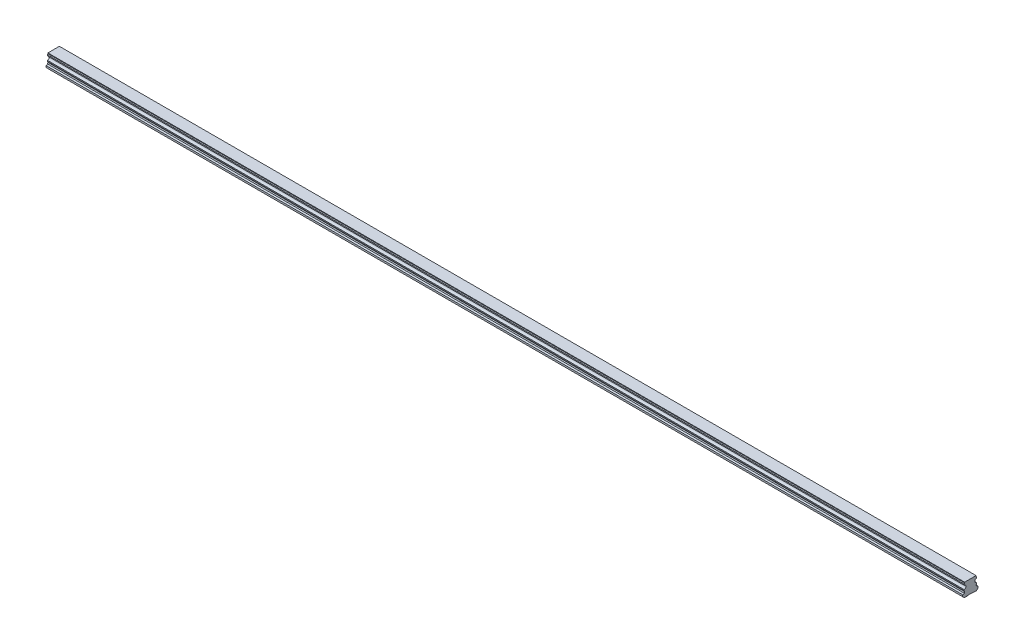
ISO-10303-21;
HEADER;
FILE_DESCRIPTION(('STEP AP214'),'2;1');
FILE_NAME('part.step','',(''),(''),'','','');
FILE_SCHEMA(('AUTOMOTIVE_DESIGN { 1 0 10303 214 1 1 1 1 }'));
ENDSEC;
DATA;
#1=APPLICATION_CONTEXT('core data for automotive mechanical design processes');
#2=APPLICATION_PROTOCOL_DEFINITION('international standard','automotive_design',2000,#1);
#3=PRODUCT_CONTEXT('',#1,'mechanical');
#4=PRODUCT('Part','Part','',(#3));
#5=PRODUCT_RELATED_PRODUCT_CATEGORY('part','',(#4));
#6=PRODUCT_DEFINITION_FORMATION('','',#4);
#7=PRODUCT_DEFINITION_CONTEXT('part definition',#1,'design');
#8=PRODUCT_DEFINITION('design','',#6,#7);
#9=PRODUCT_DEFINITION_SHAPE('','',#8);
#10=(LENGTH_UNIT() NAMED_UNIT(*) SI_UNIT(.MILLI.,.METRE.));
#11=(NAMED_UNIT(*) PLANE_ANGLE_UNIT() SI_UNIT($,.RADIAN.));
#12=(NAMED_UNIT(*) SI_UNIT($,.STERADIAN.) SOLID_ANGLE_UNIT());
#13=UNCERTAINTY_MEASURE_WITH_UNIT(LENGTH_MEASURE(1.E-05),#10,'distance_accuracy_value','');
#14=(GEOMETRIC_REPRESENTATION_CONTEXT(3) GLOBAL_UNCERTAINTY_ASSIGNED_CONTEXT((#13)) GLOBAL_UNIT_ASSIGNED_CONTEXT((#10,
#11,#12)) REPRESENTATION_CONTEXT('',''));
#15=CARTESIAN_POINT('',(0.,0.,0.));
#16=DIRECTION('',(0.,0.,1.));
#17=DIRECTION('',(1.,0.,0.));
#18=AXIS2_PLACEMENT_3D('',#15,#16,#17);
#19=CARTESIAN_POINT('',(1470.,0.499999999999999,0.));
#20=DIRECTION('',(0.,-1.,0.));
#21=DIRECTION('',(0.,0.,-1.));
#22=AXIS2_PLACEMENT_3D('',#19,#20,#21);
#23=CONICAL_SURFACE('',#22,3.5,0.785398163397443);
#24=CARTESIAN_POINT('',(1470.,1.00000000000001,0.));
#25=DIRECTION('',(0.,1.,0.));
#26=DIRECTION('',(0.,0.,1.));
#27=AXIS2_PLACEMENT_3D('',#24,#25,#26);
#28=CIRCLE('',#27,3.);
#29=CARTESIAN_POINT('',(1470.,1.00000000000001,3.));
#30=VERTEX_POINT('',#29);
#31=EDGE_CURVE('E11',#30,#30,#28,.F.);
#32=ORIENTED_EDGE('',*,*,#31,.F.);
#33=EDGE_LOOP('',(#32));
#34=FACE_BOUND('',#33,.T.);
#35=CARTESIAN_POINT('',(1470.,0.499999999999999,0.));
#36=DIRECTION('',(0.,1.,0.));
#37=DIRECTION('',(0.,0.,1.));
#38=AXIS2_PLACEMENT_3D('',#35,#36,#37);
#39=CIRCLE('',#38,3.5);
#40=CARTESIAN_POINT('',(1470.,0.5,3.5));
#41=VERTEX_POINT('',#40);
#42=EDGE_CURVE('E699',#41,#41,#39,.T.);
#43=ORIENTED_EDGE('',*,*,#42,.F.);
#44=EDGE_LOOP('',(#43));
#45=FACE_BOUND('',#44,.T.);
#46=ADVANCED_FACE('F39',(#34,#45),#23,.F.);
#47=CARTESIAN_POINT('',(1470.,12.,0.));
#48=DIRECTION('',(0.,-1.,0.));
#49=DIRECTION('',(0.,0.,-1.));
#50=AXIS2_PLACEMENT_3D('',#47,#48,#49);
#51=CYLINDRICAL_SURFACE('',#50,3.);
#52=ORIENTED_EDGE('',*,*,#31,.T.);
#53=EDGE_LOOP('',(#52));
#54=FACE_BOUND('',#53,.T.);
#55=CARTESIAN_POINT('',(1470.,12.,0.));
#56=DIRECTION('',(0.,-1.,0.));
#57=DIRECTION('',(0.,0.,-1.));
#58=AXIS2_PLACEMENT_3D('',#55,#56,#57);
#59=CIRCLE('',#58,3.);
#60=CARTESIAN_POINT('',(1470.,12.,-3.));
#61=VERTEX_POINT('',#60);
#62=EDGE_CURVE('E49',#61,#61,#59,.T.);
#63=ORIENTED_EDGE('',*,*,#62,.F.);
#64=EDGE_LOOP('',(#63));
#65=FACE_BOUND('',#64,.T.);
#66=ADVANCED_FACE('F969',(#54,#65),#51,.F.);
#67=CARTESIAN_POINT('',(1470.,12.,0.));
#68=DIRECTION('',(0.,-1.,0.));
#69=DIRECTION('',(0.,0.,-1.));
#70=AXIS2_PLACEMENT_3D('',#67,#68,#69);
#71=PLANE('',#70);
#72=CARTESIAN_POINT('',(1470.,12.,0.));
#73=DIRECTION('',(0.,-1.,0.));
#74=DIRECTION('',(0.,0.,-1.));
#75=AXIS2_PLACEMENT_3D('',#72,#73,#74);
#76=CIRCLE('',#75,2.5);
#77=CARTESIAN_POINT('',(1470.,12.,-2.5));
#78=VERTEX_POINT('',#77);
#79=EDGE_CURVE('E42',#78,#78,#76,.T.);
#80=ORIENTED_EDGE('',*,*,#79,.F.);
#81=EDGE_LOOP('',(#80));
#82=FACE_BOUND('',#81,.T.);
#83=ORIENTED_EDGE('',*,*,#62,.T.);
#84=EDGE_LOOP('',(#83));
#85=FACE_BOUND('',#84,.T.);
#86=ADVANCED_FACE('F974',(#82,#85),#71,.T.);
#87=CARTESIAN_POINT('',(1410.,0.499999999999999,0.));
#88=DIRECTION('',(0.,-1.,0.));
#89=DIRECTION('',(0.,0.,-1.));
#90=AXIS2_PLACEMENT_3D('',#87,#88,#89);
#91=CONICAL_SURFACE('',#90,3.5,0.785398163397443);
#92=CARTESIAN_POINT('',(1410.,1.00000000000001,0.));
#93=DIRECTION('',(0.,1.,0.));
#94=DIRECTION('',(0.,0.,1.));
#95=AXIS2_PLACEMENT_3D('',#92,#93,#94);
#96=CIRCLE('',#95,3.);
#97=CARTESIAN_POINT('',(1410.,1.00000000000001,3.));
#98=VERTEX_POINT('',#97);
#99=EDGE_CURVE('E695',#98,#98,#96,.F.);
#100=ORIENTED_EDGE('',*,*,#99,.F.);
#101=EDGE_LOOP('',(#100));
#102=FACE_BOUND('',#101,.T.);
#103=CARTESIAN_POINT('',(1410.,0.499999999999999,0.));
#104=DIRECTION('',(0.,1.,0.));
#105=DIRECTION('',(0.,0.,1.));
#106=AXIS2_PLACEMENT_3D('',#103,#104,#105);
#107=CIRCLE('',#106,3.5);
#108=CARTESIAN_POINT('',(1410.,0.5,3.5));
#109=VERTEX_POINT('',#108);
#110=EDGE_CURVE('E687',#109,#109,#107,.T.);
#111=ORIENTED_EDGE('',*,*,#110,.F.);
#112=EDGE_LOOP('',(#111));
#113=FACE_BOUND('',#112,.T.);
#114=ADVANCED_FACE('F1313',(#102,#113),#91,.F.);
#115=CARTESIAN_POINT('',(1410.,12.,0.));
#116=DIRECTION('',(0.,-1.,0.));
#117=DIRECTION('',(0.,0.,-1.));
#118=AXIS2_PLACEMENT_3D('',#115,#116,#117);
#119=CYLINDRICAL_SURFACE('',#118,3.);
#120=ORIENTED_EDGE('',*,*,#99,.T.);
#121=EDGE_LOOP('',(#120));
#122=FACE_BOUND('',#121,.T.);
#123=CARTESIAN_POINT('',(1410.,12.,0.));
#124=DIRECTION('',(0.,-1.,0.));
#125=DIRECTION('',(0.,0.,-1.));
#126=AXIS2_PLACEMENT_3D('',#123,#124,#125);
#127=CIRCLE('',#126,3.);
#128=CARTESIAN_POINT('',(1410.,12.,-3.));
#129=VERTEX_POINT('',#128);
#130=EDGE_CURVE('E691',#129,#129,#127,.T.);
#131=ORIENTED_EDGE('',*,*,#130,.F.);
#132=EDGE_LOOP('',(#131));
#133=FACE_BOUND('',#132,.T.);
#134=ADVANCED_FACE('F1309',(#122,#133),#119,.F.);
#135=CARTESIAN_POINT('',(1410.,12.,0.));
#136=DIRECTION('',(0.,-1.,0.));
#137=DIRECTION('',(0.,0.,-1.));
#138=AXIS2_PLACEMENT_3D('',#135,#136,#137);
#139=PLANE('',#138);
#140=CARTESIAN_POINT('',(1410.,12.,0.));
#141=DIRECTION('',(0.,-1.,0.));
#142=DIRECTION('',(0.,0.,-1.));
#143=AXIS2_PLACEMENT_3D('',#140,#141,#142);
#144=CIRCLE('',#143,2.5);
#145=CARTESIAN_POINT('',(1410.,12.,-2.5));
#146=VERTEX_POINT('',#145);
#147=EDGE_CURVE('E794',#146,#146,#144,.T.);
#148=ORIENTED_EDGE('',*,*,#147,.F.);
#149=EDGE_LOOP('',(#148));
#150=FACE_BOUND('',#149,.T.);
#151=ORIENTED_EDGE('',*,*,#130,.T.);
#152=EDGE_LOOP('',(#151));
#153=FACE_BOUND('',#152,.T.);
#154=ADVANCED_FACE('F1305',(#150,#153),#139,.T.);
#155=CARTESIAN_POINT('',(1350.,0.499999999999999,0.));
#156=DIRECTION('',(0.,-1.,0.));
#157=DIRECTION('',(0.,0.,-1.));
#158=AXIS2_PLACEMENT_3D('',#155,#156,#157);
#159=CONICAL_SURFACE('',#158,3.5,0.785398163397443);
#160=CARTESIAN_POINT('',(1350.,1.00000000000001,0.));
#161=DIRECTION('',(0.,1.,0.));
#162=DIRECTION('',(0.,0.,1.));
#163=AXIS2_PLACEMENT_3D('',#160,#161,#162);
#164=CIRCLE('',#163,3.);
#165=CARTESIAN_POINT('',(1350.,1.00000000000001,3.));
#166=VERTEX_POINT('',#165);
#167=EDGE_CURVE('E683',#166,#166,#164,.F.);
#168=ORIENTED_EDGE('',*,*,#167,.F.);
#169=EDGE_LOOP('',(#168));
#170=FACE_BOUND('',#169,.T.);
#171=CARTESIAN_POINT('',(1350.,0.499999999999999,0.));
#172=DIRECTION('',(0.,1.,0.));
#173=DIRECTION('',(0.,0.,1.));
#174=AXIS2_PLACEMENT_3D('',#171,#172,#173);
#175=CIRCLE('',#174,3.5);
#176=CARTESIAN_POINT('',(1350.,0.5,3.5));
#177=VERTEX_POINT('',#176);
#178=EDGE_CURVE('E675',#177,#177,#175,.T.);
#179=ORIENTED_EDGE('',*,*,#178,.F.);
#180=EDGE_LOOP('',(#179));
#181=FACE_BOUND('',#180,.T.);
#182=ADVANCED_FACE('F1301',(#170,#181),#159,.F.);
#183=CARTESIAN_POINT('',(1350.,12.,0.));
#184=DIRECTION('',(0.,-1.,0.));
#185=DIRECTION('',(0.,0.,-1.));
#186=AXIS2_PLACEMENT_3D('',#183,#184,#185);
#187=CYLINDRICAL_SURFACE('',#186,3.);
#188=ORIENTED_EDGE('',*,*,#167,.T.);
#189=EDGE_LOOP('',(#188));
#190=FACE_BOUND('',#189,.T.);
#191=CARTESIAN_POINT('',(1350.,12.,0.));
#192=DIRECTION('',(0.,-1.,0.));
#193=DIRECTION('',(0.,0.,-1.));
#194=AXIS2_PLACEMENT_3D('',#191,#192,#193);
#195=CIRCLE('',#194,3.);
#196=CARTESIAN_POINT('',(1350.,12.,-3.));
#197=VERTEX_POINT('',#196);
#198=EDGE_CURVE('E679',#197,#197,#195,.T.);
#199=ORIENTED_EDGE('',*,*,#198,.F.);
#200=EDGE_LOOP('',(#199));
#201=FACE_BOUND('',#200,.T.);
#202=ADVANCED_FACE('F1297',(#190,#201),#187,.F.);
#203=CARTESIAN_POINT('',(1350.,12.,0.));
#204=DIRECTION('',(0.,-1.,0.));
#205=DIRECTION('',(0.,0.,-1.));
#206=AXIS2_PLACEMENT_3D('',#203,#204,#205);
#207=PLANE('',#206);
#208=CARTESIAN_POINT('',(1350.,12.,0.));
#209=DIRECTION('',(0.,-1.,0.));
#210=DIRECTION('',(0.,0.,-1.));
#211=AXIS2_PLACEMENT_3D('',#208,#209,#210);
#212=CIRCLE('',#211,2.5);
#213=CARTESIAN_POINT('',(1350.,12.,-2.5));
#214=VERTEX_POINT('',#213);
#215=EDGE_CURVE('E791',#214,#214,#212,.T.);
#216=ORIENTED_EDGE('',*,*,#215,.F.);
#217=EDGE_LOOP('',(#216));
#218=FACE_BOUND('',#217,.T.);
#219=ORIENTED_EDGE('',*,*,#198,.T.);
#220=EDGE_LOOP('',(#219));
#221=FACE_BOUND('',#220,.T.);
#222=ADVANCED_FACE('F1293',(#218,#221),#207,.T.);
#223=CARTESIAN_POINT('',(1290.,0.499999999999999,0.));
#224=DIRECTION('',(0.,-1.,0.));
#225=DIRECTION('',(0.,0.,-1.));
#226=AXIS2_PLACEMENT_3D('',#223,#224,#225);
#227=CONICAL_SURFACE('',#226,3.5,0.785398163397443);
#228=CARTESIAN_POINT('',(1290.,1.00000000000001,0.));
#229=DIRECTION('',(0.,1.,0.));
#230=DIRECTION('',(0.,0.,1.));
#231=AXIS2_PLACEMENT_3D('',#228,#229,#230);
#232=CIRCLE('',#231,3.);
#233=CARTESIAN_POINT('',(1290.,1.00000000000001,3.));
#234=VERTEX_POINT('',#233);
#235=EDGE_CURVE('E671',#234,#234,#232,.F.);
#236=ORIENTED_EDGE('',*,*,#235,.F.);
#237=EDGE_LOOP('',(#236));
#238=FACE_BOUND('',#237,.T.);
#239=CARTESIAN_POINT('',(1290.,0.499999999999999,0.));
#240=DIRECTION('',(0.,1.,0.));
#241=DIRECTION('',(0.,0.,1.));
#242=AXIS2_PLACEMENT_3D('',#239,#240,#241);
#243=CIRCLE('',#242,3.5);
#244=CARTESIAN_POINT('',(1290.,0.5,3.5));
#245=VERTEX_POINT('',#244);
#246=EDGE_CURVE('E663',#245,#245,#243,.T.);
#247=ORIENTED_EDGE('',*,*,#246,.F.);
#248=EDGE_LOOP('',(#247));
#249=FACE_BOUND('',#248,.T.);
#250=ADVANCED_FACE('F1289',(#238,#249),#227,.F.);
#251=CARTESIAN_POINT('',(1290.,12.,0.));
#252=DIRECTION('',(0.,-1.,0.));
#253=DIRECTION('',(0.,0.,-1.));
#254=AXIS2_PLACEMENT_3D('',#251,#252,#253);
#255=CYLINDRICAL_SURFACE('',#254,3.);
#256=ORIENTED_EDGE('',*,*,#235,.T.);
#257=EDGE_LOOP('',(#256));
#258=FACE_BOUND('',#257,.T.);
#259=CARTESIAN_POINT('',(1290.,12.,0.));
#260=DIRECTION('',(0.,-1.,0.));
#261=DIRECTION('',(0.,0.,-1.));
#262=AXIS2_PLACEMENT_3D('',#259,#260,#261);
#263=CIRCLE('',#262,3.);
#264=CARTESIAN_POINT('',(1290.,12.,-3.));
#265=VERTEX_POINT('',#264);
#266=EDGE_CURVE('E667',#265,#265,#263,.T.);
#267=ORIENTED_EDGE('',*,*,#266,.F.);
#268=EDGE_LOOP('',(#267));
#269=FACE_BOUND('',#268,.T.);
#270=ADVANCED_FACE('F1285',(#258,#269),#255,.F.);
#271=CARTESIAN_POINT('',(1290.,12.,0.));
#272=DIRECTION('',(0.,-1.,0.));
#273=DIRECTION('',(0.,0.,-1.));
#274=AXIS2_PLACEMENT_3D('',#271,#272,#273);
#275=PLANE('',#274);
#276=CARTESIAN_POINT('',(1290.,12.,0.));
#277=DIRECTION('',(0.,-1.,0.));
#278=DIRECTION('',(0.,0.,-1.));
#279=AXIS2_PLACEMENT_3D('',#276,#277,#278);
#280=CIRCLE('',#279,2.5);
#281=CARTESIAN_POINT('',(1290.,12.,-2.5));
#282=VERTEX_POINT('',#281);
#283=EDGE_CURVE('E787',#282,#282,#280,.T.);
#284=ORIENTED_EDGE('',*,*,#283,.F.);
#285=EDGE_LOOP('',(#284));
#286=FACE_BOUND('',#285,.T.);
#287=ORIENTED_EDGE('',*,*,#266,.T.);
#288=EDGE_LOOP('',(#287));
#289=FACE_BOUND('',#288,.T.);
#290=ADVANCED_FACE('F1281',(#286,#289),#275,.T.);
#291=CARTESIAN_POINT('',(1230.,0.499999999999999,0.));
#292=DIRECTION('',(0.,-1.,0.));
#293=DIRECTION('',(0.,0.,-1.));
#294=AXIS2_PLACEMENT_3D('',#291,#292,#293);
#295=CONICAL_SURFACE('',#294,3.5,0.785398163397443);
#296=CARTESIAN_POINT('',(1230.,1.00000000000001,0.));
#297=DIRECTION('',(0.,1.,0.));
#298=DIRECTION('',(0.,0.,1.));
#299=AXIS2_PLACEMENT_3D('',#296,#297,#298);
#300=CIRCLE('',#299,3.);
#301=CARTESIAN_POINT('',(1230.,1.00000000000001,3.));
#302=VERTEX_POINT('',#301);
#303=EDGE_CURVE('E659',#302,#302,#300,.F.);
#304=ORIENTED_EDGE('',*,*,#303,.F.);
#305=EDGE_LOOP('',(#304));
#306=FACE_BOUND('',#305,.T.);
#307=CARTESIAN_POINT('',(1230.,0.499999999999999,0.));
#308=DIRECTION('',(0.,1.,0.));
#309=DIRECTION('',(0.,0.,1.));
#310=AXIS2_PLACEMENT_3D('',#307,#308,#309);
#311=CIRCLE('',#310,3.5);
#312=CARTESIAN_POINT('',(1230.,0.5,3.5));
#313=VERTEX_POINT('',#312);
#314=EDGE_CURVE('E651',#313,#313,#311,.T.);
#315=ORIENTED_EDGE('',*,*,#314,.F.);
#316=EDGE_LOOP('',(#315));
#317=FACE_BOUND('',#316,.T.);
#318=ADVANCED_FACE('F1277',(#306,#317),#295,.F.);
#319=CARTESIAN_POINT('',(1230.,12.,0.));
#320=DIRECTION('',(0.,-1.,0.));
#321=DIRECTION('',(0.,0.,-1.));
#322=AXIS2_PLACEMENT_3D('',#319,#320,#321);
#323=CYLINDRICAL_SURFACE('',#322,3.);
#324=ORIENTED_EDGE('',*,*,#303,.T.);
#325=EDGE_LOOP('',(#324));
#326=FACE_BOUND('',#325,.T.);
#327=CARTESIAN_POINT('',(1230.,12.,0.));
#328=DIRECTION('',(0.,-1.,0.));
#329=DIRECTION('',(0.,0.,-1.));
#330=AXIS2_PLACEMENT_3D('',#327,#328,#329);
#331=CIRCLE('',#330,3.);
#332=CARTESIAN_POINT('',(1230.,12.,-3.));
#333=VERTEX_POINT('',#332);
#334=EDGE_CURVE('E655',#333,#333,#331,.T.);
#335=ORIENTED_EDGE('',*,*,#334,.F.);
#336=EDGE_LOOP('',(#335));
#337=FACE_BOUND('',#336,.T.);
#338=ADVANCED_FACE('F1273',(#326,#337),#323,.F.);
#339=CARTESIAN_POINT('',(1230.,12.,0.));
#340=DIRECTION('',(0.,-1.,0.));
#341=DIRECTION('',(0.,0.,-1.));
#342=AXIS2_PLACEMENT_3D('',#339,#340,#341);
#343=PLANE('',#342);
#344=CARTESIAN_POINT('',(1230.,12.,0.));
#345=DIRECTION('',(0.,-1.,0.));
#346=DIRECTION('',(0.,0.,-1.));
#347=AXIS2_PLACEMENT_3D('',#344,#345,#346);
#348=CIRCLE('',#347,2.5);
#349=CARTESIAN_POINT('',(1230.,12.,-2.5));
#350=VERTEX_POINT('',#349);
#351=EDGE_CURVE('E783',#350,#350,#348,.T.);
#352=ORIENTED_EDGE('',*,*,#351,.F.);
#353=EDGE_LOOP('',(#352));
#354=FACE_BOUND('',#353,.T.);
#355=ORIENTED_EDGE('',*,*,#334,.T.);
#356=EDGE_LOOP('',(#355));
#357=FACE_BOUND('',#356,.T.);
#358=ADVANCED_FACE('F1269',(#354,#357),#343,.T.);
#359=CARTESIAN_POINT('',(1170.,0.499999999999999,0.));
#360=DIRECTION('',(0.,-1.,0.));
#361=DIRECTION('',(0.,0.,-1.));
#362=AXIS2_PLACEMENT_3D('',#359,#360,#361);
#363=CONICAL_SURFACE('',#362,3.5,0.785398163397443);
#364=CARTESIAN_POINT('',(1170.,1.00000000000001,0.));
#365=DIRECTION('',(0.,1.,0.));
#366=DIRECTION('',(0.,0.,1.));
#367=AXIS2_PLACEMENT_3D('',#364,#365,#366);
#368=CIRCLE('',#367,3.);
#369=CARTESIAN_POINT('',(1170.,1.00000000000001,3.));
#370=VERTEX_POINT('',#369);
#371=EDGE_CURVE('E647',#370,#370,#368,.F.);
#372=ORIENTED_EDGE('',*,*,#371,.F.);
#373=EDGE_LOOP('',(#372));
#374=FACE_BOUND('',#373,.T.);
#375=CARTESIAN_POINT('',(1170.,0.499999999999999,0.));
#376=DIRECTION('',(0.,1.,0.));
#377=DIRECTION('',(0.,0.,1.));
#378=AXIS2_PLACEMENT_3D('',#375,#376,#377);
#379=CIRCLE('',#378,3.5);
#380=CARTESIAN_POINT('',(1170.,0.5,3.5));
#381=VERTEX_POINT('',#380);
#382=EDGE_CURVE('E639',#381,#381,#379,.T.);
#383=ORIENTED_EDGE('',*,*,#382,.F.);
#384=EDGE_LOOP('',(#383));
#385=FACE_BOUND('',#384,.T.);
#386=ADVANCED_FACE('F1265',(#374,#385),#363,.F.);
#387=CARTESIAN_POINT('',(1170.,12.,0.));
#388=DIRECTION('',(0.,-1.,0.));
#389=DIRECTION('',(0.,0.,-1.));
#390=AXIS2_PLACEMENT_3D('',#387,#388,#389);
#391=CYLINDRICAL_SURFACE('',#390,3.);
#392=ORIENTED_EDGE('',*,*,#371,.T.);
#393=EDGE_LOOP('',(#392));
#394=FACE_BOUND('',#393,.T.);
#395=CARTESIAN_POINT('',(1170.,12.,0.));
#396=DIRECTION('',(0.,-1.,0.));
#397=DIRECTION('',(0.,0.,-1.));
#398=AXIS2_PLACEMENT_3D('',#395,#396,#397);
#399=CIRCLE('',#398,3.);
#400=CARTESIAN_POINT('',(1170.,12.,-3.));
#401=VERTEX_POINT('',#400);
#402=EDGE_CURVE('E643',#401,#401,#399,.T.);
#403=ORIENTED_EDGE('',*,*,#402,.F.);
#404=EDGE_LOOP('',(#403));
#405=FACE_BOUND('',#404,.T.);
#406=ADVANCED_FACE('F1261',(#394,#405),#391,.F.);
#407=CARTESIAN_POINT('',(1170.,12.,0.));
#408=DIRECTION('',(0.,-1.,0.));
#409=DIRECTION('',(0.,0.,-1.));
#410=AXIS2_PLACEMENT_3D('',#407,#408,#409);
#411=PLANE('',#410);
#412=CARTESIAN_POINT('',(1170.,12.,0.));
#413=DIRECTION('',(0.,-1.,0.));
#414=DIRECTION('',(0.,0.,-1.));
#415=AXIS2_PLACEMENT_3D('',#412,#413,#414);
#416=CIRCLE('',#415,2.5);
#417=CARTESIAN_POINT('',(1170.,12.,-2.5));
#418=VERTEX_POINT('',#417);
#419=EDGE_CURVE('E779',#418,#418,#416,.T.);
#420=ORIENTED_EDGE('',*,*,#419,.F.);
#421=EDGE_LOOP('',(#420));
#422=FACE_BOUND('',#421,.T.);
#423=ORIENTED_EDGE('',*,*,#402,.T.);
#424=EDGE_LOOP('',(#423));
#425=FACE_BOUND('',#424,.T.);
#426=ADVANCED_FACE('F1257',(#422,#425),#411,.T.);
#427=CARTESIAN_POINT('',(1110.,0.499999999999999,0.));
#428=DIRECTION('',(0.,-1.,0.));
#429=DIRECTION('',(0.,0.,-1.));
#430=AXIS2_PLACEMENT_3D('',#427,#428,#429);
#431=CONICAL_SURFACE('',#430,3.5,0.785398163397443);
#432=CARTESIAN_POINT('',(1110.,1.00000000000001,0.));
#433=DIRECTION('',(0.,1.,0.));
#434=DIRECTION('',(0.,0.,1.));
#435=AXIS2_PLACEMENT_3D('',#432,#433,#434);
#436=CIRCLE('',#435,3.);
#437=CARTESIAN_POINT('',(1110.,1.00000000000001,3.));
#438=VERTEX_POINT('',#437);
#439=EDGE_CURVE('E635',#438,#438,#436,.F.);
#440=ORIENTED_EDGE('',*,*,#439,.F.);
#441=EDGE_LOOP('',(#440));
#442=FACE_BOUND('',#441,.T.);
#443=CARTESIAN_POINT('',(1110.,0.499999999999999,0.));
#444=DIRECTION('',(0.,1.,0.));
#445=DIRECTION('',(0.,0.,1.));
#446=AXIS2_PLACEMENT_3D('',#443,#444,#445);
#447=CIRCLE('',#446,3.5);
#448=CARTESIAN_POINT('',(1110.,0.5,3.5));
#449=VERTEX_POINT('',#448);
#450=EDGE_CURVE('E627',#449,#449,#447,.T.);
#451=ORIENTED_EDGE('',*,*,#450,.F.);
#452=EDGE_LOOP('',(#451));
#453=FACE_BOUND('',#452,.T.);
#454=ADVANCED_FACE('F1253',(#442,#453),#431,.F.);
#455=CARTESIAN_POINT('',(1110.,12.,0.));
#456=DIRECTION('',(0.,-1.,0.));
#457=DIRECTION('',(0.,0.,-1.));
#458=AXIS2_PLACEMENT_3D('',#455,#456,#457);
#459=CYLINDRICAL_SURFACE('',#458,3.);
#460=ORIENTED_EDGE('',*,*,#439,.T.);
#461=EDGE_LOOP('',(#460));
#462=FACE_BOUND('',#461,.T.);
#463=CARTESIAN_POINT('',(1110.,12.,0.));
#464=DIRECTION('',(0.,-1.,0.));
#465=DIRECTION('',(0.,0.,-1.));
#466=AXIS2_PLACEMENT_3D('',#463,#464,#465);
#467=CIRCLE('',#466,3.);
#468=CARTESIAN_POINT('',(1110.,12.,-3.));
#469=VERTEX_POINT('',#468);
#470=EDGE_CURVE('E631',#469,#469,#467,.T.);
#471=ORIENTED_EDGE('',*,*,#470,.F.);
#472=EDGE_LOOP('',(#471));
#473=FACE_BOUND('',#472,.T.);
#474=ADVANCED_FACE('F1249',(#462,#473),#459,.F.);
#475=CARTESIAN_POINT('',(1110.,12.,0.));
#476=DIRECTION('',(0.,-1.,0.));
#477=DIRECTION('',(0.,0.,-1.));
#478=AXIS2_PLACEMENT_3D('',#475,#476,#477);
#479=PLANE('',#478);
#480=CARTESIAN_POINT('',(1110.,12.,0.));
#481=DIRECTION('',(0.,-1.,0.));
#482=DIRECTION('',(0.,0.,-1.));
#483=AXIS2_PLACEMENT_3D('',#480,#481,#482);
#484=CIRCLE('',#483,2.5);
#485=CARTESIAN_POINT('',(1110.,12.,-2.5));
#486=VERTEX_POINT('',#485);
#487=EDGE_CURVE('E775',#486,#486,#484,.T.);
#488=ORIENTED_EDGE('',*,*,#487,.F.);
#489=EDGE_LOOP('',(#488));
#490=FACE_BOUND('',#489,.T.);
#491=ORIENTED_EDGE('',*,*,#470,.T.);
#492=EDGE_LOOP('',(#491));
#493=FACE_BOUND('',#492,.T.);
#494=ADVANCED_FACE('F1245',(#490,#493),#479,.T.);
#495=CARTESIAN_POINT('',(1050.,0.499999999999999,0.));
#496=DIRECTION('',(0.,-1.,0.));
#497=DIRECTION('',(0.,0.,-1.));
#498=AXIS2_PLACEMENT_3D('',#495,#496,#497);
#499=CONICAL_SURFACE('',#498,3.5,0.785398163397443);
#500=CARTESIAN_POINT('',(1050.,1.00000000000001,0.));
#501=DIRECTION('',(0.,1.,0.));
#502=DIRECTION('',(0.,0.,1.));
#503=AXIS2_PLACEMENT_3D('',#500,#501,#502);
#504=CIRCLE('',#503,3.);
#505=CARTESIAN_POINT('',(1050.,1.00000000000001,3.));
#506=VERTEX_POINT('',#505);
#507=EDGE_CURVE('E623',#506,#506,#504,.F.);
#508=ORIENTED_EDGE('',*,*,#507,.F.);
#509=EDGE_LOOP('',(#508));
#510=FACE_BOUND('',#509,.T.);
#511=CARTESIAN_POINT('',(1050.,0.499999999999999,0.));
#512=DIRECTION('',(0.,1.,0.));
#513=DIRECTION('',(0.,0.,1.));
#514=AXIS2_PLACEMENT_3D('',#511,#512,#513);
#515=CIRCLE('',#514,3.5);
#516=CARTESIAN_POINT('',(1050.,0.5,3.5));
#517=VERTEX_POINT('',#516);
#518=EDGE_CURVE('E615',#517,#517,#515,.T.);
#519=ORIENTED_EDGE('',*,*,#518,.F.);
#520=EDGE_LOOP('',(#519));
#521=FACE_BOUND('',#520,.T.);
#522=ADVANCED_FACE('F1241',(#510,#521),#499,.F.);
#523=CARTESIAN_POINT('',(1050.,12.,0.));
#524=DIRECTION('',(0.,-1.,0.));
#525=DIRECTION('',(0.,0.,-1.));
#526=AXIS2_PLACEMENT_3D('',#523,#524,#525);
#527=CYLINDRICAL_SURFACE('',#526,3.);
#528=ORIENTED_EDGE('',*,*,#507,.T.);
#529=EDGE_LOOP('',(#528));
#530=FACE_BOUND('',#529,.T.);
#531=CARTESIAN_POINT('',(1050.,12.,0.));
#532=DIRECTION('',(0.,-1.,0.));
#533=DIRECTION('',(0.,0.,-1.));
#534=AXIS2_PLACEMENT_3D('',#531,#532,#533);
#535=CIRCLE('',#534,3.);
#536=CARTESIAN_POINT('',(1050.,12.,-3.));
#537=VERTEX_POINT('',#536);
#538=EDGE_CURVE('E619',#537,#537,#535,.T.);
#539=ORIENTED_EDGE('',*,*,#538,.F.);
#540=EDGE_LOOP('',(#539));
#541=FACE_BOUND('',#540,.T.);
#542=ADVANCED_FACE('F1237',(#530,#541),#527,.F.);
#543=CARTESIAN_POINT('',(1050.,12.,0.));
#544=DIRECTION('',(0.,-1.,0.));
#545=DIRECTION('',(0.,0.,-1.));
#546=AXIS2_PLACEMENT_3D('',#543,#544,#545);
#547=PLANE('',#546);
#548=CARTESIAN_POINT('',(1050.,12.,0.));
#549=DIRECTION('',(0.,-1.,0.));
#550=DIRECTION('',(0.,0.,-1.));
#551=AXIS2_PLACEMENT_3D('',#548,#549,#550);
#552=CIRCLE('',#551,2.5);
#553=CARTESIAN_POINT('',(1050.,12.,-2.5));
#554=VERTEX_POINT('',#553);
#555=EDGE_CURVE('E771',#554,#554,#552,.T.);
#556=ORIENTED_EDGE('',*,*,#555,.F.);
#557=EDGE_LOOP('',(#556));
#558=FACE_BOUND('',#557,.T.);
#559=ORIENTED_EDGE('',*,*,#538,.T.);
#560=EDGE_LOOP('',(#559));
#561=FACE_BOUND('',#560,.T.);
#562=ADVANCED_FACE('F1233',(#558,#561),#547,.T.);
#563=CARTESIAN_POINT('',(990.,0.499999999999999,0.));
#564=DIRECTION('',(0.,-1.,0.));
#565=DIRECTION('',(0.,0.,-1.));
#566=AXIS2_PLACEMENT_3D('',#563,#564,#565);
#567=CONICAL_SURFACE('',#566,3.5,0.785398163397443);
#568=CARTESIAN_POINT('',(990.,1.00000000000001,0.));
#569=DIRECTION('',(0.,1.,0.));
#570=DIRECTION('',(0.,0.,1.));
#571=AXIS2_PLACEMENT_3D('',#568,#569,#570);
#572=CIRCLE('',#571,3.);
#573=CARTESIAN_POINT('',(990.,1.00000000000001,3.));
#574=VERTEX_POINT('',#573);
#575=EDGE_CURVE('E611',#574,#574,#572,.F.);
#576=ORIENTED_EDGE('',*,*,#575,.F.);
#577=EDGE_LOOP('',(#576));
#578=FACE_BOUND('',#577,.T.);
#579=CARTESIAN_POINT('',(990.,0.499999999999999,0.));
#580=DIRECTION('',(0.,1.,0.));
#581=DIRECTION('',(0.,0.,1.));
#582=AXIS2_PLACEMENT_3D('',#579,#580,#581);
#583=CIRCLE('',#582,3.5);
#584=CARTESIAN_POINT('',(990.,0.5,3.5));
#585=VERTEX_POINT('',#584);
#586=EDGE_CURVE('E603',#585,#585,#583,.T.);
#587=ORIENTED_EDGE('',*,*,#586,.F.);
#588=EDGE_LOOP('',(#587));
#589=FACE_BOUND('',#588,.T.);
#590=ADVANCED_FACE('F1229',(#578,#589),#567,.F.);
#591=CARTESIAN_POINT('',(990.,12.,0.));
#592=DIRECTION('',(0.,-1.,0.));
#593=DIRECTION('',(0.,0.,-1.));
#594=AXIS2_PLACEMENT_3D('',#591,#592,#593);
#595=CYLINDRICAL_SURFACE('',#594,3.);
#596=ORIENTED_EDGE('',*,*,#575,.T.);
#597=EDGE_LOOP('',(#596));
#598=FACE_BOUND('',#597,.T.);
#599=CARTESIAN_POINT('',(990.,12.,0.));
#600=DIRECTION('',(0.,-1.,0.));
#601=DIRECTION('',(0.,0.,-1.));
#602=AXIS2_PLACEMENT_3D('',#599,#600,#601);
#603=CIRCLE('',#602,3.);
#604=CARTESIAN_POINT('',(990.,12.,-3.));
#605=VERTEX_POINT('',#604);
#606=EDGE_CURVE('E607',#605,#605,#603,.T.);
#607=ORIENTED_EDGE('',*,*,#606,.F.);
#608=EDGE_LOOP('',(#607));
#609=FACE_BOUND('',#608,.T.);
#610=ADVANCED_FACE('F1225',(#598,#609),#595,.F.);
#611=CARTESIAN_POINT('',(990.,12.,0.));
#612=DIRECTION('',(0.,-1.,0.));
#613=DIRECTION('',(0.,0.,-1.));
#614=AXIS2_PLACEMENT_3D('',#611,#612,#613);
#615=PLANE('',#614);
#616=CARTESIAN_POINT('',(990.,12.,0.));
#617=DIRECTION('',(0.,-1.,0.));
#618=DIRECTION('',(0.,0.,-1.));
#619=AXIS2_PLACEMENT_3D('',#616,#617,#618);
#620=CIRCLE('',#619,2.5);
#621=CARTESIAN_POINT('',(990.,12.,-2.5));
#622=VERTEX_POINT('',#621);
#623=EDGE_CURVE('E767',#622,#622,#620,.T.);
#624=ORIENTED_EDGE('',*,*,#623,.F.);
#625=EDGE_LOOP('',(#624));
#626=FACE_BOUND('',#625,.T.);
#627=ORIENTED_EDGE('',*,*,#606,.T.);
#628=EDGE_LOOP('',(#627));
#629=FACE_BOUND('',#628,.T.);
#630=ADVANCED_FACE('F1221',(#626,#629),#615,.T.);
#631=CARTESIAN_POINT('',(930.,0.499999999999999,0.));
#632=DIRECTION('',(0.,-1.,0.));
#633=DIRECTION('',(0.,0.,-1.));
#634=AXIS2_PLACEMENT_3D('',#631,#632,#633);
#635=CONICAL_SURFACE('',#634,3.5,0.785398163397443);
#636=CARTESIAN_POINT('',(930.,1.00000000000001,0.));
#637=DIRECTION('',(0.,1.,0.));
#638=DIRECTION('',(0.,0.,1.));
#639=AXIS2_PLACEMENT_3D('',#636,#637,#638);
#640=CIRCLE('',#639,3.);
#641=CARTESIAN_POINT('',(930.,1.00000000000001,3.));
#642=VERTEX_POINT('',#641);
#643=EDGE_CURVE('E599',#642,#642,#640,.F.);
#644=ORIENTED_EDGE('',*,*,#643,.F.);
#645=EDGE_LOOP('',(#644));
#646=FACE_BOUND('',#645,.T.);
#647=CARTESIAN_POINT('',(930.,0.499999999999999,0.));
#648=DIRECTION('',(0.,1.,0.));
#649=DIRECTION('',(0.,0.,1.));
#650=AXIS2_PLACEMENT_3D('',#647,#648,#649);
#651=CIRCLE('',#650,3.5);
#652=CARTESIAN_POINT('',(930.,0.5,3.5));
#653=VERTEX_POINT('',#652);
#654=EDGE_CURVE('E591',#653,#653,#651,.T.);
#655=ORIENTED_EDGE('',*,*,#654,.F.);
#656=EDGE_LOOP('',(#655));
#657=FACE_BOUND('',#656,.T.);
#658=ADVANCED_FACE('F1217',(#646,#657),#635,.F.);
#659=CARTESIAN_POINT('',(930.,12.,0.));
#660=DIRECTION('',(0.,-1.,0.));
#661=DIRECTION('',(0.,0.,-1.));
#662=AXIS2_PLACEMENT_3D('',#659,#660,#661);
#663=CYLINDRICAL_SURFACE('',#662,3.);
#664=ORIENTED_EDGE('',*,*,#643,.T.);
#665=EDGE_LOOP('',(#664));
#666=FACE_BOUND('',#665,.T.);
#667=CARTESIAN_POINT('',(930.,12.,0.));
#668=DIRECTION('',(0.,-1.,0.));
#669=DIRECTION('',(0.,0.,-1.));
#670=AXIS2_PLACEMENT_3D('',#667,#668,#669);
#671=CIRCLE('',#670,3.);
#672=CARTESIAN_POINT('',(930.,12.,-3.));
#673=VERTEX_POINT('',#672);
#674=EDGE_CURVE('E595',#673,#673,#671,.T.);
#675=ORIENTED_EDGE('',*,*,#674,.F.);
#676=EDGE_LOOP('',(#675));
#677=FACE_BOUND('',#676,.T.);
#678=ADVANCED_FACE('F1213',(#666,#677),#663,.F.);
#679=CARTESIAN_POINT('',(930.,12.,0.));
#680=DIRECTION('',(0.,-1.,0.));
#681=DIRECTION('',(0.,0.,-1.));
#682=AXIS2_PLACEMENT_3D('',#679,#680,#681);
#683=PLANE('',#682);
#684=CARTESIAN_POINT('',(930.,12.,0.));
#685=DIRECTION('',(0.,-1.,0.));
#686=DIRECTION('',(0.,0.,-1.));
#687=AXIS2_PLACEMENT_3D('',#684,#685,#686);
#688=CIRCLE('',#687,2.5);
#689=CARTESIAN_POINT('',(930.,12.,-2.5));
#690=VERTEX_POINT('',#689);
#691=EDGE_CURVE('E763',#690,#690,#688,.T.);
#692=ORIENTED_EDGE('',*,*,#691,.F.);
#693=EDGE_LOOP('',(#692));
#694=FACE_BOUND('',#693,.T.);
#695=ORIENTED_EDGE('',*,*,#674,.T.);
#696=EDGE_LOOP('',(#695));
#697=FACE_BOUND('',#696,.T.);
#698=ADVANCED_FACE('F1209',(#694,#697),#683,.T.);
#699=CARTESIAN_POINT('',(870.,0.499999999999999,0.));
#700=DIRECTION('',(0.,-1.,0.));
#701=DIRECTION('',(0.,0.,-1.));
#702=AXIS2_PLACEMENT_3D('',#699,#700,#701);
#703=CONICAL_SURFACE('',#702,3.5,0.785398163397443);
#704=CARTESIAN_POINT('',(870.,1.00000000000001,0.));
#705=DIRECTION('',(0.,1.,0.));
#706=DIRECTION('',(0.,0.,1.));
#707=AXIS2_PLACEMENT_3D('',#704,#705,#706);
#708=CIRCLE('',#707,3.);
#709=CARTESIAN_POINT('',(870.,1.00000000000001,3.));
#710=VERTEX_POINT('',#709);
#711=EDGE_CURVE('E587',#710,#710,#708,.F.);
#712=ORIENTED_EDGE('',*,*,#711,.F.);
#713=EDGE_LOOP('',(#712));
#714=FACE_BOUND('',#713,.T.);
#715=CARTESIAN_POINT('',(870.,0.499999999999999,0.));
#716=DIRECTION('',(0.,1.,0.));
#717=DIRECTION('',(0.,0.,1.));
#718=AXIS2_PLACEMENT_3D('',#715,#716,#717);
#719=CIRCLE('',#718,3.5);
#720=CARTESIAN_POINT('',(870.,0.5,3.5));
#721=VERTEX_POINT('',#720);
#722=EDGE_CURVE('E579',#721,#721,#719,.T.);
#723=ORIENTED_EDGE('',*,*,#722,.F.);
#724=EDGE_LOOP('',(#723));
#725=FACE_BOUND('',#724,.T.);
#726=ADVANCED_FACE('F1205',(#714,#725),#703,.F.);
#727=CARTESIAN_POINT('',(870.,12.,0.));
#728=DIRECTION('',(0.,-1.,0.));
#729=DIRECTION('',(0.,0.,-1.));
#730=AXIS2_PLACEMENT_3D('',#727,#728,#729);
#731=CYLINDRICAL_SURFACE('',#730,3.);
#732=ORIENTED_EDGE('',*,*,#711,.T.);
#733=EDGE_LOOP('',(#732));
#734=FACE_BOUND('',#733,.T.);
#735=CARTESIAN_POINT('',(870.,12.,0.));
#736=DIRECTION('',(0.,-1.,0.));
#737=DIRECTION('',(0.,0.,-1.));
#738=AXIS2_PLACEMENT_3D('',#735,#736,#737);
#739=CIRCLE('',#738,3.);
#740=CARTESIAN_POINT('',(870.,12.,-3.));
#741=VERTEX_POINT('',#740);
#742=EDGE_CURVE('E583',#741,#741,#739,.T.);
#743=ORIENTED_EDGE('',*,*,#742,.F.);
#744=EDGE_LOOP('',(#743));
#745=FACE_BOUND('',#744,.T.);
#746=ADVANCED_FACE('F1201',(#734,#745),#731,.F.);
#747=CARTESIAN_POINT('',(870.,12.,0.));
#748=DIRECTION('',(0.,-1.,0.));
#749=DIRECTION('',(0.,0.,-1.));
#750=AXIS2_PLACEMENT_3D('',#747,#748,#749);
#751=PLANE('',#750);
#752=CARTESIAN_POINT('',(870.,12.,0.));
#753=DIRECTION('',(0.,-1.,0.));
#754=DIRECTION('',(0.,0.,-1.));
#755=AXIS2_PLACEMENT_3D('',#752,#753,#754);
#756=CIRCLE('',#755,2.5);
#757=CARTESIAN_POINT('',(870.,12.,-2.5));
#758=VERTEX_POINT('',#757);
#759=EDGE_CURVE('E759',#758,#758,#756,.T.);
#760=ORIENTED_EDGE('',*,*,#759,.F.);
#761=EDGE_LOOP('',(#760));
#762=FACE_BOUND('',#761,.T.);
#763=ORIENTED_EDGE('',*,*,#742,.T.);
#764=EDGE_LOOP('',(#763));
#765=FACE_BOUND('',#764,.T.);
#766=ADVANCED_FACE('F1197',(#762,#765),#751,.T.);
#767=CARTESIAN_POINT('',(810.,0.499999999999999,0.));
#768=DIRECTION('',(0.,-1.,0.));
#769=DIRECTION('',(0.,0.,-1.));
#770=AXIS2_PLACEMENT_3D('',#767,#768,#769);
#771=CONICAL_SURFACE('',#770,3.5,0.785398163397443);
#772=CARTESIAN_POINT('',(810.,1.00000000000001,0.));
#773=DIRECTION('',(0.,1.,0.));
#774=DIRECTION('',(0.,0.,1.));
#775=AXIS2_PLACEMENT_3D('',#772,#773,#774);
#776=CIRCLE('',#775,3.);
#777=CARTESIAN_POINT('',(810.,1.00000000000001,3.));
#778=VERTEX_POINT('',#777);
#779=EDGE_CURVE('E575',#778,#778,#776,.F.);
#780=ORIENTED_EDGE('',*,*,#779,.F.);
#781=EDGE_LOOP('',(#780));
#782=FACE_BOUND('',#781,.T.);
#783=CARTESIAN_POINT('',(810.,0.499999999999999,0.));
#784=DIRECTION('',(0.,1.,0.));
#785=DIRECTION('',(0.,0.,1.));
#786=AXIS2_PLACEMENT_3D('',#783,#784,#785);
#787=CIRCLE('',#786,3.5);
#788=CARTESIAN_POINT('',(810.,0.5,3.5));
#789=VERTEX_POINT('',#788);
#790=EDGE_CURVE('E567',#789,#789,#787,.T.);
#791=ORIENTED_EDGE('',*,*,#790,.F.);
#792=EDGE_LOOP('',(#791));
#793=FACE_BOUND('',#792,.T.);
#794=ADVANCED_FACE('F1193',(#782,#793),#771,.F.);
#795=CARTESIAN_POINT('',(810.,12.,0.));
#796=DIRECTION('',(0.,-1.,0.));
#797=DIRECTION('',(0.,0.,-1.));
#798=AXIS2_PLACEMENT_3D('',#795,#796,#797);
#799=CYLINDRICAL_SURFACE('',#798,3.);
#800=ORIENTED_EDGE('',*,*,#779,.T.);
#801=EDGE_LOOP('',(#800));
#802=FACE_BOUND('',#801,.T.);
#803=CARTESIAN_POINT('',(810.,12.,0.));
#804=DIRECTION('',(0.,-1.,0.));
#805=DIRECTION('',(0.,0.,-1.));
#806=AXIS2_PLACEMENT_3D('',#803,#804,#805);
#807=CIRCLE('',#806,3.);
#808=CARTESIAN_POINT('',(810.,12.,-3.));
#809=VERTEX_POINT('',#808);
#810=EDGE_CURVE('E571',#809,#809,#807,.T.);
#811=ORIENTED_EDGE('',*,*,#810,.F.);
#812=EDGE_LOOP('',(#811));
#813=FACE_BOUND('',#812,.T.);
#814=ADVANCED_FACE('F1189',(#802,#813),#799,.F.);
#815=CARTESIAN_POINT('',(810.,12.,0.));
#816=DIRECTION('',(0.,-1.,0.));
#817=DIRECTION('',(0.,0.,-1.));
#818=AXIS2_PLACEMENT_3D('',#815,#816,#817);
#819=PLANE('',#818);
#820=CARTESIAN_POINT('',(810.,12.,0.));
#821=DIRECTION('',(0.,-1.,0.));
#822=DIRECTION('',(0.,0.,-1.));
#823=AXIS2_PLACEMENT_3D('',#820,#821,#822);
#824=CIRCLE('',#823,2.5);
#825=CARTESIAN_POINT('',(810.,12.,-2.5));
#826=VERTEX_POINT('',#825);
#827=EDGE_CURVE('E755',#826,#826,#824,.T.);
#828=ORIENTED_EDGE('',*,*,#827,.F.);
#829=EDGE_LOOP('',(#828));
#830=FACE_BOUND('',#829,.T.);
#831=ORIENTED_EDGE('',*,*,#810,.T.);
#832=EDGE_LOOP('',(#831));
#833=FACE_BOUND('',#832,.T.);
#834=ADVANCED_FACE('F1185',(#830,#833),#819,.T.);
#835=CARTESIAN_POINT('',(750.,0.499999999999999,0.));
#836=DIRECTION('',(0.,-1.,0.));
#837=DIRECTION('',(0.,0.,-1.));
#838=AXIS2_PLACEMENT_3D('',#835,#836,#837);
#839=CONICAL_SURFACE('',#838,3.5,0.785398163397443);
#840=CARTESIAN_POINT('',(750.,1.00000000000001,0.));
#841=DIRECTION('',(0.,1.,0.));
#842=DIRECTION('',(0.,0.,1.));
#843=AXIS2_PLACEMENT_3D('',#840,#841,#842);
#844=CIRCLE('',#843,3.);
#845=CARTESIAN_POINT('',(750.,1.00000000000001,3.));
#846=VERTEX_POINT('',#845);
#847=EDGE_CURVE('E563',#846,#846,#844,.F.);
#848=ORIENTED_EDGE('',*,*,#847,.F.);
#849=EDGE_LOOP('',(#848));
#850=FACE_BOUND('',#849,.T.);
#851=CARTESIAN_POINT('',(750.,0.499999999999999,0.));
#852=DIRECTION('',(0.,1.,0.));
#853=DIRECTION('',(0.,0.,1.));
#854=AXIS2_PLACEMENT_3D('',#851,#852,#853);
#855=CIRCLE('',#854,3.5);
#856=CARTESIAN_POINT('',(750.,0.5,3.5));
#857=VERTEX_POINT('',#856);
#858=EDGE_CURVE('E555',#857,#857,#855,.T.);
#859=ORIENTED_EDGE('',*,*,#858,.F.);
#860=EDGE_LOOP('',(#859));
#861=FACE_BOUND('',#860,.T.);
#862=ADVANCED_FACE('F1181',(#850,#861),#839,.F.);
#863=CARTESIAN_POINT('',(750.,12.,0.));
#864=DIRECTION('',(0.,-1.,0.));
#865=DIRECTION('',(0.,0.,-1.));
#866=AXIS2_PLACEMENT_3D('',#863,#864,#865);
#867=CYLINDRICAL_SURFACE('',#866,3.);
#868=ORIENTED_EDGE('',*,*,#847,.T.);
#869=EDGE_LOOP('',(#868));
#870=FACE_BOUND('',#869,.T.);
#871=CARTESIAN_POINT('',(750.,12.,0.));
#872=DIRECTION('',(0.,-1.,0.));
#873=DIRECTION('',(0.,0.,-1.));
#874=AXIS2_PLACEMENT_3D('',#871,#872,#873);
#875=CIRCLE('',#874,3.);
#876=CARTESIAN_POINT('',(750.,12.,-3.));
#877=VERTEX_POINT('',#876);
#878=EDGE_CURVE('E559',#877,#877,#875,.T.);
#879=ORIENTED_EDGE('',*,*,#878,.F.);
#880=EDGE_LOOP('',(#879));
#881=FACE_BOUND('',#880,.T.);
#882=ADVANCED_FACE('F1177',(#870,#881),#867,.F.);
#883=CARTESIAN_POINT('',(750.,12.,0.));
#884=DIRECTION('',(0.,-1.,0.));
#885=DIRECTION('',(0.,0.,-1.));
#886=AXIS2_PLACEMENT_3D('',#883,#884,#885);
#887=PLANE('',#886);
#888=CARTESIAN_POINT('',(750.,12.,0.));
#889=DIRECTION('',(0.,-1.,0.));
#890=DIRECTION('',(0.,0.,-1.));
#891=AXIS2_PLACEMENT_3D('',#888,#889,#890);
#892=CIRCLE('',#891,2.5);
#893=CARTESIAN_POINT('',(750.,12.,-2.5));
#894=VERTEX_POINT('',#893);
#895=EDGE_CURVE('E751',#894,#894,#892,.T.);
#896=ORIENTED_EDGE('',*,*,#895,.F.);
#897=EDGE_LOOP('',(#896));
#898=FACE_BOUND('',#897,.T.);
#899=ORIENTED_EDGE('',*,*,#878,.T.);
#900=EDGE_LOOP('',(#899));
#901=FACE_BOUND('',#900,.T.);
#902=ADVANCED_FACE('F1173',(#898,#901),#887,.T.);
#903=CARTESIAN_POINT('',(690.,0.499999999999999,0.));
#904=DIRECTION('',(0.,-1.,0.));
#905=DIRECTION('',(0.,0.,-1.));
#906=AXIS2_PLACEMENT_3D('',#903,#904,#905);
#907=CONICAL_SURFACE('',#906,3.5,0.785398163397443);
#908=CARTESIAN_POINT('',(690.,1.00000000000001,0.));
#909=DIRECTION('',(0.,1.,0.));
#910=DIRECTION('',(0.,0.,1.));
#911=AXIS2_PLACEMENT_3D('',#908,#909,#910);
#912=CIRCLE('',#911,3.);
#913=CARTESIAN_POINT('',(690.,1.00000000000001,3.));
#914=VERTEX_POINT('',#913);
#915=EDGE_CURVE('E551',#914,#914,#912,.F.);
#916=ORIENTED_EDGE('',*,*,#915,.F.);
#917=EDGE_LOOP('',(#916));
#918=FACE_BOUND('',#917,.T.);
#919=CARTESIAN_POINT('',(690.,0.499999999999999,0.));
#920=DIRECTION('',(0.,1.,0.));
#921=DIRECTION('',(0.,0.,1.));
#922=AXIS2_PLACEMENT_3D('',#919,#920,#921);
#923=CIRCLE('',#922,3.5);
#924=CARTESIAN_POINT('',(690.,0.5,3.5));
#925=VERTEX_POINT('',#924);
#926=EDGE_CURVE('E543',#925,#925,#923,.T.);
#927=ORIENTED_EDGE('',*,*,#926,.F.);
#928=EDGE_LOOP('',(#927));
#929=FACE_BOUND('',#928,.T.);
#930=ADVANCED_FACE('F1169',(#918,#929),#907,.F.);
#931=CARTESIAN_POINT('',(690.,12.,0.));
#932=DIRECTION('',(0.,-1.,0.));
#933=DIRECTION('',(0.,0.,-1.));
#934=AXIS2_PLACEMENT_3D('',#931,#932,#933);
#935=CYLINDRICAL_SURFACE('',#934,3.);
#936=ORIENTED_EDGE('',*,*,#915,.T.);
#937=EDGE_LOOP('',(#936));
#938=FACE_BOUND('',#937,.T.);
#939=CARTESIAN_POINT('',(690.,12.,0.));
#940=DIRECTION('',(0.,-1.,0.));
#941=DIRECTION('',(0.,0.,-1.));
#942=AXIS2_PLACEMENT_3D('',#939,#940,#941);
#943=CIRCLE('',#942,3.);
#944=CARTESIAN_POINT('',(690.,12.,-3.));
#945=VERTEX_POINT('',#944);
#946=EDGE_CURVE('E547',#945,#945,#943,.T.);
#947=ORIENTED_EDGE('',*,*,#946,.F.);
#948=EDGE_LOOP('',(#947));
#949=FACE_BOUND('',#948,.T.);
#950=ADVANCED_FACE('F1165',(#938,#949),#935,.F.);
#951=CARTESIAN_POINT('',(690.,12.,0.));
#952=DIRECTION('',(0.,-1.,0.));
#953=DIRECTION('',(0.,0.,-1.));
#954=AXIS2_PLACEMENT_3D('',#951,#952,#953);
#955=PLANE('',#954);
#956=CARTESIAN_POINT('',(690.,12.,0.));
#957=DIRECTION('',(0.,-1.,0.));
#958=DIRECTION('',(0.,0.,-1.));
#959=AXIS2_PLACEMENT_3D('',#956,#957,#958);
#960=CIRCLE('',#959,2.5);
#961=CARTESIAN_POINT('',(690.,12.,-2.5));
#962=VERTEX_POINT('',#961);
#963=EDGE_CURVE('E747',#962,#962,#960,.T.);
#964=ORIENTED_EDGE('',*,*,#963,.F.);
#965=EDGE_LOOP('',(#964));
#966=FACE_BOUND('',#965,.T.);
#967=ORIENTED_EDGE('',*,*,#946,.T.);
#968=EDGE_LOOP('',(#967));
#969=FACE_BOUND('',#968,.T.);
#970=ADVANCED_FACE('F1161',(#966,#969),#955,.T.);
#971=CARTESIAN_POINT('',(630.,0.499999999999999,0.));
#972=DIRECTION('',(0.,-1.,0.));
#973=DIRECTION('',(0.,0.,-1.));
#974=AXIS2_PLACEMENT_3D('',#971,#972,#973);
#975=CONICAL_SURFACE('',#974,3.5,0.785398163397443);
#976=CARTESIAN_POINT('',(630.,1.00000000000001,0.));
#977=DIRECTION('',(0.,1.,0.));
#978=DIRECTION('',(0.,0.,1.));
#979=AXIS2_PLACEMENT_3D('',#976,#977,#978);
#980=CIRCLE('',#979,3.);
#981=CARTESIAN_POINT('',(630.,1.00000000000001,3.));
#982=VERTEX_POINT('',#981);
#983=EDGE_CURVE('E539',#982,#982,#980,.F.);
#984=ORIENTED_EDGE('',*,*,#983,.F.);
#985=EDGE_LOOP('',(#984));
#986=FACE_BOUND('',#985,.T.);
#987=CARTESIAN_POINT('',(630.,0.499999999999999,0.));
#988=DIRECTION('',(0.,1.,0.));
#989=DIRECTION('',(0.,0.,1.));
#990=AXIS2_PLACEMENT_3D('',#987,#988,#989);
#991=CIRCLE('',#990,3.5);
#992=CARTESIAN_POINT('',(630.,0.5,3.5));
#993=VERTEX_POINT('',#992);
#994=EDGE_CURVE('E531',#993,#993,#991,.T.);
#995=ORIENTED_EDGE('',*,*,#994,.F.);
#996=EDGE_LOOP('',(#995));
#997=FACE_BOUND('',#996,.T.);
#998=ADVANCED_FACE('F1157',(#986,#997),#975,.F.);
#999=CARTESIAN_POINT('',(630.,12.,0.));
#1000=DIRECTION('',(0.,-1.,0.));
#1001=DIRECTION('',(0.,0.,-1.));
#1002=AXIS2_PLACEMENT_3D('',#999,#1000,#1001);
#1003=CYLINDRICAL_SURFACE('',#1002,3.);
#1004=ORIENTED_EDGE('',*,*,#983,.T.);
#1005=EDGE_LOOP('',(#1004));
#1006=FACE_BOUND('',#1005,.T.);
#1007=CARTESIAN_POINT('',(630.,12.,0.));
#1008=DIRECTION('',(0.,-1.,0.));
#1009=DIRECTION('',(0.,0.,-1.));
#1010=AXIS2_PLACEMENT_3D('',#1007,#1008,#1009);
#1011=CIRCLE('',#1010,3.);
#1012=CARTESIAN_POINT('',(630.,12.,-3.));
#1013=VERTEX_POINT('',#1012);
#1014=EDGE_CURVE('E535',#1013,#1013,#1011,.T.);
#1015=ORIENTED_EDGE('',*,*,#1014,.F.);
#1016=EDGE_LOOP('',(#1015));
#1017=FACE_BOUND('',#1016,.T.);
#1018=ADVANCED_FACE('F1153',(#1006,#1017),#1003,.F.);
#1019=CARTESIAN_POINT('',(630.,12.,0.));
#1020=DIRECTION('',(0.,-1.,0.));
#1021=DIRECTION('',(0.,0.,-1.));
#1022=AXIS2_PLACEMENT_3D('',#1019,#1020,#1021);
#1023=PLANE('',#1022);
#1024=CARTESIAN_POINT('',(630.,12.,0.));
#1025=DIRECTION('',(0.,-1.,0.));
#1026=DIRECTION('',(0.,0.,-1.));
#1027=AXIS2_PLACEMENT_3D('',#1024,#1025,#1026);
#1028=CIRCLE('',#1027,2.5);
#1029=CARTESIAN_POINT('',(630.,12.,-2.5));
#1030=VERTEX_POINT('',#1029);
#1031=EDGE_CURVE('E743',#1030,#1030,#1028,.T.);
#1032=ORIENTED_EDGE('',*,*,#1031,.F.);
#1033=EDGE_LOOP('',(#1032));
#1034=FACE_BOUND('',#1033,.T.);
#1035=ORIENTED_EDGE('',*,*,#1014,.T.);
#1036=EDGE_LOOP('',(#1035));
#1037=FACE_BOUND('',#1036,.T.);
#1038=ADVANCED_FACE('F1149',(#1034,#1037),#1023,.T.);
#1039=CARTESIAN_POINT('',(570.,0.499999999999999,0.));
#1040=DIRECTION('',(0.,-1.,0.));
#1041=DIRECTION('',(0.,0.,-1.));
#1042=AXIS2_PLACEMENT_3D('',#1039,#1040,#1041);
#1043=CONICAL_SURFACE('',#1042,3.5,0.785398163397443);
#1044=CARTESIAN_POINT('',(570.,1.00000000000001,0.));
#1045=DIRECTION('',(0.,1.,0.));
#1046=DIRECTION('',(0.,0.,1.));
#1047=AXIS2_PLACEMENT_3D('',#1044,#1045,#1046);
#1048=CIRCLE('',#1047,3.);
#1049=CARTESIAN_POINT('',(570.,1.00000000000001,3.));
#1050=VERTEX_POINT('',#1049);
#1051=EDGE_CURVE('E527',#1050,#1050,#1048,.F.);
#1052=ORIENTED_EDGE('',*,*,#1051,.F.);
#1053=EDGE_LOOP('',(#1052));
#1054=FACE_BOUND('',#1053,.T.);
#1055=CARTESIAN_POINT('',(570.,0.499999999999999,0.));
#1056=DIRECTION('',(0.,1.,0.));
#1057=DIRECTION('',(0.,0.,1.));
#1058=AXIS2_PLACEMENT_3D('',#1055,#1056,#1057);
#1059=CIRCLE('',#1058,3.5);
#1060=CARTESIAN_POINT('',(570.,0.5,3.5));
#1061=VERTEX_POINT('',#1060);
#1062=EDGE_CURVE('E519',#1061,#1061,#1059,.T.);
#1063=ORIENTED_EDGE('',*,*,#1062,.F.);
#1064=EDGE_LOOP('',(#1063));
#1065=FACE_BOUND('',#1064,.T.);
#1066=ADVANCED_FACE('F1145',(#1054,#1065),#1043,.F.);
#1067=CARTESIAN_POINT('',(570.,12.,0.));
#1068=DIRECTION('',(0.,-1.,0.));
#1069=DIRECTION('',(0.,0.,-1.));
#1070=AXIS2_PLACEMENT_3D('',#1067,#1068,#1069);
#1071=CYLINDRICAL_SURFACE('',#1070,3.);
#1072=ORIENTED_EDGE('',*,*,#1051,.T.);
#1073=EDGE_LOOP('',(#1072));
#1074=FACE_BOUND('',#1073,.T.);
#1075=CARTESIAN_POINT('',(570.,12.,0.));
#1076=DIRECTION('',(0.,-1.,0.));
#1077=DIRECTION('',(0.,0.,-1.));
#1078=AXIS2_PLACEMENT_3D('',#1075,#1076,#1077);
#1079=CIRCLE('',#1078,3.);
#1080=CARTESIAN_POINT('',(570.,12.,-3.));
#1081=VERTEX_POINT('',#1080);
#1082=EDGE_CURVE('E523',#1081,#1081,#1079,.T.);
#1083=ORIENTED_EDGE('',*,*,#1082,.F.);
#1084=EDGE_LOOP('',(#1083));
#1085=FACE_BOUND('',#1084,.T.);
#1086=ADVANCED_FACE('F1141',(#1074,#1085),#1071,.F.);
#1087=CARTESIAN_POINT('',(570.,12.,0.));
#1088=DIRECTION('',(0.,-1.,0.));
#1089=DIRECTION('',(0.,0.,-1.));
#1090=AXIS2_PLACEMENT_3D('',#1087,#1088,#1089);
#1091=PLANE('',#1090);
#1092=CARTESIAN_POINT('',(570.,12.,0.));
#1093=DIRECTION('',(0.,-1.,0.));
#1094=DIRECTION('',(0.,0.,-1.));
#1095=AXIS2_PLACEMENT_3D('',#1092,#1093,#1094);
#1096=CIRCLE('',#1095,2.5);
#1097=CARTESIAN_POINT('',(570.,12.,-2.5));
#1098=VERTEX_POINT('',#1097);
#1099=EDGE_CURVE('E739',#1098,#1098,#1096,.T.);
#1100=ORIENTED_EDGE('',*,*,#1099,.F.);
#1101=EDGE_LOOP('',(#1100));
#1102=FACE_BOUND('',#1101,.T.);
#1103=ORIENTED_EDGE('',*,*,#1082,.T.);
#1104=EDGE_LOOP('',(#1103));
#1105=FACE_BOUND('',#1104,.T.);
#1106=ADVANCED_FACE('F1137',(#1102,#1105),#1091,.T.);
#1107=CARTESIAN_POINT('',(510.,0.499999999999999,0.));
#1108=DIRECTION('',(0.,-1.,0.));
#1109=DIRECTION('',(0.,0.,-1.));
#1110=AXIS2_PLACEMENT_3D('',#1107,#1108,#1109);
#1111=CONICAL_SURFACE('',#1110,3.5,0.785398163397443);
#1112=CARTESIAN_POINT('',(510.,1.00000000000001,0.));
#1113=DIRECTION('',(0.,1.,0.));
#1114=DIRECTION('',(0.,0.,1.));
#1115=AXIS2_PLACEMENT_3D('',#1112,#1113,#1114);
#1116=CIRCLE('',#1115,3.);
#1117=CARTESIAN_POINT('',(510.,1.00000000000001,3.));
#1118=VERTEX_POINT('',#1117);
#1119=EDGE_CURVE('E515',#1118,#1118,#1116,.F.);
#1120=ORIENTED_EDGE('',*,*,#1119,.F.);
#1121=EDGE_LOOP('',(#1120));
#1122=FACE_BOUND('',#1121,.T.);
#1123=CARTESIAN_POINT('',(510.,0.499999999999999,0.));
#1124=DIRECTION('',(0.,1.,0.));
#1125=DIRECTION('',(0.,0.,1.));
#1126=AXIS2_PLACEMENT_3D('',#1123,#1124,#1125);
#1127=CIRCLE('',#1126,3.5);
#1128=CARTESIAN_POINT('',(510.,0.5,3.5));
#1129=VERTEX_POINT('',#1128);
#1130=EDGE_CURVE('E507',#1129,#1129,#1127,.T.);
#1131=ORIENTED_EDGE('',*,*,#1130,.F.);
#1132=EDGE_LOOP('',(#1131));
#1133=FACE_BOUND('',#1132,.T.);
#1134=ADVANCED_FACE('F1133',(#1122,#1133),#1111,.F.);
#1135=CARTESIAN_POINT('',(510.,12.,0.));
#1136=DIRECTION('',(0.,-1.,0.));
#1137=DIRECTION('',(0.,0.,-1.));
#1138=AXIS2_PLACEMENT_3D('',#1135,#1136,#1137);
#1139=CYLINDRICAL_SURFACE('',#1138,3.);
#1140=ORIENTED_EDGE('',*,*,#1119,.T.);
#1141=EDGE_LOOP('',(#1140));
#1142=FACE_BOUND('',#1141,.T.);
#1143=CARTESIAN_POINT('',(510.,12.,0.));
#1144=DIRECTION('',(0.,-1.,0.));
#1145=DIRECTION('',(0.,0.,-1.));
#1146=AXIS2_PLACEMENT_3D('',#1143,#1144,#1145);
#1147=CIRCLE('',#1146,3.);
#1148=CARTESIAN_POINT('',(510.,12.,-3.));
#1149=VERTEX_POINT('',#1148);
#1150=EDGE_CURVE('E511',#1149,#1149,#1147,.T.);
#1151=ORIENTED_EDGE('',*,*,#1150,.F.);
#1152=EDGE_LOOP('',(#1151));
#1153=FACE_BOUND('',#1152,.T.);
#1154=ADVANCED_FACE('F1129',(#1142,#1153),#1139,.F.);
#1155=CARTESIAN_POINT('',(510.,12.,0.));
#1156=DIRECTION('',(0.,-1.,0.));
#1157=DIRECTION('',(0.,0.,-1.));
#1158=AXIS2_PLACEMENT_3D('',#1155,#1156,#1157);
#1159=PLANE('',#1158);
#1160=CARTESIAN_POINT('',(510.,12.,0.));
#1161=DIRECTION('',(0.,-1.,0.));
#1162=DIRECTION('',(0.,0.,-1.));
#1163=AXIS2_PLACEMENT_3D('',#1160,#1161,#1162);
#1164=CIRCLE('',#1163,2.5);
#1165=CARTESIAN_POINT('',(510.,12.,-2.5));
#1166=VERTEX_POINT('',#1165);
#1167=EDGE_CURVE('E735',#1166,#1166,#1164,.T.);
#1168=ORIENTED_EDGE('',*,*,#1167,.F.);
#1169=EDGE_LOOP('',(#1168));
#1170=FACE_BOUND('',#1169,.T.);
#1171=ORIENTED_EDGE('',*,*,#1150,.T.);
#1172=EDGE_LOOP('',(#1171));
#1173=FACE_BOUND('',#1172,.T.);
#1174=ADVANCED_FACE('F1125',(#1170,#1173),#1159,.T.);
#1175=CARTESIAN_POINT('',(450.,0.499999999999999,0.));
#1176=DIRECTION('',(0.,-1.,0.));
#1177=DIRECTION('',(0.,0.,-1.));
#1178=AXIS2_PLACEMENT_3D('',#1175,#1176,#1177);
#1179=CONICAL_SURFACE('',#1178,3.5,0.785398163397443);
#1180=CARTESIAN_POINT('',(450.,1.00000000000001,0.));
#1181=DIRECTION('',(0.,1.,0.));
#1182=DIRECTION('',(0.,0.,1.));
#1183=AXIS2_PLACEMENT_3D('',#1180,#1181,#1182);
#1184=CIRCLE('',#1183,3.);
#1185=CARTESIAN_POINT('',(450.,1.00000000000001,3.));
#1186=VERTEX_POINT('',#1185);
#1187=EDGE_CURVE('E503',#1186,#1186,#1184,.F.);
#1188=ORIENTED_EDGE('',*,*,#1187,.F.);
#1189=EDGE_LOOP('',(#1188));
#1190=FACE_BOUND('',#1189,.T.);
#1191=CARTESIAN_POINT('',(450.,0.499999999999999,0.));
#1192=DIRECTION('',(0.,1.,0.));
#1193=DIRECTION('',(0.,0.,1.));
#1194=AXIS2_PLACEMENT_3D('',#1191,#1192,#1193);
#1195=CIRCLE('',#1194,3.5);
#1196=CARTESIAN_POINT('',(450.,0.5,3.5));
#1197=VERTEX_POINT('',#1196);
#1198=EDGE_CURVE('E495',#1197,#1197,#1195,.T.);
#1199=ORIENTED_EDGE('',*,*,#1198,.F.);
#1200=EDGE_LOOP('',(#1199));
#1201=FACE_BOUND('',#1200,.T.);
#1202=ADVANCED_FACE('F1121',(#1190,#1201),#1179,.F.);
#1203=CARTESIAN_POINT('',(450.,12.,0.));
#1204=DIRECTION('',(0.,-1.,0.));
#1205=DIRECTION('',(0.,0.,-1.));
#1206=AXIS2_PLACEMENT_3D('',#1203,#1204,#1205);
#1207=CYLINDRICAL_SURFACE('',#1206,3.);
#1208=ORIENTED_EDGE('',*,*,#1187,.T.);
#1209=EDGE_LOOP('',(#1208));
#1210=FACE_BOUND('',#1209,.T.);
#1211=CARTESIAN_POINT('',(450.,12.,0.));
#1212=DIRECTION('',(0.,-1.,0.));
#1213=DIRECTION('',(0.,0.,-1.));
#1214=AXIS2_PLACEMENT_3D('',#1211,#1212,#1213);
#1215=CIRCLE('',#1214,3.);
#1216=CARTESIAN_POINT('',(450.,12.,-3.));
#1217=VERTEX_POINT('',#1216);
#1218=EDGE_CURVE('E499',#1217,#1217,#1215,.T.);
#1219=ORIENTED_EDGE('',*,*,#1218,.F.);
#1220=EDGE_LOOP('',(#1219));
#1221=FACE_BOUND('',#1220,.T.);
#1222=ADVANCED_FACE('F1117',(#1210,#1221),#1207,.F.);
#1223=CARTESIAN_POINT('',(450.,12.,0.));
#1224=DIRECTION('',(0.,-1.,0.));
#1225=DIRECTION('',(0.,0.,-1.));
#1226=AXIS2_PLACEMENT_3D('',#1223,#1224,#1225);
#1227=PLANE('',#1226);
#1228=CARTESIAN_POINT('',(450.,12.,0.));
#1229=DIRECTION('',(0.,-1.,0.));
#1230=DIRECTION('',(0.,0.,-1.));
#1231=AXIS2_PLACEMENT_3D('',#1228,#1229,#1230);
#1232=CIRCLE('',#1231,2.5);
#1233=CARTESIAN_POINT('',(450.,12.,-2.5));
#1234=VERTEX_POINT('',#1233);
#1235=EDGE_CURVE('E731',#1234,#1234,#1232,.T.);
#1236=ORIENTED_EDGE('',*,*,#1235,.F.);
#1237=EDGE_LOOP('',(#1236));
#1238=FACE_BOUND('',#1237,.T.);
#1239=ORIENTED_EDGE('',*,*,#1218,.T.);
#1240=EDGE_LOOP('',(#1239));
#1241=FACE_BOUND('',#1240,.T.);
#1242=ADVANCED_FACE('F1113',(#1238,#1241),#1227,.T.);
#1243=CARTESIAN_POINT('',(390.,0.499999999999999,0.));
#1244=DIRECTION('',(0.,-1.,0.));
#1245=DIRECTION('',(0.,0.,-1.));
#1246=AXIS2_PLACEMENT_3D('',#1243,#1244,#1245);
#1247=CONICAL_SURFACE('',#1246,3.5,0.785398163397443);
#1248=CARTESIAN_POINT('',(390.,1.00000000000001,0.));
#1249=DIRECTION('',(0.,1.,0.));
#1250=DIRECTION('',(0.,0.,1.));
#1251=AXIS2_PLACEMENT_3D('',#1248,#1249,#1250);
#1252=CIRCLE('',#1251,3.);
#1253=CARTESIAN_POINT('',(390.,1.00000000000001,3.));
#1254=VERTEX_POINT('',#1253);
#1255=EDGE_CURVE('E491',#1254,#1254,#1252,.F.);
#1256=ORIENTED_EDGE('',*,*,#1255,.F.);
#1257=EDGE_LOOP('',(#1256));
#1258=FACE_BOUND('',#1257,.T.);
#1259=CARTESIAN_POINT('',(390.,0.499999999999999,0.));
#1260=DIRECTION('',(0.,1.,0.));
#1261=DIRECTION('',(0.,0.,1.));
#1262=AXIS2_PLACEMENT_3D('',#1259,#1260,#1261);
#1263=CIRCLE('',#1262,3.5);
#1264=CARTESIAN_POINT('',(390.,0.5,3.5));
#1265=VERTEX_POINT('',#1264);
#1266=EDGE_CURVE('E483',#1265,#1265,#1263,.T.);
#1267=ORIENTED_EDGE('',*,*,#1266,.F.);
#1268=EDGE_LOOP('',(#1267));
#1269=FACE_BOUND('',#1268,.T.);
#1270=ADVANCED_FACE('F1109',(#1258,#1269),#1247,.F.);
#1271=CARTESIAN_POINT('',(390.,12.,0.));
#1272=DIRECTION('',(0.,-1.,0.));
#1273=DIRECTION('',(0.,0.,-1.));
#1274=AXIS2_PLACEMENT_3D('',#1271,#1272,#1273);
#1275=CYLINDRICAL_SURFACE('',#1274,3.);
#1276=ORIENTED_EDGE('',*,*,#1255,.T.);
#1277=EDGE_LOOP('',(#1276));
#1278=FACE_BOUND('',#1277,.T.);
#1279=CARTESIAN_POINT('',(390.,12.,0.));
#1280=DIRECTION('',(0.,-1.,0.));
#1281=DIRECTION('',(0.,0.,-1.));
#1282=AXIS2_PLACEMENT_3D('',#1279,#1280,#1281);
#1283=CIRCLE('',#1282,3.);
#1284=CARTESIAN_POINT('',(390.,12.,-3.));
#1285=VERTEX_POINT('',#1284);
#1286=EDGE_CURVE('E487',#1285,#1285,#1283,.T.);
#1287=ORIENTED_EDGE('',*,*,#1286,.F.);
#1288=EDGE_LOOP('',(#1287));
#1289=FACE_BOUND('',#1288,.T.);
#1290=ADVANCED_FACE('F1105',(#1278,#1289),#1275,.F.);
#1291=CARTESIAN_POINT('',(390.,12.,0.));
#1292=DIRECTION('',(0.,-1.,0.));
#1293=DIRECTION('',(0.,0.,-1.));
#1294=AXIS2_PLACEMENT_3D('',#1291,#1292,#1293);
#1295=PLANE('',#1294);
#1296=CARTESIAN_POINT('',(390.,12.,0.));
#1297=DIRECTION('',(0.,-1.,0.));
#1298=DIRECTION('',(0.,0.,-1.));
#1299=AXIS2_PLACEMENT_3D('',#1296,#1297,#1298);
#1300=CIRCLE('',#1299,2.5);
#1301=CARTESIAN_POINT('',(390.,12.,-2.5));
#1302=VERTEX_POINT('',#1301);
#1303=EDGE_CURVE('E727',#1302,#1302,#1300,.T.);
#1304=ORIENTED_EDGE('',*,*,#1303,.F.);
#1305=EDGE_LOOP('',(#1304));
#1306=FACE_BOUND('',#1305,.T.);
#1307=ORIENTED_EDGE('',*,*,#1286,.T.);
#1308=EDGE_LOOP('',(#1307));
#1309=FACE_BOUND('',#1308,.T.);
#1310=ADVANCED_FACE('F1101',(#1306,#1309),#1295,.T.);
#1311=CARTESIAN_POINT('',(330.,0.499999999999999,0.));
#1312=DIRECTION('',(0.,-1.,0.));
#1313=DIRECTION('',(0.,0.,-1.));
#1314=AXIS2_PLACEMENT_3D('',#1311,#1312,#1313);
#1315=CONICAL_SURFACE('',#1314,3.5,0.785398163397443);
#1316=CARTESIAN_POINT('',(330.,1.00000000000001,0.));
#1317=DIRECTION('',(0.,1.,0.));
#1318=DIRECTION('',(0.,0.,1.));
#1319=AXIS2_PLACEMENT_3D('',#1316,#1317,#1318);
#1320=CIRCLE('',#1319,3.);
#1321=CARTESIAN_POINT('',(330.,1.00000000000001,3.));
#1322=VERTEX_POINT('',#1321);
#1323=EDGE_CURVE('E479',#1322,#1322,#1320,.F.);
#1324=ORIENTED_EDGE('',*,*,#1323,.F.);
#1325=EDGE_LOOP('',(#1324));
#1326=FACE_BOUND('',#1325,.T.);
#1327=CARTESIAN_POINT('',(330.,0.499999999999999,0.));
#1328=DIRECTION('',(0.,1.,0.));
#1329=DIRECTION('',(0.,0.,1.));
#1330=AXIS2_PLACEMENT_3D('',#1327,#1328,#1329);
#1331=CIRCLE('',#1330,3.5);
#1332=CARTESIAN_POINT('',(330.,0.5,3.5));
#1333=VERTEX_POINT('',#1332);
#1334=EDGE_CURVE('E471',#1333,#1333,#1331,.T.);
#1335=ORIENTED_EDGE('',*,*,#1334,.F.);
#1336=EDGE_LOOP('',(#1335));
#1337=FACE_BOUND('',#1336,.T.);
#1338=ADVANCED_FACE('F1097',(#1326,#1337),#1315,.F.);
#1339=CARTESIAN_POINT('',(330.,12.,0.));
#1340=DIRECTION('',(0.,-1.,0.));
#1341=DIRECTION('',(0.,0.,-1.));
#1342=AXIS2_PLACEMENT_3D('',#1339,#1340,#1341);
#1343=CYLINDRICAL_SURFACE('',#1342,3.);
#1344=ORIENTED_EDGE('',*,*,#1323,.T.);
#1345=EDGE_LOOP('',(#1344));
#1346=FACE_BOUND('',#1345,.T.);
#1347=CARTESIAN_POINT('',(330.,12.,0.));
#1348=DIRECTION('',(0.,-1.,0.));
#1349=DIRECTION('',(0.,0.,-1.));
#1350=AXIS2_PLACEMENT_3D('',#1347,#1348,#1349);
#1351=CIRCLE('',#1350,3.);
#1352=CARTESIAN_POINT('',(330.,12.,-3.));
#1353=VERTEX_POINT('',#1352);
#1354=EDGE_CURVE('E475',#1353,#1353,#1351,.T.);
#1355=ORIENTED_EDGE('',*,*,#1354,.F.);
#1356=EDGE_LOOP('',(#1355));
#1357=FACE_BOUND('',#1356,.T.);
#1358=ADVANCED_FACE('F1093',(#1346,#1357),#1343,.F.);
#1359=CARTESIAN_POINT('',(330.,12.,0.));
#1360=DIRECTION('',(0.,-1.,0.));
#1361=DIRECTION('',(0.,0.,-1.));
#1362=AXIS2_PLACEMENT_3D('',#1359,#1360,#1361);
#1363=PLANE('',#1362);
#1364=CARTESIAN_POINT('',(330.,12.,0.));
#1365=DIRECTION('',(0.,-1.,0.));
#1366=DIRECTION('',(0.,0.,-1.));
#1367=AXIS2_PLACEMENT_3D('',#1364,#1365,#1366);
#1368=CIRCLE('',#1367,2.5);
#1369=CARTESIAN_POINT('',(330.,12.,-2.5));
#1370=VERTEX_POINT('',#1369);
#1371=EDGE_CURVE('E723',#1370,#1370,#1368,.T.);
#1372=ORIENTED_EDGE('',*,*,#1371,.F.);
#1373=EDGE_LOOP('',(#1372));
#1374=FACE_BOUND('',#1373,.T.);
#1375=ORIENTED_EDGE('',*,*,#1354,.T.);
#1376=EDGE_LOOP('',(#1375));
#1377=FACE_BOUND('',#1376,.T.);
#1378=ADVANCED_FACE('F1089',(#1374,#1377),#1363,.T.);
#1379=CARTESIAN_POINT('',(270.,0.499999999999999,0.));
#1380=DIRECTION('',(0.,-1.,0.));
#1381=DIRECTION('',(0.,0.,-1.));
#1382=AXIS2_PLACEMENT_3D('',#1379,#1380,#1381);
#1383=CONICAL_SURFACE('',#1382,3.5,0.785398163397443);
#1384=CARTESIAN_POINT('',(270.,1.00000000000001,0.));
#1385=DIRECTION('',(0.,1.,0.));
#1386=DIRECTION('',(0.,0.,1.));
#1387=AXIS2_PLACEMENT_3D('',#1384,#1385,#1386);
#1388=CIRCLE('',#1387,3.);
#1389=CARTESIAN_POINT('',(270.,1.00000000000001,3.));
#1390=VERTEX_POINT('',#1389);
#1391=EDGE_CURVE('E467',#1390,#1390,#1388,.F.);
#1392=ORIENTED_EDGE('',*,*,#1391,.F.);
#1393=EDGE_LOOP('',(#1392));
#1394=FACE_BOUND('',#1393,.T.);
#1395=CARTESIAN_POINT('',(270.,0.499999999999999,0.));
#1396=DIRECTION('',(0.,1.,0.));
#1397=DIRECTION('',(0.,0.,1.));
#1398=AXIS2_PLACEMENT_3D('',#1395,#1396,#1397);
#1399=CIRCLE('',#1398,3.5);
#1400=CARTESIAN_POINT('',(270.,0.5,3.5));
#1401=VERTEX_POINT('',#1400);
#1402=EDGE_CURVE('E459',#1401,#1401,#1399,.T.);
#1403=ORIENTED_EDGE('',*,*,#1402,.F.);
#1404=EDGE_LOOP('',(#1403));
#1405=FACE_BOUND('',#1404,.T.);
#1406=ADVANCED_FACE('F1085',(#1394,#1405),#1383,.F.);
#1407=CARTESIAN_POINT('',(270.,12.,0.));
#1408=DIRECTION('',(0.,-1.,0.));
#1409=DIRECTION('',(0.,0.,-1.));
#1410=AXIS2_PLACEMENT_3D('',#1407,#1408,#1409);
#1411=CYLINDRICAL_SURFACE('',#1410,3.);
#1412=ORIENTED_EDGE('',*,*,#1391,.T.);
#1413=EDGE_LOOP('',(#1412));
#1414=FACE_BOUND('',#1413,.T.);
#1415=CARTESIAN_POINT('',(270.,12.,0.));
#1416=DIRECTION('',(0.,-1.,0.));
#1417=DIRECTION('',(0.,0.,-1.));
#1418=AXIS2_PLACEMENT_3D('',#1415,#1416,#1417);
#1419=CIRCLE('',#1418,3.);
#1420=CARTESIAN_POINT('',(270.,12.,-3.));
#1421=VERTEX_POINT('',#1420);
#1422=EDGE_CURVE('E463',#1421,#1421,#1419,.T.);
#1423=ORIENTED_EDGE('',*,*,#1422,.F.);
#1424=EDGE_LOOP('',(#1423));
#1425=FACE_BOUND('',#1424,.T.);
#1426=ADVANCED_FACE('F1081',(#1414,#1425),#1411,.F.);
#1427=CARTESIAN_POINT('',(270.,12.,0.));
#1428=DIRECTION('',(0.,-1.,0.));
#1429=DIRECTION('',(0.,0.,-1.));
#1430=AXIS2_PLACEMENT_3D('',#1427,#1428,#1429);
#1431=PLANE('',#1430);
#1432=CARTESIAN_POINT('',(270.,12.,0.));
#1433=DIRECTION('',(0.,-1.,0.));
#1434=DIRECTION('',(0.,0.,-1.));
#1435=AXIS2_PLACEMENT_3D('',#1432,#1433,#1434);
#1436=CIRCLE('',#1435,2.5);
#1437=CARTESIAN_POINT('',(270.,12.,-2.5));
#1438=VERTEX_POINT('',#1437);
#1439=EDGE_CURVE('E719',#1438,#1438,#1436,.T.);
#1440=ORIENTED_EDGE('',*,*,#1439,.F.);
#1441=EDGE_LOOP('',(#1440));
#1442=FACE_BOUND('',#1441,.T.);
#1443=ORIENTED_EDGE('',*,*,#1422,.T.);
#1444=EDGE_LOOP('',(#1443));
#1445=FACE_BOUND('',#1444,.T.);
#1446=ADVANCED_FACE('F1077',(#1442,#1445),#1431,.T.);
#1447=CARTESIAN_POINT('',(210.,0.499999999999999,0.));
#1448=DIRECTION('',(0.,-1.,0.));
#1449=DIRECTION('',(0.,0.,-1.));
#1450=AXIS2_PLACEMENT_3D('',#1447,#1448,#1449);
#1451=CONICAL_SURFACE('',#1450,3.5,0.785398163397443);
#1452=CARTESIAN_POINT('',(210.,1.00000000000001,0.));
#1453=DIRECTION('',(0.,1.,0.));
#1454=DIRECTION('',(0.,0.,1.));
#1455=AXIS2_PLACEMENT_3D('',#1452,#1453,#1454);
#1456=CIRCLE('',#1455,3.);
#1457=CARTESIAN_POINT('',(210.,1.00000000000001,3.));
#1458=VERTEX_POINT('',#1457);
#1459=EDGE_CURVE('E455',#1458,#1458,#1456,.F.);
#1460=ORIENTED_EDGE('',*,*,#1459,.F.);
#1461=EDGE_LOOP('',(#1460));
#1462=FACE_BOUND('',#1461,.T.);
#1463=CARTESIAN_POINT('',(210.,0.499999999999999,0.));
#1464=DIRECTION('',(0.,1.,0.));
#1465=DIRECTION('',(0.,0.,1.));
#1466=AXIS2_PLACEMENT_3D('',#1463,#1464,#1465);
#1467=CIRCLE('',#1466,3.5);
#1468=CARTESIAN_POINT('',(210.,0.5,3.5));
#1469=VERTEX_POINT('',#1468);
#1470=EDGE_CURVE('E447',#1469,#1469,#1467,.T.);
#1471=ORIENTED_EDGE('',*,*,#1470,.F.);
#1472=EDGE_LOOP('',(#1471));
#1473=FACE_BOUND('',#1472,.T.);
#1474=ADVANCED_FACE('F1073',(#1462,#1473),#1451,.F.);
#1475=CARTESIAN_POINT('',(210.,12.,0.));
#1476=DIRECTION('',(0.,-1.,0.));
#1477=DIRECTION('',(0.,0.,-1.));
#1478=AXIS2_PLACEMENT_3D('',#1475,#1476,#1477);
#1479=CYLINDRICAL_SURFACE('',#1478,3.);
#1480=ORIENTED_EDGE('',*,*,#1459,.T.);
#1481=EDGE_LOOP('',(#1480));
#1482=FACE_BOUND('',#1481,.T.);
#1483=CARTESIAN_POINT('',(210.,12.,0.));
#1484=DIRECTION('',(0.,-1.,0.));
#1485=DIRECTION('',(0.,0.,-1.));
#1486=AXIS2_PLACEMENT_3D('',#1483,#1484,#1485);
#1487=CIRCLE('',#1486,3.);
#1488=CARTESIAN_POINT('',(210.,12.,-3.));
#1489=VERTEX_POINT('',#1488);
#1490=EDGE_CURVE('E451',#1489,#1489,#1487,.T.);
#1491=ORIENTED_EDGE('',*,*,#1490,.F.);
#1492=EDGE_LOOP('',(#1491));
#1493=FACE_BOUND('',#1492,.T.);
#1494=ADVANCED_FACE('F1069',(#1482,#1493),#1479,.F.);
#1495=CARTESIAN_POINT('',(210.,12.,0.));
#1496=DIRECTION('',(0.,-1.,0.));
#1497=DIRECTION('',(0.,0.,-1.));
#1498=AXIS2_PLACEMENT_3D('',#1495,#1496,#1497);
#1499=PLANE('',#1498);
#1500=CARTESIAN_POINT('',(210.,12.,0.));
#1501=DIRECTION('',(0.,-1.,0.));
#1502=DIRECTION('',(0.,0.,-1.));
#1503=AXIS2_PLACEMENT_3D('',#1500,#1501,#1502);
#1504=CIRCLE('',#1503,2.5);
#1505=CARTESIAN_POINT('',(210.,12.,-2.5));
#1506=VERTEX_POINT('',#1505);
#1507=EDGE_CURVE('E715',#1506,#1506,#1504,.T.);
#1508=ORIENTED_EDGE('',*,*,#1507,.F.);
#1509=EDGE_LOOP('',(#1508));
#1510=FACE_BOUND('',#1509,.T.);
#1511=ORIENTED_EDGE('',*,*,#1490,.T.);
#1512=EDGE_LOOP('',(#1511));
#1513=FACE_BOUND('',#1512,.T.);
#1514=ADVANCED_FACE('F1065',(#1510,#1513),#1499,.T.);
#1515=CARTESIAN_POINT('',(150.,0.499999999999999,0.));
#1516=DIRECTION('',(0.,-1.,0.));
#1517=DIRECTION('',(0.,0.,-1.));
#1518=AXIS2_PLACEMENT_3D('',#1515,#1516,#1517);
#1519=CONICAL_SURFACE('',#1518,3.5,0.785398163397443);
#1520=CARTESIAN_POINT('',(150.,1.00000000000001,0.));
#1521=DIRECTION('',(0.,1.,0.));
#1522=DIRECTION('',(0.,0.,1.));
#1523=AXIS2_PLACEMENT_3D('',#1520,#1521,#1522);
#1524=CIRCLE('',#1523,3.);
#1525=CARTESIAN_POINT('',(150.,1.00000000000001,3.));
#1526=VERTEX_POINT('',#1525);
#1527=EDGE_CURVE('E443',#1526,#1526,#1524,.F.);
#1528=ORIENTED_EDGE('',*,*,#1527,.F.);
#1529=EDGE_LOOP('',(#1528));
#1530=FACE_BOUND('',#1529,.T.);
#1531=CARTESIAN_POINT('',(150.,0.499999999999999,0.));
#1532=DIRECTION('',(0.,1.,0.));
#1533=DIRECTION('',(0.,0.,1.));
#1534=AXIS2_PLACEMENT_3D('',#1531,#1532,#1533);
#1535=CIRCLE('',#1534,3.5);
#1536=CARTESIAN_POINT('',(150.,0.5,3.5));
#1537=VERTEX_POINT('',#1536);
#1538=EDGE_CURVE('E435',#1537,#1537,#1535,.T.);
#1539=ORIENTED_EDGE('',*,*,#1538,.F.);
#1540=EDGE_LOOP('',(#1539));
#1541=FACE_BOUND('',#1540,.T.);
#1542=ADVANCED_FACE('F1061',(#1530,#1541),#1519,.F.);
#1543=CARTESIAN_POINT('',(150.,12.,0.));
#1544=DIRECTION('',(0.,-1.,0.));
#1545=DIRECTION('',(0.,0.,-1.));
#1546=AXIS2_PLACEMENT_3D('',#1543,#1544,#1545);
#1547=CYLINDRICAL_SURFACE('',#1546,3.);
#1548=ORIENTED_EDGE('',*,*,#1527,.T.);
#1549=EDGE_LOOP('',(#1548));
#1550=FACE_BOUND('',#1549,.T.);
#1551=CARTESIAN_POINT('',(150.,12.,0.));
#1552=DIRECTION('',(0.,-1.,0.));
#1553=DIRECTION('',(0.,0.,-1.));
#1554=AXIS2_PLACEMENT_3D('',#1551,#1552,#1553);
#1555=CIRCLE('',#1554,3.);
#1556=CARTESIAN_POINT('',(150.,12.,-3.));
#1557=VERTEX_POINT('',#1556);
#1558=EDGE_CURVE('E439',#1557,#1557,#1555,.T.);
#1559=ORIENTED_EDGE('',*,*,#1558,.F.);
#1560=EDGE_LOOP('',(#1559));
#1561=FACE_BOUND('',#1560,.T.);
#1562=ADVANCED_FACE('F1057',(#1550,#1561),#1547,.F.);
#1563=CARTESIAN_POINT('',(150.,12.,0.));
#1564=DIRECTION('',(0.,-1.,0.));
#1565=DIRECTION('',(0.,0.,-1.));
#1566=AXIS2_PLACEMENT_3D('',#1563,#1564,#1565);
#1567=PLANE('',#1566);
#1568=CARTESIAN_POINT('',(150.,12.,0.));
#1569=DIRECTION('',(0.,-1.,0.));
#1570=DIRECTION('',(0.,0.,-1.));
#1571=AXIS2_PLACEMENT_3D('',#1568,#1569,#1570);
#1572=CIRCLE('',#1571,2.5);
#1573=CARTESIAN_POINT('',(150.,12.,-2.5));
#1574=VERTEX_POINT('',#1573);
#1575=EDGE_CURVE('E710',#1574,#1574,#1572,.T.);
#1576=ORIENTED_EDGE('',*,*,#1575,.F.);
#1577=EDGE_LOOP('',(#1576));
#1578=FACE_BOUND('',#1577,.T.);
#1579=ORIENTED_EDGE('',*,*,#1558,.T.);
#1580=EDGE_LOOP('',(#1579));
#1581=FACE_BOUND('',#1580,.T.);
#1582=ADVANCED_FACE('F1047',(#1578,#1581),#1567,.T.);
#1583=CARTESIAN_POINT('',(1500.,21.8,-9.375));
#1584=DIRECTION('',(0.,0.,1.));
#1585=DIRECTION('',(0.,-1.,0.));
#1586=AXIS2_PLACEMENT_3D('',#1583,#1584,#1585);
#1587=PLANE('',#1586);
#1588=DIRECTION('',(0.,1.,0.));
#1589=VECTOR('',#1588,1.);
#1590=CARTESIAN_POINT('',(0.,21.8,-9.375));
#1591=LINE('',#1590,#1589);
#1592=CARTESIAN_POINT('',(0.,20.756,-9.375));
#1593=VERTEX_POINT('',#1592);
#1594=CARTESIAN_POINT('',(0.,21.8,-9.375));
#1595=VERTEX_POINT('',#1594);
#1596=EDGE_CURVE('E256',#1593,#1595,#1591,.T.);
#1597=ORIENTED_EDGE('',*,*,#1596,.T.);
#1598=DIRECTION('',(-1.,0.,0.));
#1599=VECTOR('',#1598,1.);
#1600=CARTESIAN_POINT('',(1500.,21.8,-9.375));
#1601=LINE('',#1600,#1599);
#1602=CARTESIAN_POINT('',(1500.,21.8,-9.375));
#1603=VERTEX_POINT('',#1602);
#1604=EDGE_CURVE('E424',#1603,#1595,#1601,.T.);
#1605=ORIENTED_EDGE('',*,*,#1604,.F.);
#1606=DIRECTION('',(0.,1.,0.));
#1607=VECTOR('',#1606,1.);
#1608=CARTESIAN_POINT('',(1500.,21.8,-9.375));
#1609=LINE('',#1608,#1607);
#1610=CARTESIAN_POINT('',(1500.,20.756,-9.375));
#1611=VERTEX_POINT('',#1610);
#1612=EDGE_CURVE('E333',#1611,#1603,#1609,.T.);
#1613=ORIENTED_EDGE('',*,*,#1612,.F.);
#1614=DIRECTION('',(-1.,0.,0.));
#1615=VECTOR('',#1614,1.);
#1616=CARTESIAN_POINT('',(1500.,20.756,-9.375));
#1617=LINE('',#1616,#1615);
#1618=EDGE_CURVE('E252',#1611,#1593,#1617,.T.);
#1619=ORIENTED_EDGE('',*,*,#1618,.T.);
#1620=EDGE_LOOP('',(#1597,#1605,#1613,#1619));
#1621=FACE_BOUND('',#1620,.T.);
#1622=ADVANCED_FACE('F1044',(#1621),#1587,.F.);
#1623=CARTESIAN_POINT('',(1500.,21.8,-9.375));
#1624=DIRECTION('',(0.,-1.,0.));
#1625=DIRECTION('',(0.,0.,-1.));
#1626=AXIS2_PLACEMENT_3D('',#1623,#1624,#1625);
#1627=PLANE('',#1626);
#1628=DIRECTION('',(0.,0.,1.));
#1629=VECTOR('',#1628,1.);
#1630=CARTESIAN_POINT('',(0.,21.8,-9.375));
#1631=LINE('',#1630,#1629);
#1632=CARTESIAN_POINT('',(0.,21.8,9.375));
#1633=VERTEX_POINT('',#1632);
#1634=EDGE_CURVE('E260',#1595,#1633,#1631,.T.);
#1635=ORIENTED_EDGE('',*,*,#1634,.T.);
#1636=DIRECTION('',(-1.,0.,0.));
#1637=VECTOR('',#1636,1.);
#1638=CARTESIAN_POINT('',(1500.,21.8,9.375));
#1639=LINE('',#1638,#1637);
#1640=CARTESIAN_POINT('',(1500.,21.8,9.375));
#1641=VERTEX_POINT('',#1640);
#1642=EDGE_CURVE('E420',#1641,#1633,#1639,.T.);
#1643=ORIENTED_EDGE('',*,*,#1642,.F.);
#1644=DIRECTION('',(0.,0.,1.));
#1645=VECTOR('',#1644,1.);
#1646=CARTESIAN_POINT('',(1500.,21.8,-9.375));
#1647=LINE('',#1646,#1645);
#1648=EDGE_CURVE('E157',#1603,#1641,#1647,.T.);
#1649=ORIENTED_EDGE('',*,*,#1648,.F.);
#1650=ORIENTED_EDGE('',*,*,#1604,.T.);
#1651=EDGE_LOOP('',(#1635,#1643,#1649,#1650));
#1652=FACE_BOUND('',#1651,.T.);
#1653=ADVANCED_FACE('F1040',(#1652),#1627,.F.);
#1654=CARTESIAN_POINT('',(1500.,21.8,9.375));
#1655=DIRECTION('',(0.,0.,-1.));
#1656=DIRECTION('',(0.,1.,0.));
#1657=AXIS2_PLACEMENT_3D('',#1654,#1655,#1656);
#1658=PLANE('',#1657);
#1659=DIRECTION('',(0.,-1.,0.));
#1660=VECTOR('',#1659,1.);
#1661=CARTESIAN_POINT('',(0.,21.8,9.375));
#1662=LINE('',#1661,#1660);
#1663=CARTESIAN_POINT('',(0.,20.756,9.37499999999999));
#1664=VERTEX_POINT('',#1663);
#1665=EDGE_CURVE('E264',#1633,#1664,#1662,.T.);
#1666=ORIENTED_EDGE('',*,*,#1665,.T.);
#1667=DIRECTION('',(-1.,0.,0.));
#1668=VECTOR('',#1667,1.);
#1669=CARTESIAN_POINT('',(1500.,20.756,9.37499999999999));
#1670=LINE('',#1669,#1668);
#1671=CARTESIAN_POINT('',(1500.,20.756,9.37499999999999));
#1672=VERTEX_POINT('',#1671);
#1673=EDGE_CURVE('E416',#1672,#1664,#1670,.T.);
#1674=ORIENTED_EDGE('',*,*,#1673,.F.);
#1675=DIRECTION('',(0.,-1.,0.));
#1676=VECTOR('',#1675,1.);
#1677=CARTESIAN_POINT('',(1500.,21.8,9.375));
#1678=LINE('',#1677,#1676);
#1679=EDGE_CURVE('E837',#1641,#1672,#1678,.T.);
#1680=ORIENTED_EDGE('',*,*,#1679,.F.);
#1681=ORIENTED_EDGE('',*,*,#1642,.T.);
#1682=EDGE_LOOP('',(#1666,#1674,#1680,#1681));
#1683=FACE_BOUND('',#1682,.T.);
#1684=ADVANCED_FACE('F1036',(#1683),#1658,.F.);
#1685=CARTESIAN_POINT('',(1500.,20.756,9.37499999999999));
#1686=DIRECTION('',(0.,-0.422618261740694,-0.906307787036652));
#1687=DIRECTION('',(0.,0.906307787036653,-0.422618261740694));
#1688=AXIS2_PLACEMENT_3D('',#1685,#1686,#1687);
#1689=PLANE('',#1688);
#1690=DIRECTION('',(0.,-0.906307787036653,0.422618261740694));
#1691=VECTOR('',#1690,1.);
#1692=CARTESIAN_POINT('',(0.,20.756,9.37499999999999));
#1693=LINE('',#1692,#1691);
#1694=CARTESIAN_POINT('',(0.,19.4156831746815,10.));
#1695=VERTEX_POINT('',#1694);
#1696=EDGE_CURVE('E267',#1664,#1695,#1693,.T.);
#1697=ORIENTED_EDGE('',*,*,#1696,.T.);
#1698=DIRECTION('',(-1.,0.,0.));
#1699=VECTOR('',#1698,1.);
#1700=CARTESIAN_POINT('',(1500.,19.4156831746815,10.));
#1701=LINE('',#1700,#1699);
#1702=CARTESIAN_POINT('',(1500.,19.4156831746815,10.));
#1703=VERTEX_POINT('',#1702);
#1704=EDGE_CURVE('E412',#1703,#1695,#1701,.T.);
#1705=ORIENTED_EDGE('',*,*,#1704,.F.);
#1706=DIRECTION('',(0.,-0.906307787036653,0.422618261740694));
#1707=VECTOR('',#1706,1.);
#1708=CARTESIAN_POINT('',(1500.,20.756,9.37499999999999));
#1709=LINE('',#1708,#1707);
#1710=EDGE_CURVE('E840',#1672,#1703,#1709,.T.);
#1711=ORIENTED_EDGE('',*,*,#1710,.F.);
#1712=ORIENTED_EDGE('',*,*,#1673,.T.);
#1713=EDGE_LOOP('',(#1697,#1705,#1711,#1712));
#1714=FACE_BOUND('',#1713,.T.);
#1715=ADVANCED_FACE('F1032',(#1714),#1689,.F.);
#1716=CARTESIAN_POINT('',(1500.,19.4156831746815,10.));
#1717=DIRECTION('',(0.,0.,-1.));
#1718=DIRECTION('',(-1.,0.,0.));
#1719=AXIS2_PLACEMENT_3D('',#1716,#1717,#1718);
#1720=PLANE('',#1719);
#1721=DIRECTION('',(0.,-1.,0.));
#1722=VECTOR('',#1721,1.);
#1723=CARTESIAN_POINT('',(0.,19.4156831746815,10.));
#1724=LINE('',#1723,#1722);
#1725=CARTESIAN_POINT('',(0.,17.6854497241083,10.));
#1726=VERTEX_POINT('',#1725);
#1727=EDGE_CURVE('E270',#1695,#1726,#1724,.T.);
#1728=ORIENTED_EDGE('',*,*,#1727,.T.);
#1729=DIRECTION('',(-1.,0.,0.));
#1730=VECTOR('',#1729,1.);
#1731=CARTESIAN_POINT('',(1500.,17.6854497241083,10.));
#1732=LINE('',#1731,#1730);
#1733=CARTESIAN_POINT('',(1500.,17.6854497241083,10.));
#1734=VERTEX_POINT('',#1733);
#1735=EDGE_CURVE('E408',#1734,#1726,#1732,.T.);
#1736=ORIENTED_EDGE('',*,*,#1735,.F.);
#1737=DIRECTION('',(0.,-1.,0.));
#1738=VECTOR('',#1737,1.);
#1739=CARTESIAN_POINT('',(1500.,19.4156831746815,10.));
#1740=LINE('',#1739,#1738);
#1741=EDGE_CURVE('E843',#1703,#1734,#1740,.T.);
#1742=ORIENTED_EDGE('',*,*,#1741,.F.);
#1743=ORIENTED_EDGE('',*,*,#1704,.T.);
#1744=EDGE_LOOP('',(#1728,#1736,#1742,#1743));
#1745=FACE_BOUND('',#1744,.T.);
#1746=ADVANCED_FACE('F1028',(#1745),#1720,.F.);
#1747=CARTESIAN_POINT('',(1500.,14.6,10.3));
#1748=DIRECTION('',(-1.,0.,0.));
#1749=DIRECTION('',(0.,0.,1.));
#1750=AXIS2_PLACEMENT_3D('',#1747,#1748,#1749);
#1751=CYLINDRICAL_SURFACE('',#1750,3.1);
#1752=CARTESIAN_POINT('',(0.,14.6,10.3));
#1753=DIRECTION('',(-1.,0.,0.));
#1754=DIRECTION('',(0.,0.,-1.));
#1755=AXIS2_PLACEMENT_3D('',#1752,#1753,#1754);
#1756=CIRCLE('',#1755,3.1);
#1757=CARTESIAN_POINT('',(0.,11.5145502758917,10.));
#1758=VERTEX_POINT('',#1757);
#1759=EDGE_CURVE('E273',#1726,#1758,#1756,.T.);
#1760=ORIENTED_EDGE('',*,*,#1759,.T.);
#1761=DIRECTION('',(-1.,0.,0.));
#1762=VECTOR('',#1761,1.);
#1763=CARTESIAN_POINT('',(1500.,11.5145502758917,10.));
#1764=LINE('',#1763,#1762);
#1765=CARTESIAN_POINT('',(1500.,11.5145502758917,10.));
#1766=VERTEX_POINT('',#1765);
#1767=EDGE_CURVE('E404',#1766,#1758,#1764,.T.);
#1768=ORIENTED_EDGE('',*,*,#1767,.F.);
#1769=CARTESIAN_POINT('',(1500.,14.6,10.3));
#1770=DIRECTION('',(-1.,0.,0.));
#1771=DIRECTION('',(0.,0.,-1.));
#1772=AXIS2_PLACEMENT_3D('',#1769,#1770,#1771);
#1773=CIRCLE('',#1772,3.1);
#1774=EDGE_CURVE('E846',#1734,#1766,#1773,.T.);
#1775=ORIENTED_EDGE('',*,*,#1774,.F.);
#1776=ORIENTED_EDGE('',*,*,#1735,.T.);
#1777=EDGE_LOOP('',(#1760,#1768,#1775,#1776));
#1778=FACE_BOUND('',#1777,.T.);
#1779=ADVANCED_FACE('F1024',(#1778),#1751,.F.);
#1780=CARTESIAN_POINT('',(1500.,9.78431682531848,10.));
#1781=DIRECTION('',(0.,0.,-1.));
#1782=DIRECTION('',(0.,1.,0.));
#1783=AXIS2_PLACEMENT_3D('',#1780,#1781,#1782);
#1784=PLANE('',#1783);
#1785=DIRECTION('',(0.,-1.,0.));
#1786=VECTOR('',#1785,1.);
#1787=CARTESIAN_POINT('',(0.,9.78431682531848,10.));
#1788=LINE('',#1787,#1786);
#1789=CARTESIAN_POINT('',(0.,9.78431682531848,10.));
#1790=VERTEX_POINT('',#1789);
#1791=EDGE_CURVE('E276',#1758,#1790,#1788,.T.);
#1792=ORIENTED_EDGE('',*,*,#1791,.T.);
#1793=DIRECTION('',(-1.,0.,0.));
#1794=VECTOR('',#1793,1.);
#1795=CARTESIAN_POINT('',(1500.,9.78431682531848,10.));
#1796=LINE('',#1795,#1794);
#1797=CARTESIAN_POINT('',(1500.,9.78431682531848,10.));
#1798=VERTEX_POINT('',#1797);
#1799=EDGE_CURVE('E400',#1798,#1790,#1796,.T.);
#1800=ORIENTED_EDGE('',*,*,#1799,.F.);
#1801=DIRECTION('',(0.,-1.,0.));
#1802=VECTOR('',#1801,1.);
#1803=CARTESIAN_POINT('',(1500.,9.78431682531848,10.));
#1804=LINE('',#1803,#1802);
#1805=EDGE_CURVE('E849',#1766,#1798,#1804,.T.);
#1806=ORIENTED_EDGE('',*,*,#1805,.F.);
#1807=ORIENTED_EDGE('',*,*,#1767,.T.);
#1808=EDGE_LOOP('',(#1792,#1800,#1806,#1807));
#1809=FACE_BOUND('',#1808,.T.);
#1810=ADVANCED_FACE('F1020',(#1809),#1784,.F.);
#1811=CARTESIAN_POINT('',(1500.,8.44400000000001,9.375));
#1812=DIRECTION('',(0.,0.4226182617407,-0.90630778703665));
#1813=DIRECTION('',(0.,0.90630778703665,0.4226182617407));
#1814=AXIS2_PLACEMENT_3D('',#1811,#1812,#1813);
#1815=PLANE('',#1814);
#1816=DIRECTION('',(0.,-0.90630778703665,-0.4226182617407));
#1817=VECTOR('',#1816,1.);
#1818=CARTESIAN_POINT('',(0.,8.44400000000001,9.375));
#1819=LINE('',#1818,#1817);
#1820=CARTESIAN_POINT('',(0.,8.44400000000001,9.375));
#1821=VERTEX_POINT('',#1820);
#1822=EDGE_CURVE('E279',#1790,#1821,#1819,.T.);
#1823=ORIENTED_EDGE('',*,*,#1822,.T.);
#1824=DIRECTION('',(-1.,0.,0.));
#1825=VECTOR('',#1824,1.);
#1826=CARTESIAN_POINT('',(1500.,8.44400000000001,9.375));
#1827=LINE('',#1826,#1825);
#1828=CARTESIAN_POINT('',(1500.,8.44400000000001,9.375));
#1829=VERTEX_POINT('',#1828);
#1830=EDGE_CURVE('E396',#1829,#1821,#1827,.T.);
#1831=ORIENTED_EDGE('',*,*,#1830,.F.);
#1832=DIRECTION('',(0.,-0.90630778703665,-0.4226182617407));
#1833=VECTOR('',#1832,1.);
#1834=CARTESIAN_POINT('',(1500.,8.44400000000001,9.375));
#1835=LINE('',#1834,#1833);
#1836=EDGE_CURVE('E852',#1798,#1829,#1835,.T.);
#1837=ORIENTED_EDGE('',*,*,#1836,.F.);
#1838=ORIENTED_EDGE('',*,*,#1799,.T.);
#1839=EDGE_LOOP('',(#1823,#1831,#1837,#1838));
#1840=FACE_BOUND('',#1839,.T.);
#1841=ADVANCED_FACE('F1016',(#1840),#1815,.F.);
#1842=CARTESIAN_POINT('',(1500.,6.4,9.92268814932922));
#1843=DIRECTION('',(0.,-0.258819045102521,-0.965925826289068));
#1844=DIRECTION('',(0.,0.965925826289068,-0.258819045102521));
#1845=AXIS2_PLACEMENT_3D('',#1842,#1843,#1844);
#1846=PLANE('',#1845);
#1847=DIRECTION('',(0.,-0.965925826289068,0.258819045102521));
#1848=VECTOR('',#1847,1.);
#1849=CARTESIAN_POINT('',(0.,6.4,9.92268814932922));
#1850=LINE('',#1849,#1848);
#1851=CARTESIAN_POINT('',(0.,6.4,9.92268814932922));
#1852=VERTEX_POINT('',#1851);
#1853=EDGE_CURVE('E282',#1821,#1852,#1850,.T.);
#1854=ORIENTED_EDGE('',*,*,#1853,.T.);
#1855=DIRECTION('',(-1.,0.,0.));
#1856=VECTOR('',#1855,1.);
#1857=CARTESIAN_POINT('',(1500.,6.4,9.92268814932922));
#1858=LINE('',#1857,#1856);
#1859=CARTESIAN_POINT('',(1500.,6.4,9.92268814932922));
#1860=VERTEX_POINT('',#1859);
#1861=EDGE_CURVE('E392',#1860,#1852,#1858,.T.);
#1862=ORIENTED_EDGE('',*,*,#1861,.F.);
#1863=DIRECTION('',(0.,-0.965925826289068,0.258819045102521));
#1864=VECTOR('',#1863,1.);
#1865=CARTESIAN_POINT('',(1500.,6.4,9.92268814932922));
#1866=LINE('',#1865,#1864);
#1867=EDGE_CURVE('E855',#1829,#1860,#1866,.T.);
#1868=ORIENTED_EDGE('',*,*,#1867,.F.);
#1869=ORIENTED_EDGE('',*,*,#1830,.T.);
#1870=EDGE_LOOP('',(#1854,#1862,#1868,#1869));
#1871=FACE_BOUND('',#1870,.T.);
#1872=ADVANCED_FACE('F1012',(#1871),#1846,.F.);
#1873=CARTESIAN_POINT('',(1500.,5.48933857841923,12.5));
#1874=DIRECTION('',(0.,-0.942872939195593,-0.333152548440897));
#1875=DIRECTION('',(0.,0.333152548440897,-0.942872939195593));
#1876=AXIS2_PLACEMENT_3D('',#1873,#1874,#1875);
#1877=PLANE('',#1876);
#1878=DIRECTION('',(0.,-0.333152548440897,0.942872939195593));
#1879=VECTOR('',#1878,1.);
#1880=CARTESIAN_POINT('',(0.,5.48933857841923,12.5));
#1881=LINE('',#1880,#1879);
#1882=CARTESIAN_POINT('',(0.,5.48933857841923,12.5));
#1883=VERTEX_POINT('',#1882);
#1884=EDGE_CURVE('E285',#1852,#1883,#1881,.T.);
#1885=ORIENTED_EDGE('',*,*,#1884,.T.);
#1886=DIRECTION('',(-1.,0.,0.));
#1887=VECTOR('',#1886,1.);
#1888=CARTESIAN_POINT('',(1500.,5.48933857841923,12.5));
#1889=LINE('',#1888,#1887);
#1890=CARTESIAN_POINT('',(1500.,5.48933857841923,12.5));
#1891=VERTEX_POINT('',#1890);
#1892=EDGE_CURVE('E388',#1891,#1883,#1889,.T.);
#1893=ORIENTED_EDGE('',*,*,#1892,.F.);
#1894=DIRECTION('',(0.,-0.333152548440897,0.942872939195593));
#1895=VECTOR('',#1894,1.);
#1896=CARTESIAN_POINT('',(1500.,5.48933857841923,12.5));
#1897=LINE('',#1896,#1895);
#1898=EDGE_CURVE('E858',#1860,#1891,#1897,.T.);
#1899=ORIENTED_EDGE('',*,*,#1898,.F.);
#1900=ORIENTED_EDGE('',*,*,#1861,.T.);
#1901=EDGE_LOOP('',(#1885,#1893,#1899,#1900));
#1902=FACE_BOUND('',#1901,.T.);
#1903=ADVANCED_FACE('F1008',(#1902),#1877,.F.);
#1904=CARTESIAN_POINT('',(1500.,2.65,12.5));
#1905=DIRECTION('',(0.,0.,-1.));
#1906=DIRECTION('',(0.,1.,0.));
#1907=AXIS2_PLACEMENT_3D('',#1904,#1905,#1906);
#1908=PLANE('',#1907);
#1909=DIRECTION('',(0.,-1.,0.));
#1910=VECTOR('',#1909,1.);
#1911=CARTESIAN_POINT('',(0.,2.65,12.5));
#1912=LINE('',#1911,#1910);
#1913=CARTESIAN_POINT('',(0.,2.65,12.5));
#1914=VERTEX_POINT('',#1913);
#1915=EDGE_CURVE('E288',#1883,#1914,#1912,.T.);
#1916=ORIENTED_EDGE('',*,*,#1915,.T.);
#1917=DIRECTION('',(-1.,0.,0.));
#1918=VECTOR('',#1917,1.);
#1919=CARTESIAN_POINT('',(1500.,2.65,12.5));
#1920=LINE('',#1919,#1918);
#1921=CARTESIAN_POINT('',(1500.,2.65,12.5));
#1922=VERTEX_POINT('',#1921);
#1923=EDGE_CURVE('E384',#1922,#1914,#1920,.T.);
#1924=ORIENTED_EDGE('',*,*,#1923,.F.);
#1925=DIRECTION('',(0.,-1.,0.));
#1926=VECTOR('',#1925,1.);
#1927=CARTESIAN_POINT('',(1500.,2.65,12.5));
#1928=LINE('',#1927,#1926);
#1929=EDGE_CURVE('E861',#1891,#1922,#1928,.T.);
#1930=ORIENTED_EDGE('',*,*,#1929,.F.);
#1931=ORIENTED_EDGE('',*,*,#1892,.T.);
#1932=EDGE_LOOP('',(#1916,#1924,#1930,#1931));
#1933=FACE_BOUND('',#1932,.T.);
#1934=ADVANCED_FACE('F1004',(#1933),#1908,.F.);
#1935=CARTESIAN_POINT('',(1500.,0.,9.85));
#1936=DIRECTION('',(0.,0.707106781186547,-0.707106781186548));
#1937=DIRECTION('',(0.,0.707106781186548,0.707106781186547));
#1938=AXIS2_PLACEMENT_3D('',#1935,#1936,#1937);
#1939=PLANE('',#1938);
#1940=DIRECTION('',(0.,-0.707106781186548,-0.707106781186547));
#1941=VECTOR('',#1940,1.);
#1942=CARTESIAN_POINT('',(0.,0.,9.85));
#1943=LINE('',#1942,#1941);
#1944=CARTESIAN_POINT('',(0.,0.,9.85));
#1945=VERTEX_POINT('',#1944);
#1946=EDGE_CURVE('E291',#1914,#1945,#1943,.T.);
#1947=ORIENTED_EDGE('',*,*,#1946,.T.);
#1948=DIRECTION('',(-1.,0.,0.));
#1949=VECTOR('',#1948,1.);
#1950=CARTESIAN_POINT('',(1500.,0.,9.85));
#1951=LINE('',#1950,#1949);
#1952=CARTESIAN_POINT('',(1500.,0.,9.85));
#1953=VERTEX_POINT('',#1952);
#1954=EDGE_CURVE('E380',#1953,#1945,#1951,.T.);
#1955=ORIENTED_EDGE('',*,*,#1954,.F.);
#1956=DIRECTION('',(0.,-0.707106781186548,-0.707106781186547));
#1957=VECTOR('',#1956,1.);
#1958=CARTESIAN_POINT('',(1500.,0.,9.85));
#1959=LINE('',#1958,#1957);
#1960=EDGE_CURVE('E864',#1922,#1953,#1959,.T.);
#1961=ORIENTED_EDGE('',*,*,#1960,.F.);
#1962=ORIENTED_EDGE('',*,*,#1923,.T.);
#1963=EDGE_LOOP('',(#1947,#1955,#1961,#1962));
#1964=FACE_BOUND('',#1963,.T.);
#1965=ADVANCED_FACE('F1000',(#1964),#1939,.F.);
#1966=CARTESIAN_POINT('',(1500.,0.,5.5));
#1967=DIRECTION('',(0.,1.,0.));
#1968=DIRECTION('',(0.,0.,1.));
#1969=AXIS2_PLACEMENT_3D('',#1966,#1967,#1968);
#1970=PLANE('',#1969);
#1971=DIRECTION('',(0.,0.,-1.));
#1972=VECTOR('',#1971,1.);
#1973=CARTESIAN_POINT('',(0.,0.,5.5));
#1974=LINE('',#1973,#1972);
#1975=CARTESIAN_POINT('',(0.,0.,5.5));
#1976=VERTEX_POINT('',#1975);
#1977=EDGE_CURVE('E294',#1945,#1976,#1974,.T.);
#1978=ORIENTED_EDGE('',*,*,#1977,.T.);
#1979=DIRECTION('',(-1.,0.,0.));
#1980=VECTOR('',#1979,1.);
#1981=CARTESIAN_POINT('',(1500.,0.,5.5));
#1982=LINE('',#1981,#1980);
#1983=CARTESIAN_POINT('',(1500.,0.,5.5));
#1984=VERTEX_POINT('',#1983);
#1985=EDGE_CURVE('E376',#1984,#1976,#1982,.T.);
#1986=ORIENTED_EDGE('',*,*,#1985,.F.);
#1987=DIRECTION('',(0.,0.,-1.));
#1988=VECTOR('',#1987,1.);
#1989=CARTESIAN_POINT('',(1500.,0.,5.5));
#1990=LINE('',#1989,#1988);
#1991=EDGE_CURVE('E867',#1953,#1984,#1990,.T.);
#1992=ORIENTED_EDGE('',*,*,#1991,.F.);
#1993=ORIENTED_EDGE('',*,*,#1954,.T.);
#1994=EDGE_LOOP('',(#1978,#1986,#1992,#1993));
#1995=FACE_BOUND('',#1994,.T.);
#1996=ADVANCED_FACE('F992',(#1995),#1970,.F.);
#1997=CARTESIAN_POINT('',(1500.,0.5,5.));
#1998=DIRECTION('',(0.,0.707106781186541,0.707106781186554));
#1999=DIRECTION('',(0.,-0.707106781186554,0.707106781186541));
#2000=AXIS2_PLACEMENT_3D('',#1997,#1998,#1999);
#2001=PLANE('',#2000);
#2002=DIRECTION('',(0.,0.707106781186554,-0.707106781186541));
#2003=VECTOR('',#2002,1.);
#2004=CARTESIAN_POINT('',(0.,0.5,5.));
#2005=LINE('',#2004,#2003);
#2006=CARTESIAN_POINT('',(0.,0.5,5.));
#2007=VERTEX_POINT('',#2006);
#2008=EDGE_CURVE('E297',#1976,#2007,#2005,.T.);
#2009=ORIENTED_EDGE('',*,*,#2008,.T.);
#2010=DIRECTION('',(-1.,0.,0.));
#2011=VECTOR('',#2010,1.);
#2012=CARTESIAN_POINT('',(1500.,0.5,5.));
#2013=LINE('',#2012,#2011);
#2014=CARTESIAN_POINT('',(1500.,0.5,5.));
#2015=VERTEX_POINT('',#2014);
#2016=EDGE_CURVE('E372',#2015,#2007,#2013,.T.);
#2017=ORIENTED_EDGE('',*,*,#2016,.F.);
#2018=DIRECTION('',(0.,0.707106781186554,-0.707106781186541));
#2019=VECTOR('',#2018,1.);
#2020=CARTESIAN_POINT('',(1500.,0.5,5.));
#2021=LINE('',#2020,#2019);
#2022=EDGE_CURVE('E870',#1984,#2015,#2021,.T.);
#2023=ORIENTED_EDGE('',*,*,#2022,.F.);
#2024=ORIENTED_EDGE('',*,*,#1985,.T.);
#2025=EDGE_LOOP('',(#2009,#2017,#2023,#2024));
#2026=FACE_BOUND('',#2025,.T.);
#2027=ADVANCED_FACE('F983',(#2026),#2001,.F.);
#2028=CARTESIAN_POINT('',(1500.,0.499999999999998,-5.));
#2029=DIRECTION('',(0.,1.,0.));
#2030=DIRECTION('',(0.,0.,1.));
#2031=AXIS2_PLACEMENT_3D('',#2028,#2029,#2030);
#2032=PLANE('',#2031);
#2033=CARTESIAN_POINT('',(90.,0.499999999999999,0.));
#2034=DIRECTION('',(0.,1.,0.));
#2035=DIRECTION('',(0.,0.,1.));
#2036=AXIS2_PLACEMENT_3D('',#2033,#2034,#2035);
#2037=CIRCLE('',#2036,3.5);
#2038=CARTESIAN_POINT('',(90.,0.5,3.5));
#2039=VERTEX_POINT('',#2038);
#2040=EDGE_CURVE('E802',#2039,#2039,#2037,.T.);
#2041=ORIENTED_EDGE('',*,*,#2040,.T.);
#2042=EDGE_LOOP('',(#2041));
#2043=FACE_BOUND('',#2042,.T.);
#2044=CARTESIAN_POINT('',(30.,0.499999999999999,0.));
#2045=DIRECTION('',(0.,1.,0.));
#2046=DIRECTION('',(0.,0.,1.));
#2047=AXIS2_PLACEMENT_3D('',#2044,#2045,#2046);
#2048=CIRCLE('',#2047,3.5);
#2049=CARTESIAN_POINT('',(30.,0.5,3.5));
#2050=VERTEX_POINT('',#2049);
#2051=EDGE_CURVE('E427',#2050,#2050,#2048,.T.);
#2052=ORIENTED_EDGE('',*,*,#2051,.T.);
#2053=EDGE_LOOP('',(#2052));
#2054=FACE_BOUND('',#2053,.T.);
#2055=DIRECTION('',(0.,0.,-1.));
#2056=VECTOR('',#2055,1.);
#2057=CARTESIAN_POINT('',(0.,0.499999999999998,-5.));
#2058=LINE('',#2057,#2056);
#2059=CARTESIAN_POINT('',(0.,0.499999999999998,-5.));
#2060=VERTEX_POINT('',#2059);
#2061=EDGE_CURVE('E300',#2007,#2060,#2058,.T.);
#2062=ORIENTED_EDGE('',*,*,#2061,.T.);
#2063=DIRECTION('',(-1.,0.,0.));
#2064=VECTOR('',#2063,1.);
#2065=CARTESIAN_POINT('',(1500.,0.499999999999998,-5.));
#2066=LINE('',#2065,#2064);
#2067=CARTESIAN_POINT('',(1500.,0.499999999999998,-5.));
#2068=VERTEX_POINT('',#2067);
#2069=EDGE_CURVE('E368',#2068,#2060,#2066,.T.);
#2070=ORIENTED_EDGE('',*,*,#2069,.F.);
#2071=DIRECTION('',(0.,0.,-1.));
#2072=VECTOR('',#2071,1.);
#2073=CARTESIAN_POINT('',(1500.,0.499999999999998,-5.));
#2074=LINE('',#2073,#2072);
#2075=EDGE_CURVE('E873',#2015,#2068,#2074,.T.);
#2076=ORIENTED_EDGE('',*,*,#2075,.F.);
#2077=ORIENTED_EDGE('',*,*,#2016,.T.);
#2078=EDGE_LOOP('',(#2062,#2070,#2076,#2077));
#2079=FACE_BOUND('',#2078,.T.);
#2080=ORIENTED_EDGE('',*,*,#1538,.T.);
#2081=EDGE_LOOP('',(#2080));
#2082=FACE_BOUND('',#2081,.T.);
#2083=ORIENTED_EDGE('',*,*,#1470,.T.);
#2084=EDGE_LOOP('',(#2083));
#2085=FACE_BOUND('',#2084,.T.);
#2086=ORIENTED_EDGE('',*,*,#1402,.T.);
#2087=EDGE_LOOP('',(#2086));
#2088=FACE_BOUND('',#2087,.T.);
#2089=ORIENTED_EDGE('',*,*,#1334,.T.);
#2090=EDGE_LOOP('',(#2089));
#2091=FACE_BOUND('',#2090,.T.);
#2092=ORIENTED_EDGE('',*,*,#1266,.T.);
#2093=EDGE_LOOP('',(#2092));
#2094=FACE_BOUND('',#2093,.T.);
#2095=ORIENTED_EDGE('',*,*,#1198,.T.);
#2096=EDGE_LOOP('',(#2095));
#2097=FACE_BOUND('',#2096,.T.);
#2098=ORIENTED_EDGE('',*,*,#1130,.T.);
#2099=EDGE_LOOP('',(#2098));
#2100=FACE_BOUND('',#2099,.T.);
#2101=ORIENTED_EDGE('',*,*,#1062,.T.);
#2102=EDGE_LOOP('',(#2101));
#2103=FACE_BOUND('',#2102,.T.);
#2104=ORIENTED_EDGE('',*,*,#994,.T.);
#2105=EDGE_LOOP('',(#2104));
#2106=FACE_BOUND('',#2105,.T.);
#2107=ORIENTED_EDGE('',*,*,#926,.T.);
#2108=EDGE_LOOP('',(#2107));
#2109=FACE_BOUND('',#2108,.T.);
#2110=ORIENTED_EDGE('',*,*,#858,.T.);
#2111=EDGE_LOOP('',(#2110));
#2112=FACE_BOUND('',#2111,.T.);
#2113=ORIENTED_EDGE('',*,*,#790,.T.);
#2114=EDGE_LOOP('',(#2113));
#2115=FACE_BOUND('',#2114,.T.);
#2116=ORIENTED_EDGE('',*,*,#722,.T.);
#2117=EDGE_LOOP('',(#2116));
#2118=FACE_BOUND('',#2117,.T.);
#2119=ORIENTED_EDGE('',*,*,#654,.T.);
#2120=EDGE_LOOP('',(#2119));
#2121=FACE_BOUND('',#2120,.T.);
#2122=ORIENTED_EDGE('',*,*,#586,.T.);
#2123=EDGE_LOOP('',(#2122));
#2124=FACE_BOUND('',#2123,.T.);
#2125=ORIENTED_EDGE('',*,*,#518,.T.);
#2126=EDGE_LOOP('',(#2125));
#2127=FACE_BOUND('',#2126,.T.);
#2128=ORIENTED_EDGE('',*,*,#450,.T.);
#2129=EDGE_LOOP('',(#2128));
#2130=FACE_BOUND('',#2129,.T.);
#2131=ORIENTED_EDGE('',*,*,#382,.T.);
#2132=EDGE_LOOP('',(#2131));
#2133=FACE_BOUND('',#2132,.T.);
#2134=ORIENTED_EDGE('',*,*,#314,.T.);
#2135=EDGE_LOOP('',(#2134));
#2136=FACE_BOUND('',#2135,.T.);
#2137=ORIENTED_EDGE('',*,*,#246,.T.);
#2138=EDGE_LOOP('',(#2137));
#2139=FACE_BOUND('',#2138,.T.);
#2140=ORIENTED_EDGE('',*,*,#178,.T.);
#2141=EDGE_LOOP('',(#2140));
#2142=FACE_BOUND('',#2141,.T.);
#2143=ORIENTED_EDGE('',*,*,#110,.T.);
#2144=EDGE_LOOP('',(#2143));
#2145=FACE_BOUND('',#2144,.T.);
#2146=ORIENTED_EDGE('',*,*,#42,.T.);
#2147=EDGE_LOOP('',(#2146));
#2148=FACE_BOUND('',#2147,.T.);
#2149=ADVANCED_FACE('F980',(#2043,#2054,#2079,#2082,#2085,#2088,#2091,#2094,#2097,#2100,#2103,
#2106,#2109,#2112,#2115,#2118,#2121,#2124,#2127,#2130,#2133,#2136,#2139,#2142,#2145,#2148),
#2032,.F.);
#2150=CARTESIAN_POINT('',(1500.,0.,-5.5));
#2151=DIRECTION('',(0.,0.707106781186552,-0.707106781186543));
#2152=DIRECTION('',(0.,0.707106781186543,0.707106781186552));
#2153=AXIS2_PLACEMENT_3D('',#2150,#2151,#2152);
#2154=PLANE('',#2153);
#2155=DIRECTION('',(0.,-0.707106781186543,-0.707106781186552));
#2156=VECTOR('',#2155,1.);
#2157=CARTESIAN_POINT('',(0.,0.,-5.5));
#2158=LINE('',#2157,#2156);
#2159=CARTESIAN_POINT('',(0.,0.,-5.5));
#2160=VERTEX_POINT('',#2159);
#2161=EDGE_CURVE('E303',#2060,#2160,#2158,.T.);
#2162=ORIENTED_EDGE('',*,*,#2161,.T.);
#2163=DIRECTION('',(-1.,0.,0.));
#2164=VECTOR('',#2163,1.);
#2165=CARTESIAN_POINT('',(1500.,0.,-5.5));
#2166=LINE('',#2165,#2164);
#2167=CARTESIAN_POINT('',(1500.,0.,-5.5));
#2168=VERTEX_POINT('',#2167);
#2169=EDGE_CURVE('E364',#2168,#2160,#2166,.T.);
#2170=ORIENTED_EDGE('',*,*,#2169,.F.);
#2171=DIRECTION('',(0.,-0.707106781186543,-0.707106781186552));
#2172=VECTOR('',#2171,1.);
#2173=CARTESIAN_POINT('',(1500.,0.,-5.5));
#2174=LINE('',#2173,#2172);
#2175=EDGE_CURVE('E876',#2068,#2168,#2174,.T.);
#2176=ORIENTED_EDGE('',*,*,#2175,.F.);
#2177=ORIENTED_EDGE('',*,*,#2069,.T.);
#2178=EDGE_LOOP('',(#2162,#2170,#2176,#2177));
#2179=FACE_BOUND('',#2178,.T.);
#2180=ADVANCED_FACE('F982',(#2179),#2154,.F.);
#2181=CARTESIAN_POINT('',(1500.,0.,-9.85));
#2182=DIRECTION('',(0.,1.,0.));
#2183=DIRECTION('',(0.,0.,1.));
#2184=AXIS2_PLACEMENT_3D('',#2181,#2182,#2183);
#2185=PLANE('',#2184);
#2186=DIRECTION('',(0.,0.,-1.));
#2187=VECTOR('',#2186,1.);
#2188=CARTESIAN_POINT('',(0.,0.,-9.85));
#2189=LINE('',#2188,#2187);
#2190=CARTESIAN_POINT('',(0.,0.,-9.85));
#2191=VERTEX_POINT('',#2190);
#2192=EDGE_CURVE('E306',#2160,#2191,#2189,.T.);
#2193=ORIENTED_EDGE('',*,*,#2192,.T.);
#2194=DIRECTION('',(-1.,0.,0.));
#2195=VECTOR('',#2194,1.);
#2196=CARTESIAN_POINT('',(1500.,0.,-9.85));
#2197=LINE('',#2196,#2195);
#2198=CARTESIAN_POINT('',(1500.,0.,-9.85));
#2199=VERTEX_POINT('',#2198);
#2200=EDGE_CURVE('E360',#2199,#2191,#2197,.T.);
#2201=ORIENTED_EDGE('',*,*,#2200,.F.);
#2202=DIRECTION('',(0.,0.,-1.));
#2203=VECTOR('',#2202,1.);
#2204=CARTESIAN_POINT('',(1500.,0.,-9.85));
#2205=LINE('',#2204,#2203);
#2206=EDGE_CURVE('E878',#2168,#2199,#2205,.T.);
#2207=ORIENTED_EDGE('',*,*,#2206,.F.);
#2208=ORIENTED_EDGE('',*,*,#2169,.T.);
#2209=EDGE_LOOP('',(#2193,#2201,#2207,#2208));
#2210=FACE_BOUND('',#2209,.T.);
#2211=ADVANCED_FACE('F989',(#2210),#2185,.F.);
#2212=CARTESIAN_POINT('',(1500.,2.65,-12.5));
#2213=DIRECTION('',(0.,0.707106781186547,0.707106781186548));
#2214=DIRECTION('',(0.,-0.707106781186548,0.707106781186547));
#2215=AXIS2_PLACEMENT_3D('',#2212,#2213,#2214);
#2216=PLANE('',#2215);
#2217=DIRECTION('',(0.,0.707106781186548,-0.707106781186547));
#2218=VECTOR('',#2217,1.);
#2219=CARTESIAN_POINT('',(0.,2.65,-12.5));
#2220=LINE('',#2219,#2218);
#2221=CARTESIAN_POINT('',(0.,2.65,-12.5));
#2222=VERTEX_POINT('',#2221);
#2223=EDGE_CURVE('E309',#2191,#2222,#2220,.T.);
#2224=ORIENTED_EDGE('',*,*,#2223,.T.);
#2225=DIRECTION('',(-1.,0.,0.));
#2226=VECTOR('',#2225,1.);
#2227=CARTESIAN_POINT('',(1500.,2.65,-12.5));
#2228=LINE('',#2227,#2226);
#2229=CARTESIAN_POINT('',(1500.,2.65,-12.5));
#2230=VERTEX_POINT('',#2229);
#2231=EDGE_CURVE('E356',#2230,#2222,#2228,.T.);
#2232=ORIENTED_EDGE('',*,*,#2231,.F.);
#2233=DIRECTION('',(0.,0.707106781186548,-0.707106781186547));
#2234=VECTOR('',#2233,1.);
#2235=CARTESIAN_POINT('',(1500.,2.65,-12.5));
#2236=LINE('',#2235,#2234);
#2237=EDGE_CURVE('E881',#2199,#2230,#2236,.T.);
#2238=ORIENTED_EDGE('',*,*,#2237,.F.);
#2239=ORIENTED_EDGE('',*,*,#2200,.T.);
#2240=EDGE_LOOP('',(#2224,#2232,#2238,#2239));
#2241=FACE_BOUND('',#2240,.T.);
#2242=ADVANCED_FACE('F1583',(#2241),#2216,.F.);
#2243=CARTESIAN_POINT('',(1500.,5.48933857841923,-12.5));
#2244=DIRECTION('',(0.,0.,1.));
#2245=DIRECTION('',(0.,-1.,0.));
#2246=AXIS2_PLACEMENT_3D('',#2243,#2244,#2245);
#2247=PLANE('',#2246);
#2248=DIRECTION('',(0.,1.,0.));
#2249=VECTOR('',#2248,1.);
#2250=CARTESIAN_POINT('',(0.,5.48933857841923,-12.5));
#2251=LINE('',#2250,#2249);
#2252=CARTESIAN_POINT('',(0.,5.48933857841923,-12.5));
#2253=VERTEX_POINT('',#2252);
#2254=EDGE_CURVE('E312',#2222,#2253,#2251,.T.);
#2255=ORIENTED_EDGE('',*,*,#2254,.T.);
#2256=DIRECTION('',(-1.,0.,0.));
#2257=VECTOR('',#2256,1.);
#2258=CARTESIAN_POINT('',(1500.,5.48933857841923,-12.5));
#2259=LINE('',#2258,#2257);
#2260=CARTESIAN_POINT('',(1500.,5.48933857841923,-12.5));
#2261=VERTEX_POINT('',#2260);
#2262=EDGE_CURVE('E352',#2261,#2253,#2259,.T.);
#2263=ORIENTED_EDGE('',*,*,#2262,.F.);
#2264=DIRECTION('',(0.,1.,0.));
#2265=VECTOR('',#2264,1.);
#2266=CARTESIAN_POINT('',(1500.,5.48933857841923,-12.5));
#2267=LINE('',#2266,#2265);
#2268=EDGE_CURVE('E884',#2230,#2261,#2267,.T.);
#2269=ORIENTED_EDGE('',*,*,#2268,.F.);
#2270=ORIENTED_EDGE('',*,*,#2231,.T.);
#2271=EDGE_LOOP('',(#2255,#2263,#2269,#2270));
#2272=FACE_BOUND('',#2271,.T.);
#2273=ADVANCED_FACE('F1591',(#2272),#2247,.F.);
#2274=CARTESIAN_POINT('',(1500.,6.39999999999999,-9.92268814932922));
#2275=DIRECTION('',(0.,-0.942872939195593,0.333152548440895));
#2276=DIRECTION('',(0.,-0.333152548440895,-0.942872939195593));
#2277=AXIS2_PLACEMENT_3D('',#2274,#2275,#2276);
#2278=PLANE('',#2277);
#2279=DIRECTION('',(0.,0.333152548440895,0.942872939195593));
#2280=VECTOR('',#2279,1.);
#2281=CARTESIAN_POINT('',(0.,6.39999999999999,-9.92268814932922));
#2282=LINE('',#2281,#2280);
#2283=CARTESIAN_POINT('',(0.,6.39999999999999,-9.92268814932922));
#2284=VERTEX_POINT('',#2283);
#2285=EDGE_CURVE('E315',#2253,#2284,#2282,.T.);
#2286=ORIENTED_EDGE('',*,*,#2285,.T.);
#2287=DIRECTION('',(-1.,0.,0.));
#2288=VECTOR('',#2287,1.);
#2289=CARTESIAN_POINT('',(1500.,6.39999999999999,-9.92268814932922));
#2290=LINE('',#2289,#2288);
#2291=CARTESIAN_POINT('',(1500.,6.39999999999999,-9.92268814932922));
#2292=VERTEX_POINT('',#2291);
#2293=EDGE_CURVE('E348',#2292,#2284,#2290,.T.);
#2294=ORIENTED_EDGE('',*,*,#2293,.F.);
#2295=DIRECTION('',(0.,0.333152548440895,0.942872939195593));
#2296=VECTOR('',#2295,1.);
#2297=CARTESIAN_POINT('',(1500.,6.39999999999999,-9.92268814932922));
#2298=LINE('',#2297,#2296);
#2299=EDGE_CURVE('E887',#2261,#2292,#2298,.T.);
#2300=ORIENTED_EDGE('',*,*,#2299,.F.);
#2301=ORIENTED_EDGE('',*,*,#2262,.T.);
#2302=EDGE_LOOP('',(#2286,#2294,#2300,#2301));
#2303=FACE_BOUND('',#2302,.T.);
#2304=ADVANCED_FACE('F1600',(#2303),#2278,.F.);
#2305=CARTESIAN_POINT('',(1500.,8.44400000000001,-9.375));
#2306=DIRECTION('',(0.,-0.258819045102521,0.965925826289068));
#2307=DIRECTION('',(0.,-0.965925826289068,-0.258819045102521));
#2308=AXIS2_PLACEMENT_3D('',#2305,#2306,#2307);
#2309=PLANE('',#2308);
#2310=DIRECTION('',(0.,0.965925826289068,0.258819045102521));
#2311=VECTOR('',#2310,1.);
#2312=CARTESIAN_POINT('',(0.,8.44400000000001,-9.375));
#2313=LINE('',#2312,#2311);
#2314=CARTESIAN_POINT('',(0.,8.44400000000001,-9.375));
#2315=VERTEX_POINT('',#2314);
#2316=EDGE_CURVE('E318',#2284,#2315,#2313,.T.);
#2317=ORIENTED_EDGE('',*,*,#2316,.T.);
#2318=DIRECTION('',(-1.,0.,0.));
#2319=VECTOR('',#2318,1.);
#2320=CARTESIAN_POINT('',(1500.,8.44400000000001,-9.375));
#2321=LINE('',#2320,#2319);
#2322=CARTESIAN_POINT('',(1500.,8.44400000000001,-9.375));
#2323=VERTEX_POINT('',#2322);
#2324=EDGE_CURVE('E344',#2323,#2315,#2321,.T.);
#2325=ORIENTED_EDGE('',*,*,#2324,.F.);
#2326=DIRECTION('',(0.,0.965925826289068,0.258819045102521));
#2327=VECTOR('',#2326,1.);
#2328=CARTESIAN_POINT('',(1500.,8.44400000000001,-9.375));
#2329=LINE('',#2328,#2327);
#2330=EDGE_CURVE('E890',#2292,#2323,#2329,.T.);
#2331=ORIENTED_EDGE('',*,*,#2330,.F.);
#2332=ORIENTED_EDGE('',*,*,#2293,.T.);
#2333=EDGE_LOOP('',(#2317,#2325,#2331,#2332));
#2334=FACE_BOUND('',#2333,.T.);
#2335=ADVANCED_FACE('F1609',(#2334),#2309,.F.);
#2336=CARTESIAN_POINT('',(1500.,9.78431682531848,-10.));
#2337=DIRECTION('',(0.,0.4226182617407,0.90630778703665));
#2338=DIRECTION('',(0.,-0.90630778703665,0.4226182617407));
#2339=AXIS2_PLACEMENT_3D('',#2336,#2337,#2338);
#2340=PLANE('',#2339);
#2341=DIRECTION('',(0.,0.90630778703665,-0.4226182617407));
#2342=VECTOR('',#2341,1.);
#2343=CARTESIAN_POINT('',(0.,9.78431682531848,-10.));
#2344=LINE('',#2343,#2342);
#2345=CARTESIAN_POINT('',(0.,9.78431682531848,-10.));
#2346=VERTEX_POINT('',#2345);
#2347=EDGE_CURVE('E321',#2315,#2346,#2344,.T.);
#2348=ORIENTED_EDGE('',*,*,#2347,.T.);
#2349=DIRECTION('',(-1.,0.,0.));
#2350=VECTOR('',#2349,1.);
#2351=CARTESIAN_POINT('',(1500.,9.78431682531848,-10.));
#2352=LINE('',#2351,#2350);
#2353=CARTESIAN_POINT('',(1500.,9.78431682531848,-10.));
#2354=VERTEX_POINT('',#2353);
#2355=EDGE_CURVE('E340',#2354,#2346,#2352,.T.);
#2356=ORIENTED_EDGE('',*,*,#2355,.F.);
#2357=DIRECTION('',(0.,0.90630778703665,-0.4226182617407));
#2358=VECTOR('',#2357,1.);
#2359=CARTESIAN_POINT('',(1500.,9.78431682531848,-10.));
#2360=LINE('',#2359,#2358);
#2361=EDGE_CURVE('E893',#2323,#2354,#2360,.T.);
#2362=ORIENTED_EDGE('',*,*,#2361,.F.);
#2363=ORIENTED_EDGE('',*,*,#2324,.T.);
#2364=EDGE_LOOP('',(#2348,#2356,#2362,#2363));
#2365=FACE_BOUND('',#2364,.T.);
#2366=ADVANCED_FACE('F1618',(#2365),#2340,.F.);
#2367=CARTESIAN_POINT('',(1500.,11.5145502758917,-10.));
#2368=DIRECTION('',(0.,0.,1.));
#2369=DIRECTION('',(1.,0.,0.));
#2370=AXIS2_PLACEMENT_3D('',#2367,#2368,#2369);
#2371=PLANE('',#2370);
#2372=DIRECTION('',(0.,1.,0.));
#2373=VECTOR('',#2372,1.);
#2374=CARTESIAN_POINT('',(0.,11.5145502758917,-10.));
#2375=LINE('',#2374,#2373);
#2376=CARTESIAN_POINT('',(0.,11.5145502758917,-10.));
#2377=VERTEX_POINT('',#2376);
#2378=EDGE_CURVE('E324',#2346,#2377,#2375,.T.);
#2379=ORIENTED_EDGE('',*,*,#2378,.T.);
#2380=DIRECTION('',(-1.,0.,0.));
#2381=VECTOR('',#2380,1.);
#2382=CARTESIAN_POINT('',(1500.,11.5145502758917,-10.));
#2383=LINE('',#2382,#2381);
#2384=CARTESIAN_POINT('',(1500.,11.5145502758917,-10.));
#2385=VERTEX_POINT('',#2384);
#2386=EDGE_CURVE('E243',#2385,#2377,#2383,.T.);
#2387=ORIENTED_EDGE('',*,*,#2386,.F.);
#2388=DIRECTION('',(0.,1.,0.));
#2389=VECTOR('',#2388,1.);
#2390=CARTESIAN_POINT('',(1500.,11.5145502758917,-10.));
#2391=LINE('',#2390,#2389);
#2392=EDGE_CURVE('E232',#2354,#2385,#2391,.T.);
#2393=ORIENTED_EDGE('',*,*,#2392,.F.);
#2394=ORIENTED_EDGE('',*,*,#2355,.T.);
#2395=EDGE_LOOP('',(#2379,#2387,#2393,#2394));
#2396=FACE_BOUND('',#2395,.T.);
#2397=ADVANCED_FACE('F1627',(#2396),#2371,.F.);
#2398=CARTESIAN_POINT('',(1500.,14.6,-10.3));
#2399=DIRECTION('',(-1.,0.,0.));
#2400=DIRECTION('',(0.,0.,1.));
#2401=AXIS2_PLACEMENT_3D('',#2398,#2399,#2400);
#2402=CYLINDRICAL_SURFACE('',#2401,3.1);
#2403=CARTESIAN_POINT('',(0.,14.6,-10.3));
#2404=DIRECTION('',(-1.,0.,0.));
#2405=DIRECTION('',(0.,0.,-1.));
#2406=AXIS2_PLACEMENT_3D('',#2403,#2404,#2405);
#2407=CIRCLE('',#2406,3.1);
#2408=CARTESIAN_POINT('',(0.,17.6854497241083,-10.));
#2409=VERTEX_POINT('',#2408);
#2410=EDGE_CURVE('E241',#2377,#2409,#2407,.T.);
#2411=ORIENTED_EDGE('',*,*,#2410,.T.);
#2412=DIRECTION('',(-1.,0.,0.));
#2413=VECTOR('',#2412,1.);
#2414=CARTESIAN_POINT('',(1500.,17.6854497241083,-10.));
#2415=LINE('',#2414,#2413);
#2416=CARTESIAN_POINT('',(1500.,17.6854497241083,-10.));
#2417=VERTEX_POINT('',#2416);
#2418=EDGE_CURVE('E238',#2417,#2409,#2415,.T.);
#2419=ORIENTED_EDGE('',*,*,#2418,.F.);
#2420=CARTESIAN_POINT('',(1500.,14.6,-10.3));
#2421=DIRECTION('',(-1.,0.,0.));
#2422=DIRECTION('',(0.,0.,-1.));
#2423=AXIS2_PLACEMENT_3D('',#2420,#2421,#2422);
#2424=CIRCLE('',#2423,3.1);
#2425=EDGE_CURVE('E226',#2385,#2417,#2424,.T.);
#2426=ORIENTED_EDGE('',*,*,#2425,.F.);
#2427=ORIENTED_EDGE('',*,*,#2386,.T.);
#2428=EDGE_LOOP('',(#2411,#2419,#2426,#2427));
#2429=FACE_BOUND('',#2428,.T.);
#2430=ADVANCED_FACE('F239',(#2429),#2402,.F.);
#2431=CARTESIAN_POINT('',(1500.,19.4156831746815,-10.));
#2432=DIRECTION('',(0.,0.,1.));
#2433=DIRECTION('',(1.,0.,0.));
#2434=AXIS2_PLACEMENT_3D('',#2431,#2432,#2433);
#2435=PLANE('',#2434);
#2436=DIRECTION('',(0.,1.,0.));
#2437=VECTOR('',#2436,1.);
#2438=CARTESIAN_POINT('',(0.,19.4156831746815,-10.));
#2439=LINE('',#2438,#2437);
#2440=CARTESIAN_POINT('',(0.,19.4156831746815,-10.));
#2441=VERTEX_POINT('',#2440);
#2442=EDGE_CURVE('E142',#2409,#2441,#2439,.T.);
#2443=ORIENTED_EDGE('',*,*,#2442,.T.);
#2444=DIRECTION('',(-1.,0.,0.));
#2445=VECTOR('',#2444,1.);
#2446=CARTESIAN_POINT('',(1500.,19.4156831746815,-10.));
#2447=LINE('',#2446,#2445);
#2448=CARTESIAN_POINT('',(1500.,19.4156831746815,-10.));
#2449=VERTEX_POINT('',#2448);
#2450=EDGE_CURVE('E244',#2449,#2441,#2447,.T.);
#2451=ORIENTED_EDGE('',*,*,#2450,.F.);
#2452=DIRECTION('',(0.,1.,0.));
#2453=VECTOR('',#2452,1.);
#2454=CARTESIAN_POINT('',(1500.,19.4156831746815,-10.));
#2455=LINE('',#2454,#2453);
#2456=EDGE_CURVE('E230',#2417,#2449,#2455,.T.);
#2457=ORIENTED_EDGE('',*,*,#2456,.F.);
#2458=ORIENTED_EDGE('',*,*,#2418,.T.);
#2459=EDGE_LOOP('',(#2443,#2451,#2457,#2458));
#2460=FACE_BOUND('',#2459,.T.);
#2461=ADVANCED_FACE('F246',(#2460),#2435,.F.);
#2462=CARTESIAN_POINT('',(1500.,20.756,-9.375));
#2463=DIRECTION('',(0.,-0.422618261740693,0.906307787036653));
#2464=DIRECTION('',(0.,-0.906307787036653,-0.422618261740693));
#2465=AXIS2_PLACEMENT_3D('',#2462,#2463,#2464);
#2466=PLANE('',#2465);
#2467=DIRECTION('',(0.,0.906307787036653,0.422618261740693));
#2468=VECTOR('',#2467,1.);
#2469=CARTESIAN_POINT('',(0.,20.756,-9.375));
#2470=LINE('',#2469,#2468);
#2471=EDGE_CURVE('E148',#2441,#1593,#2470,.T.);
#2472=ORIENTED_EDGE('',*,*,#2471,.T.);
#2473=ORIENTED_EDGE('',*,*,#1618,.F.);
#2474=DIRECTION('',(0.,0.906307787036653,0.422618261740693));
#2475=VECTOR('',#2474,1.);
#2476=CARTESIAN_POINT('',(1500.,20.756,-9.375));
#2477=LINE('',#2476,#2475);
#2478=EDGE_CURVE('E58',#2449,#1611,#2477,.T.);
#2479=ORIENTED_EDGE('',*,*,#2478,.F.);
#2480=ORIENTED_EDGE('',*,*,#2450,.T.);
#2481=EDGE_LOOP('',(#2472,#2473,#2479,#2480));
#2482=FACE_BOUND('',#2481,.T.);
#2483=ADVANCED_FACE('F1651',(#2482),#2466,.F.);
#2484=CARTESIAN_POINT('',(1500.,14.6,-10.3));
#2485=DIRECTION('',(1.,0.,0.));
#2486=DIRECTION('',(0.,0.,-1.));
#2487=AXIS2_PLACEMENT_3D('',#2484,#2485,#2486);
#2488=PLANE('',#2487);
#2489=ORIENTED_EDGE('',*,*,#1612,.T.);
#2490=ORIENTED_EDGE('',*,*,#1648,.T.);
#2491=ORIENTED_EDGE('',*,*,#1679,.T.);
#2492=ORIENTED_EDGE('',*,*,#1710,.T.);
#2493=ORIENTED_EDGE('',*,*,#1741,.T.);
#2494=ORIENTED_EDGE('',*,*,#1774,.T.);
#2495=ORIENTED_EDGE('',*,*,#1805,.T.);
#2496=ORIENTED_EDGE('',*,*,#1836,.T.);
#2497=ORIENTED_EDGE('',*,*,#1867,.T.);
#2498=ORIENTED_EDGE('',*,*,#1898,.T.);
#2499=ORIENTED_EDGE('',*,*,#1929,.T.);
#2500=ORIENTED_EDGE('',*,*,#1960,.T.);
#2501=ORIENTED_EDGE('',*,*,#1991,.T.);
#2502=ORIENTED_EDGE('',*,*,#2022,.T.);
#2503=ORIENTED_EDGE('',*,*,#2075,.T.);
#2504=ORIENTED_EDGE('',*,*,#2175,.T.);
#2505=ORIENTED_EDGE('',*,*,#2206,.T.);
#2506=ORIENTED_EDGE('',*,*,#2237,.T.);
#2507=ORIENTED_EDGE('',*,*,#2268,.T.);
#2508=ORIENTED_EDGE('',*,*,#2299,.T.);
#2509=ORIENTED_EDGE('',*,*,#2330,.T.);
#2510=ORIENTED_EDGE('',*,*,#2361,.T.);
#2511=ORIENTED_EDGE('',*,*,#2392,.T.);
#2512=ORIENTED_EDGE('',*,*,#2425,.T.);
#2513=ORIENTED_EDGE('',*,*,#2456,.T.);
#2514=ORIENTED_EDGE('',*,*,#2478,.T.);
#2515=EDGE_LOOP('',(#2489,#2490,#2491,#2492,#2493,#2494,#2495,#2496,#2497,#2498,#2499,#2500,
#2501,#2502,#2503,#2504,#2505,#2506,#2507,#2508,#2509,#2510,#2511,#2512,#2513,#2514));
#2516=FACE_BOUND('',#2515,.T.);
#2517=ADVANCED_FACE('F228',(#2516),#2488,.T.);
#2518=CARTESIAN_POINT('',(0.,14.6,-10.3));
#2519=DIRECTION('',(1.,0.,0.));
#2520=DIRECTION('',(0.,0.,-1.));
#2521=AXIS2_PLACEMENT_3D('',#2518,#2519,#2520);
#2522=PLANE('',#2521);
#2523=ORIENTED_EDGE('',*,*,#1596,.F.);
#2524=ORIENTED_EDGE('',*,*,#2471,.F.);
#2525=ORIENTED_EDGE('',*,*,#2442,.F.);
#2526=ORIENTED_EDGE('',*,*,#2410,.F.);
#2527=ORIENTED_EDGE('',*,*,#2378,.F.);
#2528=ORIENTED_EDGE('',*,*,#2347,.F.);
#2529=ORIENTED_EDGE('',*,*,#2316,.F.);
#2530=ORIENTED_EDGE('',*,*,#2285,.F.);
#2531=ORIENTED_EDGE('',*,*,#2254,.F.);
#2532=ORIENTED_EDGE('',*,*,#2223,.F.);
#2533=ORIENTED_EDGE('',*,*,#2192,.F.);
#2534=ORIENTED_EDGE('',*,*,#2161,.F.);
#2535=ORIENTED_EDGE('',*,*,#2061,.F.);
#2536=ORIENTED_EDGE('',*,*,#2008,.F.);
#2537=ORIENTED_EDGE('',*,*,#1977,.F.);
#2538=ORIENTED_EDGE('',*,*,#1946,.F.);
#2539=ORIENTED_EDGE('',*,*,#1915,.F.);
#2540=ORIENTED_EDGE('',*,*,#1884,.F.);
#2541=ORIENTED_EDGE('',*,*,#1853,.F.);
#2542=ORIENTED_EDGE('',*,*,#1822,.F.);
#2543=ORIENTED_EDGE('',*,*,#1791,.F.);
#2544=ORIENTED_EDGE('',*,*,#1759,.F.);
#2545=ORIENTED_EDGE('',*,*,#1727,.F.);
#2546=ORIENTED_EDGE('',*,*,#1696,.F.);
#2547=ORIENTED_EDGE('',*,*,#1665,.F.);
#2548=ORIENTED_EDGE('',*,*,#1634,.F.);
#2549=EDGE_LOOP('',(#2523,#2524,#2525,#2526,#2527,#2528,#2529,#2530,#2531,#2532,#2533,#2534,
#2535,#2536,#2537,#2538,#2539,#2540,#2541,#2542,#2543,#2544,#2545,#2546,#2547,#2548));
#2550=FACE_BOUND('',#2549,.T.);
#2551=ADVANCED_FACE('F1666',(#2550),#2522,.F.);
#2552=CARTESIAN_POINT('',(30.,12.,0.));
#2553=DIRECTION('',(0.,-1.,0.));
#2554=DIRECTION('',(0.,0.,-1.));
#2555=AXIS2_PLACEMENT_3D('',#2552,#2553,#2554);
#2556=CYLINDRICAL_SURFACE('',#2555,3.);
#2557=CARTESIAN_POINT('',(30.,1.00000000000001,0.));
#2558=DIRECTION('',(0.,1.,0.));
#2559=DIRECTION('',(0.,0.,1.));
#2560=AXIS2_PLACEMENT_3D('',#2557,#2558,#2559);
#2561=CIRCLE('',#2560,3.);
#2562=CARTESIAN_POINT('',(30.,1.00000000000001,3.));
#2563=VERTEX_POINT('',#2562);
#2564=EDGE_CURVE('E431',#2563,#2563,#2561,.F.);
#2565=ORIENTED_EDGE('',*,*,#2564,.T.);
#2566=EDGE_LOOP('',(#2565));
#2567=FACE_BOUND('',#2566,.T.);
#2568=CARTESIAN_POINT('',(30.,12.,0.));
#2569=DIRECTION('',(0.,-1.,0.));
#2570=DIRECTION('',(0.,0.,-1.));
#2571=AXIS2_PLACEMENT_3D('',#2568,#2569,#2570);
#2572=CIRCLE('',#2571,3.);
#2573=CARTESIAN_POINT('',(30.,12.,-3.));
#2574=VERTEX_POINT('',#2573);
#2575=EDGE_CURVE('E261',#2574,#2574,#2572,.T.);
#2576=ORIENTED_EDGE('',*,*,#2575,.F.);
#2577=EDGE_LOOP('',(#2576));
#2578=FACE_BOUND('',#2577,.T.);
#2579=ADVANCED_FACE('F1674',(#2567,#2578),#2556,.F.);
#2580=CARTESIAN_POINT('',(30.,12.,0.));
#2581=DIRECTION('',(0.,-1.,0.));
#2582=DIRECTION('',(0.,0.,-1.));
#2583=AXIS2_PLACEMENT_3D('',#2580,#2581,#2582);
#2584=PLANE('',#2583);
#2585=CARTESIAN_POINT('',(30.,12.,0.));
#2586=DIRECTION('',(0.,-1.,0.));
#2587=DIRECTION('',(0.,0.,-1.));
#2588=AXIS2_PLACEMENT_3D('',#2585,#2586,#2587);
#2589=CIRCLE('',#2588,2.5);
#2590=CARTESIAN_POINT('',(30.,12.,-2.5));
#2591=VERTEX_POINT('',#2590);
#2592=EDGE_CURVE('E826',#2591,#2591,#2589,.T.);
#2593=ORIENTED_EDGE('',*,*,#2592,.F.);
#2594=EDGE_LOOP('',(#2593));
#2595=FACE_BOUND('',#2594,.T.);
#2596=ORIENTED_EDGE('',*,*,#2575,.T.);
#2597=EDGE_LOOP('',(#2596));
#2598=FACE_BOUND('',#2597,.T.);
#2599=ADVANCED_FACE('F1684',(#2595,#2598),#2584,.T.);
#2600=CARTESIAN_POINT('',(30.,15.,0.));
#2601=DIRECTION('',(0.,-1.,0.));
#2602=DIRECTION('',(0.,0.,-1.));
#2603=AXIS2_PLACEMENT_3D('',#2600,#2601,#2602);
#2604=CYLINDRICAL_SURFACE('',#2603,2.5);
#2605=ORIENTED_EDGE('',*,*,#2592,.T.);
#2606=EDGE_LOOP('',(#2605));
#2607=FACE_BOUND('',#2606,.T.);
#2608=CARTESIAN_POINT('',(30.,15.,0.));
#2609=DIRECTION('',(0.,-1.,0.));
#2610=DIRECTION('',(0.,0.,-1.));
#2611=AXIS2_PLACEMENT_3D('',#2608,#2609,#2610);
#2612=CIRCLE('',#2611,2.5);
#2613=CARTESIAN_POINT('',(30.,15.,-2.5));
#2614=VERTEX_POINT('',#2613);
#2615=EDGE_CURVE('E823',#2614,#2614,#2612,.T.);
#2616=ORIENTED_EDGE('',*,*,#2615,.F.);
#2617=EDGE_LOOP('',(#2616));
#2618=FACE_BOUND('',#2617,.T.);
#2619=ADVANCED_FACE('F1694',(#2607,#2618),#2604,.F.);
#2620=CARTESIAN_POINT('',(30.,15.,0.));
#2621=DIRECTION('',(0.,-1.,0.));
#2622=DIRECTION('',(0.,0.,-1.));
#2623=AXIS2_PLACEMENT_3D('',#2620,#2621,#2622);
#2624=CONICAL_SURFACE('',#2623,2.5,1.0471975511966);
#2625=CARTESIAN_POINT('',(30.,16.4433756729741,0.));
#2626=VERTEX_POINT('',#2625);
#2627=VERTEX_LOOP('',#2626);
#2628=FACE_BOUND('',#2627,.T.);
#2629=ORIENTED_EDGE('',*,*,#2615,.T.);
#2630=EDGE_LOOP('',(#2629));
#2631=FACE_BOUND('',#2630,.T.);
#2632=ADVANCED_FACE('F1053',(#2628,#2631),#2624,.F.);
#2633=CARTESIAN_POINT('',(30.,0.499999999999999,0.));
#2634=DIRECTION('',(0.,-1.,0.));
#2635=DIRECTION('',(0.,0.,-1.));
#2636=AXIS2_PLACEMENT_3D('',#2633,#2634,#2635);
#2637=CONICAL_SURFACE('',#2636,3.5,0.785398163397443);
#2638=ORIENTED_EDGE('',*,*,#2564,.F.);
#2639=EDGE_LOOP('',(#2638));
#2640=FACE_BOUND('',#2639,.T.);
#2641=ORIENTED_EDGE('',*,*,#2051,.F.);
#2642=EDGE_LOOP('',(#2641));
#2643=FACE_BOUND('',#2642,.T.);
#2644=ADVANCED_FACE('F1049',(#2640,#2643),#2637,.F.);
#2645=CARTESIAN_POINT('',(90.,12.,0.));
#2646=DIRECTION('',(0.,-1.,0.));
#2647=DIRECTION('',(0.,0.,-1.));
#2648=AXIS2_PLACEMENT_3D('',#2645,#2646,#2647);
#2649=PLANE('',#2648);
#2650=CARTESIAN_POINT('',(90.,12.,0.));
#2651=DIRECTION('',(0.,-1.,0.));
#2652=DIRECTION('',(0.,0.,-1.));
#2653=AXIS2_PLACEMENT_3D('',#2650,#2651,#2652);
#2654=CIRCLE('',#2653,2.5);
#2655=CARTESIAN_POINT('',(90.,12.,-2.5));
#2656=VERTEX_POINT('',#2655);
#2657=EDGE_CURVE('E706',#2656,#2656,#2654,.T.);
#2658=ORIENTED_EDGE('',*,*,#2657,.F.);
#2659=EDGE_LOOP('',(#2658));
#2660=FACE_BOUND('',#2659,.T.);
#2661=CARTESIAN_POINT('',(90.,12.,0.));
#2662=DIRECTION('',(0.,-1.,0.));
#2663=DIRECTION('',(0.,0.,-1.));
#2664=AXIS2_PLACEMENT_3D('',#2661,#2662,#2663);
#2665=CIRCLE('',#2664,3.);
#2666=CARTESIAN_POINT('',(90.,12.,-3.));
#2667=VERTEX_POINT('',#2666);
#2668=EDGE_CURVE('E814',#2667,#2667,#2665,.T.);
#2669=ORIENTED_EDGE('',*,*,#2668,.T.);
#2670=EDGE_LOOP('',(#2669));
#2671=FACE_BOUND('',#2670,.T.);
#2672=ADVANCED_FACE('F1052',(#2660,#2671),#2649,.T.);
#2673=CARTESIAN_POINT('',(90.,12.,0.));
#2674=DIRECTION('',(0.,-1.,0.));
#2675=DIRECTION('',(0.,0.,-1.));
#2676=AXIS2_PLACEMENT_3D('',#2673,#2674,#2675);
#2677=CYLINDRICAL_SURFACE('',#2676,3.);
#2678=CARTESIAN_POINT('',(90.,1.00000000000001,0.));
#2679=DIRECTION('',(0.,1.,0.));
#2680=DIRECTION('',(0.,0.,1.));
#2681=AXIS2_PLACEMENT_3D('',#2678,#2679,#2680);
#2682=CIRCLE('',#2681,3.);
#2683=CARTESIAN_POINT('',(90.,1.00000000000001,3.));
#2684=VERTEX_POINT('',#2683);
#2685=EDGE_CURVE('E808',#2684,#2684,#2682,.F.);
#2686=ORIENTED_EDGE('',*,*,#2685,.T.);
#2687=EDGE_LOOP('',(#2686));
#2688=FACE_BOUND('',#2687,.T.);
#2689=ORIENTED_EDGE('',*,*,#2668,.F.);
#2690=EDGE_LOOP('',(#2689));
#2691=FACE_BOUND('',#2690,.T.);
#2692=ADVANCED_FACE('F1722',(#2688,#2691),#2677,.F.);
#2693=CARTESIAN_POINT('',(90.,0.499999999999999,0.));
#2694=DIRECTION('',(0.,-1.,0.));
#2695=DIRECTION('',(0.,0.,-1.));
#2696=AXIS2_PLACEMENT_3D('',#2693,#2694,#2695);
#2697=CONICAL_SURFACE('',#2696,3.5,0.785398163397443);
#2698=ORIENTED_EDGE('',*,*,#2685,.F.);
#2699=EDGE_LOOP('',(#2698));
#2700=FACE_BOUND('',#2699,.T.);
#2701=ORIENTED_EDGE('',*,*,#2040,.F.);
#2702=EDGE_LOOP('',(#2701));
#2703=FACE_BOUND('',#2702,.T.);
#2704=ADVANCED_FACE('F1731',(#2700,#2703),#2697,.F.);
#2705=CARTESIAN_POINT('',(90.,15.,0.));
#2706=DIRECTION('',(0.,-1.,0.));
#2707=DIRECTION('',(0.,0.,-1.));
#2708=AXIS2_PLACEMENT_3D('',#2705,#2706,#2707);
#2709=CYLINDRICAL_SURFACE('',#2708,2.5);
#2710=ORIENTED_EDGE('',*,*,#2657,.T.);
#2711=EDGE_LOOP('',(#2710));
#2712=FACE_BOUND('',#2711,.T.);
#2713=CARTESIAN_POINT('',(90.,15.,0.));
#2714=DIRECTION('',(0.,-1.,0.));
#2715=DIRECTION('',(0.,0.,-1.));
#2716=AXIS2_PLACEMENT_3D('',#2713,#2714,#2715);
#2717=CIRCLE('',#2716,2.5);
#2718=CARTESIAN_POINT('',(90.,15.,-2.5));
#2719=VERTEX_POINT('',#2718);
#2720=EDGE_CURVE('E711',#2719,#2719,#2717,.T.);
#2721=ORIENTED_EDGE('',*,*,#2720,.F.);
#2722=EDGE_LOOP('',(#2721));
#2723=FACE_BOUND('',#2722,.T.);
#2724=ADVANCED_FACE('F1740',(#2712,#2723),#2709,.F.);
#2725=CARTESIAN_POINT('',(150.,15.,0.));
#2726=DIRECTION('',(0.,-1.,0.));
#2727=DIRECTION('',(0.,0.,-1.));
#2728=AXIS2_PLACEMENT_3D('',#2725,#2726,#2727);
#2729=CYLINDRICAL_SURFACE('',#2728,2.5);
#2730=ORIENTED_EDGE('',*,*,#1575,.T.);
#2731=EDGE_LOOP('',(#2730));
#2732=FACE_BOUND('',#2731,.T.);
#2733=CARTESIAN_POINT('',(150.,15.,0.));
#2734=DIRECTION('',(0.,-1.,0.));
#2735=DIRECTION('',(0.,0.,-1.));
#2736=AXIS2_PLACEMENT_3D('',#2733,#2734,#2735);
#2737=CIRCLE('',#2736,2.5);
#2738=CARTESIAN_POINT('',(150.,15.,-2.5));
#2739=VERTEX_POINT('',#2738);
#2740=EDGE_CURVE('E909',#2739,#2739,#2737,.T.);
#2741=ORIENTED_EDGE('',*,*,#2740,.F.);
#2742=EDGE_LOOP('',(#2741));
#2743=FACE_BOUND('',#2742,.T.);
#2744=ADVANCED_FACE('F1748',(#2732,#2743),#2729,.F.);
#2745=CARTESIAN_POINT('',(210.,15.,0.));
#2746=DIRECTION('',(0.,-1.,0.));
#2747=DIRECTION('',(0.,0.,-1.));
#2748=AXIS2_PLACEMENT_3D('',#2745,#2746,#2747);
#2749=CYLINDRICAL_SURFACE('',#2748,2.5);
#2750=ORIENTED_EDGE('',*,*,#1507,.T.);
#2751=EDGE_LOOP('',(#2750));
#2752=FACE_BOUND('',#2751,.T.);
#2753=CARTESIAN_POINT('',(210.,15.,0.));
#2754=DIRECTION('',(0.,-1.,0.));
#2755=DIRECTION('',(0.,0.,-1.));
#2756=AXIS2_PLACEMENT_3D('',#2753,#2754,#2755);
#2757=CIRCLE('',#2756,2.5);
#2758=CARTESIAN_POINT('',(210.,15.,-2.5));
#2759=VERTEX_POINT('',#2758);
#2760=EDGE_CURVE('E911',#2759,#2759,#2757,.T.);
#2761=ORIENTED_EDGE('',*,*,#2760,.F.);
#2762=EDGE_LOOP('',(#2761));
#2763=FACE_BOUND('',#2762,.T.);
#2764=ADVANCED_FACE('F1757',(#2752,#2763),#2749,.F.);
#2765=CARTESIAN_POINT('',(270.,15.,0.));
#2766=DIRECTION('',(0.,-1.,0.));
#2767=DIRECTION('',(0.,0.,-1.));
#2768=AXIS2_PLACEMENT_3D('',#2765,#2766,#2767);
#2769=CYLINDRICAL_SURFACE('',#2768,2.5);
#2770=ORIENTED_EDGE('',*,*,#1439,.T.);
#2771=EDGE_LOOP('',(#2770));
#2772=FACE_BOUND('',#2771,.T.);
#2773=CARTESIAN_POINT('',(270.,15.,0.));
#2774=DIRECTION('',(0.,-1.,0.));
#2775=DIRECTION('',(0.,0.,-1.));
#2776=AXIS2_PLACEMENT_3D('',#2773,#2774,#2775);
#2777=CIRCLE('',#2776,2.5);
#2778=CARTESIAN_POINT('',(270.,15.,-2.5));
#2779=VERTEX_POINT('',#2778);
#2780=EDGE_CURVE('E2642',#2779,#2779,#2777,.T.);
#2781=ORIENTED_EDGE('',*,*,#2780,.F.);
#2782=EDGE_LOOP('',(#2781));
#2783=FACE_BOUND('',#2782,.T.);
#2784=ADVANCED_FACE('F1766',(#2772,#2783),#2769,.F.);
#2785=CARTESIAN_POINT('',(330.,15.,0.));
#2786=DIRECTION('',(0.,-1.,0.));
#2787=DIRECTION('',(0.,0.,-1.));
#2788=AXIS2_PLACEMENT_3D('',#2785,#2786,#2787);
#2789=CYLINDRICAL_SURFACE('',#2788,2.5);
#2790=ORIENTED_EDGE('',*,*,#1371,.T.);
#2791=EDGE_LOOP('',(#2790));
#2792=FACE_BOUND('',#2791,.T.);
#2793=CARTESIAN_POINT('',(330.,15.,0.));
#2794=DIRECTION('',(0.,-1.,0.));
#2795=DIRECTION('',(0.,0.,-1.));
#2796=AXIS2_PLACEMENT_3D('',#2793,#2794,#2795);
#2797=CIRCLE('',#2796,2.5);
#2798=CARTESIAN_POINT('',(330.,15.,-2.5));
#2799=VERTEX_POINT('',#2798);
#2800=EDGE_CURVE('E2645',#2799,#2799,#2797,.T.);
#2801=ORIENTED_EDGE('',*,*,#2800,.F.);
#2802=EDGE_LOOP('',(#2801));
#2803=FACE_BOUND('',#2802,.T.);
#2804=ADVANCED_FACE('F1775',(#2792,#2803),#2789,.F.);
#2805=CARTESIAN_POINT('',(390.,15.,0.));
#2806=DIRECTION('',(0.,-1.,0.));
#2807=DIRECTION('',(0.,0.,-1.));
#2808=AXIS2_PLACEMENT_3D('',#2805,#2806,#2807);
#2809=CYLINDRICAL_SURFACE('',#2808,2.5);
#2810=ORIENTED_EDGE('',*,*,#1303,.T.);
#2811=EDGE_LOOP('',(#2810));
#2812=FACE_BOUND('',#2811,.T.);
#2813=CARTESIAN_POINT('',(390.,15.,0.));
#2814=DIRECTION('',(0.,-1.,0.));
#2815=DIRECTION('',(0.,0.,-1.));
#2816=AXIS2_PLACEMENT_3D('',#2813,#2814,#2815);
#2817=CIRCLE('',#2816,2.5);
#2818=CARTESIAN_POINT('',(390.,15.,-2.5));
#2819=VERTEX_POINT('',#2818);
#2820=EDGE_CURVE('E2649',#2819,#2819,#2817,.T.);
#2821=ORIENTED_EDGE('',*,*,#2820,.F.);
#2822=EDGE_LOOP('',(#2821));
#2823=FACE_BOUND('',#2822,.T.);
#2824=ADVANCED_FACE('F1784',(#2812,#2823),#2809,.F.);
#2825=CARTESIAN_POINT('',(450.,15.,0.));
#2826=DIRECTION('',(0.,-1.,0.));
#2827=DIRECTION('',(0.,0.,-1.));
#2828=AXIS2_PLACEMENT_3D('',#2825,#2826,#2827);
#2829=CYLINDRICAL_SURFACE('',#2828,2.5);
#2830=ORIENTED_EDGE('',*,*,#1235,.T.);
#2831=EDGE_LOOP('',(#2830));
#2832=FACE_BOUND('',#2831,.T.);
#2833=CARTESIAN_POINT('',(450.,15.,0.));
#2834=DIRECTION('',(0.,-1.,0.));
#2835=DIRECTION('',(0.,0.,-1.));
#2836=AXIS2_PLACEMENT_3D('',#2833,#2834,#2835);
#2837=CIRCLE('',#2836,2.5);
#2838=CARTESIAN_POINT('',(450.,15.,-2.5));
#2839=VERTEX_POINT('',#2838);
#2840=EDGE_CURVE('E2653',#2839,#2839,#2837,.T.);
#2841=ORIENTED_EDGE('',*,*,#2840,.F.);
#2842=EDGE_LOOP('',(#2841));
#2843=FACE_BOUND('',#2842,.T.);
#2844=ADVANCED_FACE('F1793',(#2832,#2843),#2829,.F.);
#2845=CARTESIAN_POINT('',(510.,15.,0.));
#2846=DIRECTION('',(0.,-1.,0.));
#2847=DIRECTION('',(0.,0.,-1.));
#2848=AXIS2_PLACEMENT_3D('',#2845,#2846,#2847);
#2849=CYLINDRICAL_SURFACE('',#2848,2.5);
#2850=ORIENTED_EDGE('',*,*,#1167,.T.);
#2851=EDGE_LOOP('',(#2850));
#2852=FACE_BOUND('',#2851,.T.);
#2853=CARTESIAN_POINT('',(510.,15.,0.));
#2854=DIRECTION('',(0.,-1.,0.));
#2855=DIRECTION('',(0.,0.,-1.));
#2856=AXIS2_PLACEMENT_3D('',#2853,#2854,#2855);
#2857=CIRCLE('',#2856,2.5);
#2858=CARTESIAN_POINT('',(510.,15.,-2.5));
#2859=VERTEX_POINT('',#2858);
#2860=EDGE_CURVE('E2657',#2859,#2859,#2857,.T.);
#2861=ORIENTED_EDGE('',*,*,#2860,.F.);
#2862=EDGE_LOOP('',(#2861));
#2863=FACE_BOUND('',#2862,.T.);
#2864=ADVANCED_FACE('F1802',(#2852,#2863),#2849,.F.);
#2865=CARTESIAN_POINT('',(570.,15.,0.));
#2866=DIRECTION('',(0.,-1.,0.));
#2867=DIRECTION('',(0.,0.,-1.));
#2868=AXIS2_PLACEMENT_3D('',#2865,#2866,#2867);
#2869=CYLINDRICAL_SURFACE('',#2868,2.5);
#2870=ORIENTED_EDGE('',*,*,#1099,.T.);
#2871=EDGE_LOOP('',(#2870));
#2872=FACE_BOUND('',#2871,.T.);
#2873=CARTESIAN_POINT('',(570.,15.,0.));
#2874=DIRECTION('',(0.,-1.,0.));
#2875=DIRECTION('',(0.,0.,-1.));
#2876=AXIS2_PLACEMENT_3D('',#2873,#2874,#2875);
#2877=CIRCLE('',#2876,2.5);
#2878=CARTESIAN_POINT('',(570.,15.,-2.5));
#2879=VERTEX_POINT('',#2878);
#2880=EDGE_CURVE('E2661',#2879,#2879,#2877,.T.);
#2881=ORIENTED_EDGE('',*,*,#2880,.F.);
#2882=EDGE_LOOP('',(#2881));
#2883=FACE_BOUND('',#2882,.T.);
#2884=ADVANCED_FACE('F1811',(#2872,#2883),#2869,.F.);
#2885=CARTESIAN_POINT('',(630.,15.,0.));
#2886=DIRECTION('',(0.,-1.,0.));
#2887=DIRECTION('',(0.,0.,-1.));
#2888=AXIS2_PLACEMENT_3D('',#2885,#2886,#2887);
#2889=CYLINDRICAL_SURFACE('',#2888,2.5);
#2890=ORIENTED_EDGE('',*,*,#1031,.T.);
#2891=EDGE_LOOP('',(#2890));
#2892=FACE_BOUND('',#2891,.T.);
#2893=CARTESIAN_POINT('',(630.,15.,0.));
#2894=DIRECTION('',(0.,-1.,0.));
#2895=DIRECTION('',(0.,0.,-1.));
#2896=AXIS2_PLACEMENT_3D('',#2893,#2894,#2895);
#2897=CIRCLE('',#2896,2.5);
#2898=CARTESIAN_POINT('',(630.,15.,-2.5));
#2899=VERTEX_POINT('',#2898);
#2900=EDGE_CURVE('E907',#2899,#2899,#2897,.T.);
#2901=ORIENTED_EDGE('',*,*,#2900,.F.);
#2902=EDGE_LOOP('',(#2901));
#2903=FACE_BOUND('',#2902,.T.);
#2904=ADVANCED_FACE('F1820',(#2892,#2903),#2889,.F.);
#2905=CARTESIAN_POINT('',(690.,15.,0.));
#2906=DIRECTION('',(0.,-1.,0.));
#2907=DIRECTION('',(0.,0.,-1.));
#2908=AXIS2_PLACEMENT_3D('',#2905,#2906,#2907);
#2909=CYLINDRICAL_SURFACE('',#2908,2.5);
#2910=ORIENTED_EDGE('',*,*,#963,.T.);
#2911=EDGE_LOOP('',(#2910));
#2912=FACE_BOUND('',#2911,.T.);
#2913=CARTESIAN_POINT('',(690.,15.,0.));
#2914=DIRECTION('',(0.,-1.,0.));
#2915=DIRECTION('',(0.,0.,-1.));
#2916=AXIS2_PLACEMENT_3D('',#2913,#2914,#2915);
#2917=CIRCLE('',#2916,2.5);
#2918=CARTESIAN_POINT('',(690.,15.,-2.5));
#2919=VERTEX_POINT('',#2918);
#2920=EDGE_CURVE('E904',#2919,#2919,#2917,.T.);
#2921=ORIENTED_EDGE('',*,*,#2920,.F.);
#2922=EDGE_LOOP('',(#2921));
#2923=FACE_BOUND('',#2922,.T.);
#2924=ADVANCED_FACE('F1829',(#2912,#2923),#2909,.F.);
#2925=CARTESIAN_POINT('',(750.,15.,0.));
#2926=DIRECTION('',(0.,-1.,0.));
#2927=DIRECTION('',(0.,0.,-1.));
#2928=AXIS2_PLACEMENT_3D('',#2925,#2926,#2927);
#2929=CYLINDRICAL_SURFACE('',#2928,2.5);
#2930=ORIENTED_EDGE('',*,*,#895,.T.);
#2931=EDGE_LOOP('',(#2930));
#2932=FACE_BOUND('',#2931,.T.);
#2933=CARTESIAN_POINT('',(750.,15.,0.));
#2934=DIRECTION('',(0.,-1.,0.));
#2935=DIRECTION('',(0.,0.,-1.));
#2936=AXIS2_PLACEMENT_3D('',#2933,#2934,#2935);
#2937=CIRCLE('',#2936,2.5);
#2938=CARTESIAN_POINT('',(750.,15.,-2.5));
#2939=VERTEX_POINT('',#2938);
#2940=EDGE_CURVE('E901',#2939,#2939,#2937,.T.);
#2941=ORIENTED_EDGE('',*,*,#2940,.F.);
#2942=EDGE_LOOP('',(#2941));
#2943=FACE_BOUND('',#2942,.T.);
#2944=ADVANCED_FACE('F1838',(#2932,#2943),#2929,.F.);
#2945=CARTESIAN_POINT('',(810.,15.,0.));
#2946=DIRECTION('',(0.,-1.,0.));
#2947=DIRECTION('',(0.,0.,-1.));
#2948=AXIS2_PLACEMENT_3D('',#2945,#2946,#2947);
#2949=CYLINDRICAL_SURFACE('',#2948,2.5);
#2950=ORIENTED_EDGE('',*,*,#827,.T.);
#2951=EDGE_LOOP('',(#2950));
#2952=FACE_BOUND('',#2951,.T.);
#2953=CARTESIAN_POINT('',(810.,15.,0.));
#2954=DIRECTION('',(0.,-1.,0.));
#2955=DIRECTION('',(0.,0.,-1.));
#2956=AXIS2_PLACEMENT_3D('',#2953,#2954,#2955);
#2957=CIRCLE('',#2956,2.5);
#2958=CARTESIAN_POINT('',(810.,15.,-2.5));
#2959=VERTEX_POINT('',#2958);
#2960=EDGE_CURVE('E898',#2959,#2959,#2957,.T.);
#2961=ORIENTED_EDGE('',*,*,#2960,.F.);
#2962=EDGE_LOOP('',(#2961));
#2963=FACE_BOUND('',#2962,.T.);
#2964=ADVANCED_FACE('F1847',(#2952,#2963),#2949,.F.);
#2965=CARTESIAN_POINT('',(870.,15.,0.));
#2966=DIRECTION('',(0.,-1.,0.));
#2967=DIRECTION('',(0.,0.,-1.));
#2968=AXIS2_PLACEMENT_3D('',#2965,#2966,#2967);
#2969=CYLINDRICAL_SURFACE('',#2968,2.5);
#2970=ORIENTED_EDGE('',*,*,#759,.T.);
#2971=EDGE_LOOP('',(#2970));
#2972=FACE_BOUND('',#2971,.T.);
#2973=CARTESIAN_POINT('',(870.,15.,0.));
#2974=DIRECTION('',(0.,-1.,0.));
#2975=DIRECTION('',(0.,0.,-1.));
#2976=AXIS2_PLACEMENT_3D('',#2973,#2974,#2975);
#2977=CIRCLE('',#2976,2.5);
#2978=CARTESIAN_POINT('',(870.,15.,-2.5));
#2979=VERTEX_POINT('',#2978);
#2980=EDGE_CURVE('E902',#2979,#2979,#2977,.T.);
#2981=ORIENTED_EDGE('',*,*,#2980,.F.);
#2982=EDGE_LOOP('',(#2981));
#2983=FACE_BOUND('',#2982,.T.);
#2984=ADVANCED_FACE('F1856',(#2972,#2983),#2969,.F.);
#2985=CARTESIAN_POINT('',(930.,15.,0.));
#2986=DIRECTION('',(0.,-1.,0.));
#2987=DIRECTION('',(0.,0.,-1.));
#2988=AXIS2_PLACEMENT_3D('',#2985,#2986,#2987);
#2989=CYLINDRICAL_SURFACE('',#2988,2.5);
#2990=ORIENTED_EDGE('',*,*,#691,.T.);
#2991=EDGE_LOOP('',(#2990));
#2992=FACE_BOUND('',#2991,.T.);
#2993=CARTESIAN_POINT('',(930.,15.,0.));
#2994=DIRECTION('',(0.,-1.,0.));
#2995=DIRECTION('',(0.,0.,-1.));
#2996=AXIS2_PLACEMENT_3D('',#2993,#2994,#2995);
#2997=CIRCLE('',#2996,2.5);
#2998=CARTESIAN_POINT('',(930.,15.,-2.5));
#2999=VERTEX_POINT('',#2998);
#3000=EDGE_CURVE('E922',#2999,#2999,#2997,.T.);
#3001=ORIENTED_EDGE('',*,*,#3000,.F.);
#3002=EDGE_LOOP('',(#3001));
#3003=FACE_BOUND('',#3002,.T.);
#3004=ADVANCED_FACE('F1865',(#2992,#3003),#2989,.F.);
#3005=CARTESIAN_POINT('',(990.,15.,0.));
#3006=DIRECTION('',(0.,-1.,0.));
#3007=DIRECTION('',(0.,0.,-1.));
#3008=AXIS2_PLACEMENT_3D('',#3005,#3006,#3007);
#3009=CYLINDRICAL_SURFACE('',#3008,2.5);
#3010=ORIENTED_EDGE('',*,*,#623,.T.);
#3011=EDGE_LOOP('',(#3010));
#3012=FACE_BOUND('',#3011,.T.);
#3013=CARTESIAN_POINT('',(990.,15.,0.));
#3014=DIRECTION('',(0.,-1.,0.));
#3015=DIRECTION('',(0.,0.,-1.));
#3016=AXIS2_PLACEMENT_3D('',#3013,#3014,#3015);
#3017=CIRCLE('',#3016,2.5);
#3018=CARTESIAN_POINT('',(990.,15.,-2.5));
#3019=VERTEX_POINT('',#3018);
#3020=EDGE_CURVE('E916',#3019,#3019,#3017,.T.);
#3021=ORIENTED_EDGE('',*,*,#3020,.F.);
#3022=EDGE_LOOP('',(#3021));
#3023=FACE_BOUND('',#3022,.T.);
#3024=ADVANCED_FACE('F1874',(#3012,#3023),#3009,.F.);
#3025=CARTESIAN_POINT('',(1050.,15.,0.));
#3026=DIRECTION('',(0.,-1.,0.));
#3027=DIRECTION('',(0.,0.,-1.));
#3028=AXIS2_PLACEMENT_3D('',#3025,#3026,#3027);
#3029=CYLINDRICAL_SURFACE('',#3028,2.5);
#3030=ORIENTED_EDGE('',*,*,#555,.T.);
#3031=EDGE_LOOP('',(#3030));
#3032=FACE_BOUND('',#3031,.T.);
#3033=CARTESIAN_POINT('',(1050.,15.,0.));
#3034=DIRECTION('',(0.,-1.,0.));
#3035=DIRECTION('',(0.,0.,-1.));
#3036=AXIS2_PLACEMENT_3D('',#3033,#3034,#3035);
#3037=CIRCLE('',#3036,2.5);
#3038=CARTESIAN_POINT('',(1050.,15.,-2.5));
#3039=VERTEX_POINT('',#3038);
#3040=EDGE_CURVE('E914',#3039,#3039,#3037,.T.);
#3041=ORIENTED_EDGE('',*,*,#3040,.F.);
#3042=EDGE_LOOP('',(#3041));
#3043=FACE_BOUND('',#3042,.T.);
#3044=ADVANCED_FACE('F1883',(#3032,#3043),#3029,.F.);
#3045=CARTESIAN_POINT('',(1110.,15.,0.));
#3046=DIRECTION('',(0.,-1.,0.));
#3047=DIRECTION('',(0.,0.,-1.));
#3048=AXIS2_PLACEMENT_3D('',#3045,#3046,#3047);
#3049=CYLINDRICAL_SURFACE('',#3048,2.5);
#3050=ORIENTED_EDGE('',*,*,#487,.T.);
#3051=EDGE_LOOP('',(#3050));
#3052=FACE_BOUND('',#3051,.T.);
#3053=CARTESIAN_POINT('',(1110.,15.,0.));
#3054=DIRECTION('',(0.,-1.,0.));
#3055=DIRECTION('',(0.,0.,-1.));
#3056=AXIS2_PLACEMENT_3D('',#3053,#3054,#3055);
#3057=CIRCLE('',#3056,2.5);
#3058=CARTESIAN_POINT('',(1110.,15.,-2.5));
#3059=VERTEX_POINT('',#3058);
#3060=EDGE_CURVE('E917',#3059,#3059,#3057,.T.);
#3061=ORIENTED_EDGE('',*,*,#3060,.F.);
#3062=EDGE_LOOP('',(#3061));
#3063=FACE_BOUND('',#3062,.T.);
#3064=ADVANCED_FACE('F1892',(#3052,#3063),#3049,.F.);
#3065=CARTESIAN_POINT('',(1170.,15.,0.));
#3066=DIRECTION('',(0.,-1.,0.));
#3067=DIRECTION('',(0.,0.,-1.));
#3068=AXIS2_PLACEMENT_3D('',#3065,#3066,#3067);
#3069=CYLINDRICAL_SURFACE('',#3068,2.5);
#3070=ORIENTED_EDGE('',*,*,#419,.T.);
#3071=EDGE_LOOP('',(#3070));
#3072=FACE_BOUND('',#3071,.T.);
#3073=CARTESIAN_POINT('',(1170.,15.,0.));
#3074=DIRECTION('',(0.,-1.,0.));
#3075=DIRECTION('',(0.,0.,-1.));
#3076=AXIS2_PLACEMENT_3D('',#3073,#3074,#3075);
#3077=CIRCLE('',#3076,2.5);
#3078=CARTESIAN_POINT('',(1170.,15.,-2.5));
#3079=VERTEX_POINT('',#3078);
#3080=EDGE_CURVE('E926',#3079,#3079,#3077,.T.);
#3081=ORIENTED_EDGE('',*,*,#3080,.F.);
#3082=EDGE_LOOP('',(#3081));
#3083=FACE_BOUND('',#3082,.T.);
#3084=ADVANCED_FACE('F1901',(#3072,#3083),#3069,.F.);
#3085=CARTESIAN_POINT('',(1230.,15.,0.));
#3086=DIRECTION('',(0.,-1.,0.));
#3087=DIRECTION('',(0.,0.,-1.));
#3088=AXIS2_PLACEMENT_3D('',#3085,#3086,#3087);
#3089=CYLINDRICAL_SURFACE('',#3088,2.5);
#3090=ORIENTED_EDGE('',*,*,#351,.T.);
#3091=EDGE_LOOP('',(#3090));
#3092=FACE_BOUND('',#3091,.T.);
#3093=CARTESIAN_POINT('',(1230.,15.,0.));
#3094=DIRECTION('',(0.,-1.,0.));
#3095=DIRECTION('',(0.,0.,-1.));
#3096=AXIS2_PLACEMENT_3D('',#3093,#3094,#3095);
#3097=CIRCLE('',#3096,2.5);
#3098=CARTESIAN_POINT('',(1230.,15.,-2.5));
#3099=VERTEX_POINT('',#3098);
#3100=EDGE_CURVE('E933',#3099,#3099,#3097,.T.);
#3101=ORIENTED_EDGE('',*,*,#3100,.F.);
#3102=EDGE_LOOP('',(#3101));
#3103=FACE_BOUND('',#3102,.T.);
#3104=ADVANCED_FACE('F1910',(#3092,#3103),#3089,.F.);
#3105=CARTESIAN_POINT('',(1290.,15.,0.));
#3106=DIRECTION('',(0.,-1.,0.));
#3107=DIRECTION('',(0.,0.,-1.));
#3108=AXIS2_PLACEMENT_3D('',#3105,#3106,#3107);
#3109=CYLINDRICAL_SURFACE('',#3108,2.5);
#3110=ORIENTED_EDGE('',*,*,#283,.T.);
#3111=EDGE_LOOP('',(#3110));
#3112=FACE_BOUND('',#3111,.T.);
#3113=CARTESIAN_POINT('',(1290.,15.,0.));
#3114=DIRECTION('',(0.,-1.,0.));
#3115=DIRECTION('',(0.,0.,-1.));
#3116=AXIS2_PLACEMENT_3D('',#3113,#3114,#3115);
#3117=CIRCLE('',#3116,2.5);
#3118=CARTESIAN_POINT('',(1290.,15.,-2.5));
#3119=VERTEX_POINT('',#3118);
#3120=EDGE_CURVE('E936',#3119,#3119,#3117,.T.);
#3121=ORIENTED_EDGE('',*,*,#3120,.F.);
#3122=EDGE_LOOP('',(#3121));
#3123=FACE_BOUND('',#3122,.T.);
#3124=ADVANCED_FACE('F1919',(#3112,#3123),#3109,.F.);
#3125=CARTESIAN_POINT('',(1350.,15.,0.));
#3126=DIRECTION('',(0.,-1.,0.));
#3127=DIRECTION('',(0.,0.,-1.));
#3128=AXIS2_PLACEMENT_3D('',#3125,#3126,#3127);
#3129=CYLINDRICAL_SURFACE('',#3128,2.5);
#3130=ORIENTED_EDGE('',*,*,#215,.T.);
#3131=EDGE_LOOP('',(#3130));
#3132=FACE_BOUND('',#3131,.T.);
#3133=CARTESIAN_POINT('',(1350.,15.,0.));
#3134=DIRECTION('',(0.,-1.,0.));
#3135=DIRECTION('',(0.,0.,-1.));
#3136=AXIS2_PLACEMENT_3D('',#3133,#3134,#3135);
#3137=CIRCLE('',#3136,2.5);
#3138=CARTESIAN_POINT('',(1350.,15.,-2.5));
#3139=VERTEX_POINT('',#3138);
#3140=EDGE_CURVE('E940',#3139,#3139,#3137,.T.);
#3141=ORIENTED_EDGE('',*,*,#3140,.F.);
#3142=EDGE_LOOP('',(#3141));
#3143=FACE_BOUND('',#3142,.T.);
#3144=ADVANCED_FACE('F965',(#3132,#3143),#3129,.F.);
#3145=CARTESIAN_POINT('',(1410.,15.,0.));
#3146=DIRECTION('',(0.,-1.,0.));
#3147=DIRECTION('',(0.,0.,-1.));
#3148=AXIS2_PLACEMENT_3D('',#3145,#3146,#3147);
#3149=CYLINDRICAL_SURFACE('',#3148,2.5);
#3150=ORIENTED_EDGE('',*,*,#147,.T.);
#3151=EDGE_LOOP('',(#3150));
#3152=FACE_BOUND('',#3151,.T.);
#3153=CARTESIAN_POINT('',(1410.,15.,0.));
#3154=DIRECTION('',(0.,-1.,0.));
#3155=DIRECTION('',(0.,0.,-1.));
#3156=AXIS2_PLACEMENT_3D('',#3153,#3154,#3155);
#3157=CIRCLE('',#3156,2.5);
#3158=CARTESIAN_POINT('',(1410.,15.,-2.5));
#3159=VERTEX_POINT('',#3158);
#3160=EDGE_CURVE('E943',#3159,#3159,#3157,.T.);
#3161=ORIENTED_EDGE('',*,*,#3160,.F.);
#3162=EDGE_LOOP('',(#3161));
#3163=FACE_BOUND('',#3162,.T.);
#3164=ADVANCED_FACE('F956',(#3152,#3163),#3149,.F.);
#3165=CARTESIAN_POINT('',(1470.,15.,0.));
#3166=DIRECTION('',(0.,-1.,0.));
#3167=DIRECTION('',(0.,0.,-1.));
#3168=AXIS2_PLACEMENT_3D('',#3165,#3166,#3167);
#3169=CYLINDRICAL_SURFACE('',#3168,2.5);
#3170=ORIENTED_EDGE('',*,*,#79,.T.);
#3171=EDGE_LOOP('',(#3170));
#3172=FACE_BOUND('',#3171,.T.);
#3173=CARTESIAN_POINT('',(1470.,15.,0.));
#3174=DIRECTION('',(0.,-1.,0.));
#3175=DIRECTION('',(0.,0.,-1.));
#3176=AXIS2_PLACEMENT_3D('',#3173,#3174,#3175);
#3177=CIRCLE('',#3176,2.5);
#3178=CARTESIAN_POINT('',(1470.,15.,-2.5));
#3179=VERTEX_POINT('',#3178);
#3180=EDGE_CURVE('E817',#3179,#3179,#3177,.T.);
#3181=ORIENTED_EDGE('',*,*,#3180,.F.);
#3182=EDGE_LOOP('',(#3181));
#3183=FACE_BOUND('',#3182,.T.);
#3184=ADVANCED_FACE('F954',(#3172,#3183),#3169,.F.);
#3185=CARTESIAN_POINT('',(1470.,15.,0.));
#3186=DIRECTION('',(0.,-1.,0.));
#3187=DIRECTION('',(0.,0.,-1.));
#3188=AXIS2_PLACEMENT_3D('',#3185,#3186,#3187);
#3189=CONICAL_SURFACE('',#3188,2.5,1.0471975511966);
#3190=CARTESIAN_POINT('',(1470.,16.4433756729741,0.));
#3191=VERTEX_POINT('',#3190);
#3192=VERTEX_LOOP('',#3191);
#3193=FACE_BOUND('',#3192,.T.);
#3194=ORIENTED_EDGE('',*,*,#3180,.T.);
#3195=EDGE_LOOP('',(#3194));
#3196=FACE_BOUND('',#3195,.T.);
#3197=ADVANCED_FACE('F952',(#3193,#3196),#3189,.F.);
#3198=CARTESIAN_POINT('',(1410.,15.,0.));
#3199=DIRECTION('',(0.,-1.,0.));
#3200=DIRECTION('',(0.,0.,-1.));
#3201=AXIS2_PLACEMENT_3D('',#3198,#3199,#3200);
#3202=CONICAL_SURFACE('',#3201,2.5,1.0471975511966);
#3203=CARTESIAN_POINT('',(1410.,16.4433756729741,0.));
#3204=VERTEX_POINT('',#3203);
#3205=VERTEX_LOOP('',#3204);
#3206=FACE_BOUND('',#3205,.T.);
#3207=ORIENTED_EDGE('',*,*,#3160,.T.);
#3208=EDGE_LOOP('',(#3207));
#3209=FACE_BOUND('',#3208,.T.);
#3210=ADVANCED_FACE('F962',(#3206,#3209),#3202,.F.);
#3211=CARTESIAN_POINT('',(1350.,15.,0.));
#3212=DIRECTION('',(0.,-1.,0.));
#3213=DIRECTION('',(0.,0.,-1.));
#3214=AXIS2_PLACEMENT_3D('',#3211,#3212,#3213);
#3215=CONICAL_SURFACE('',#3214,2.5,1.0471975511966);
#3216=CARTESIAN_POINT('',(1350.,16.4433756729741,0.));
#3217=VERTEX_POINT('',#3216);
#3218=VERTEX_LOOP('',#3217);
#3219=FACE_BOUND('',#3218,.T.);
#3220=ORIENTED_EDGE('',*,*,#3140,.T.);
#3221=EDGE_LOOP('',(#3220));
#3222=FACE_BOUND('',#3221,.T.);
#3223=ADVANCED_FACE('F1957',(#3219,#3222),#3215,.F.);
#3224=CARTESIAN_POINT('',(1290.,15.,0.));
#3225=DIRECTION('',(0.,-1.,0.));
#3226=DIRECTION('',(0.,0.,-1.));
#3227=AXIS2_PLACEMENT_3D('',#3224,#3225,#3226);
#3228=CONICAL_SURFACE('',#3227,2.5,1.0471975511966);
#3229=CARTESIAN_POINT('',(1290.,16.4433756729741,0.));
#3230=VERTEX_POINT('',#3229);
#3231=VERTEX_LOOP('',#3230);
#3232=FACE_BOUND('',#3231,.T.);
#3233=ORIENTED_EDGE('',*,*,#3120,.T.);
#3234=EDGE_LOOP('',(#3233));
#3235=FACE_BOUND('',#3234,.T.);
#3236=ADVANCED_FACE('F1966',(#3232,#3235),#3228,.F.);
#3237=CARTESIAN_POINT('',(1230.,15.,0.));
#3238=DIRECTION('',(0.,-1.,0.));
#3239=DIRECTION('',(0.,0.,-1.));
#3240=AXIS2_PLACEMENT_3D('',#3237,#3238,#3239);
#3241=CONICAL_SURFACE('',#3240,2.5,1.0471975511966);
#3242=CARTESIAN_POINT('',(1230.,16.4433756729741,0.));
#3243=VERTEX_POINT('',#3242);
#3244=VERTEX_LOOP('',#3243);
#3245=FACE_BOUND('',#3244,.T.);
#3246=ORIENTED_EDGE('',*,*,#3100,.T.);
#3247=EDGE_LOOP('',(#3246));
#3248=FACE_BOUND('',#3247,.T.);
#3249=ADVANCED_FACE('F1975',(#3245,#3248),#3241,.F.);
#3250=CARTESIAN_POINT('',(1170.,15.,0.));
#3251=DIRECTION('',(0.,-1.,0.));
#3252=DIRECTION('',(0.,0.,-1.));
#3253=AXIS2_PLACEMENT_3D('',#3250,#3251,#3252);
#3254=CONICAL_SURFACE('',#3253,2.5,1.0471975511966);
#3255=CARTESIAN_POINT('',(1170.,16.4433756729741,0.));
#3256=VERTEX_POINT('',#3255);
#3257=VERTEX_LOOP('',#3256);
#3258=FACE_BOUND('',#3257,.T.);
#3259=ORIENTED_EDGE('',*,*,#3080,.T.);
#3260=EDGE_LOOP('',(#3259));
#3261=FACE_BOUND('',#3260,.T.);
#3262=ADVANCED_FACE('F1984',(#3258,#3261),#3254,.F.);
#3263=CARTESIAN_POINT('',(1110.,15.,0.));
#3264=DIRECTION('',(0.,-1.,0.));
#3265=DIRECTION('',(0.,0.,-1.));
#3266=AXIS2_PLACEMENT_3D('',#3263,#3264,#3265);
#3267=CONICAL_SURFACE('',#3266,2.5,1.0471975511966);
#3268=CARTESIAN_POINT('',(1110.,16.4433756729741,0.));
#3269=VERTEX_POINT('',#3268);
#3270=VERTEX_LOOP('',#3269);
#3271=FACE_BOUND('',#3270,.T.);
#3272=ORIENTED_EDGE('',*,*,#3060,.T.);
#3273=EDGE_LOOP('',(#3272));
#3274=FACE_BOUND('',#3273,.T.);
#3275=ADVANCED_FACE('F1993',(#3271,#3274),#3267,.F.);
#3276=CARTESIAN_POINT('',(1050.,15.,0.));
#3277=DIRECTION('',(0.,-1.,0.));
#3278=DIRECTION('',(0.,0.,-1.));
#3279=AXIS2_PLACEMENT_3D('',#3276,#3277,#3278);
#3280=CONICAL_SURFACE('',#3279,2.5,1.0471975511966);
#3281=CARTESIAN_POINT('',(1050.,16.4433756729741,0.));
#3282=VERTEX_POINT('',#3281);
#3283=VERTEX_LOOP('',#3282);
#3284=FACE_BOUND('',#3283,.T.);
#3285=ORIENTED_EDGE('',*,*,#3040,.T.);
#3286=EDGE_LOOP('',(#3285));
#3287=FACE_BOUND('',#3286,.T.);
#3288=ADVANCED_FACE('F2002',(#3284,#3287),#3280,.F.);
#3289=CARTESIAN_POINT('',(990.,15.,0.));
#3290=DIRECTION('',(0.,-1.,0.));
#3291=DIRECTION('',(0.,0.,-1.));
#3292=AXIS2_PLACEMENT_3D('',#3289,#3290,#3291);
#3293=CONICAL_SURFACE('',#3292,2.5,1.0471975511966);
#3294=CARTESIAN_POINT('',(990.,16.4433756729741,0.));
#3295=VERTEX_POINT('',#3294);
#3296=VERTEX_LOOP('',#3295);
#3297=FACE_BOUND('',#3296,.T.);
#3298=ORIENTED_EDGE('',*,*,#3020,.T.);
#3299=EDGE_LOOP('',(#3298));
#3300=FACE_BOUND('',#3299,.T.);
#3301=ADVANCED_FACE('F2011',(#3297,#3300),#3293,.F.);
#3302=CARTESIAN_POINT('',(930.,15.,0.));
#3303=DIRECTION('',(0.,-1.,0.));
#3304=DIRECTION('',(0.,0.,-1.));
#3305=AXIS2_PLACEMENT_3D('',#3302,#3303,#3304);
#3306=CONICAL_SURFACE('',#3305,2.5,1.0471975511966);
#3307=CARTESIAN_POINT('',(930.,16.4433756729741,0.));
#3308=VERTEX_POINT('',#3307);
#3309=VERTEX_LOOP('',#3308);
#3310=FACE_BOUND('',#3309,.T.);
#3311=ORIENTED_EDGE('',*,*,#3000,.T.);
#3312=EDGE_LOOP('',(#3311));
#3313=FACE_BOUND('',#3312,.T.);
#3314=ADVANCED_FACE('F2020',(#3310,#3313),#3306,.F.);
#3315=CARTESIAN_POINT('',(870.,15.,0.));
#3316=DIRECTION('',(0.,-1.,0.));
#3317=DIRECTION('',(0.,0.,-1.));
#3318=AXIS2_PLACEMENT_3D('',#3315,#3316,#3317);
#3319=CONICAL_SURFACE('',#3318,2.5,1.0471975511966);
#3320=CARTESIAN_POINT('',(870.,16.4433756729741,0.));
#3321=VERTEX_POINT('',#3320);
#3322=VERTEX_LOOP('',#3321);
#3323=FACE_BOUND('',#3322,.T.);
#3324=ORIENTED_EDGE('',*,*,#2980,.T.);
#3325=EDGE_LOOP('',(#3324));
#3326=FACE_BOUND('',#3325,.T.);
#3327=ADVANCED_FACE('F2029',(#3323,#3326),#3319,.F.);
#3328=CARTESIAN_POINT('',(810.,15.,0.));
#3329=DIRECTION('',(0.,-1.,0.));
#3330=DIRECTION('',(0.,0.,-1.));
#3331=AXIS2_PLACEMENT_3D('',#3328,#3329,#3330);
#3332=CONICAL_SURFACE('',#3331,2.5,1.0471975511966);
#3333=CARTESIAN_POINT('',(810.,16.4433756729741,0.));
#3334=VERTEX_POINT('',#3333);
#3335=VERTEX_LOOP('',#3334);
#3336=FACE_BOUND('',#3335,.T.);
#3337=ORIENTED_EDGE('',*,*,#2960,.T.);
#3338=EDGE_LOOP('',(#3337));
#3339=FACE_BOUND('',#3338,.T.);
#3340=ADVANCED_FACE('F2038',(#3336,#3339),#3332,.F.);
#3341=CARTESIAN_POINT('',(750.,15.,0.));
#3342=DIRECTION('',(0.,-1.,0.));
#3343=DIRECTION('',(0.,0.,-1.));
#3344=AXIS2_PLACEMENT_3D('',#3341,#3342,#3343);
#3345=CONICAL_SURFACE('',#3344,2.5,1.0471975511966);
#3346=CARTESIAN_POINT('',(750.,16.4433756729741,0.));
#3347=VERTEX_POINT('',#3346);
#3348=VERTEX_LOOP('',#3347);
#3349=FACE_BOUND('',#3348,.T.);
#3350=ORIENTED_EDGE('',*,*,#2940,.T.);
#3351=EDGE_LOOP('',(#3350));
#3352=FACE_BOUND('',#3351,.T.);
#3353=ADVANCED_FACE('F2047',(#3349,#3352),#3345,.F.);
#3354=CARTESIAN_POINT('',(690.,15.,0.));
#3355=DIRECTION('',(0.,-1.,0.));
#3356=DIRECTION('',(0.,0.,-1.));
#3357=AXIS2_PLACEMENT_3D('',#3354,#3355,#3356);
#3358=CONICAL_SURFACE('',#3357,2.5,1.0471975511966);
#3359=CARTESIAN_POINT('',(690.,16.4433756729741,0.));
#3360=VERTEX_POINT('',#3359);
#3361=VERTEX_LOOP('',#3360);
#3362=FACE_BOUND('',#3361,.T.);
#3363=ORIENTED_EDGE('',*,*,#2920,.T.);
#3364=EDGE_LOOP('',(#3363));
#3365=FACE_BOUND('',#3364,.T.);
#3366=ADVANCED_FACE('F2056',(#3362,#3365),#3358,.F.);
#3367=CARTESIAN_POINT('',(630.,15.,0.));
#3368=DIRECTION('',(0.,-1.,0.));
#3369=DIRECTION('',(0.,0.,-1.));
#3370=AXIS2_PLACEMENT_3D('',#3367,#3368,#3369);
#3371=CONICAL_SURFACE('',#3370,2.5,1.0471975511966);
#3372=CARTESIAN_POINT('',(630.,16.4433756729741,0.));
#3373=VERTEX_POINT('',#3372);
#3374=VERTEX_LOOP('',#3373);
#3375=FACE_BOUND('',#3374,.T.);
#3376=ORIENTED_EDGE('',*,*,#2900,.T.);
#3377=EDGE_LOOP('',(#3376));
#3378=FACE_BOUND('',#3377,.T.);
#3379=ADVANCED_FACE('F2065',(#3375,#3378),#3371,.F.);
#3380=CARTESIAN_POINT('',(570.,15.,0.));
#3381=DIRECTION('',(0.,-1.,0.));
#3382=DIRECTION('',(0.,0.,-1.));
#3383=AXIS2_PLACEMENT_3D('',#3380,#3381,#3382);
#3384=CONICAL_SURFACE('',#3383,2.5,1.0471975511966);
#3385=CARTESIAN_POINT('',(570.,16.4433756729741,0.));
#3386=VERTEX_POINT('',#3385);
#3387=VERTEX_LOOP('',#3386);
#3388=FACE_BOUND('',#3387,.T.);
#3389=ORIENTED_EDGE('',*,*,#2880,.T.);
#3390=EDGE_LOOP('',(#3389));
#3391=FACE_BOUND('',#3390,.T.);
#3392=ADVANCED_FACE('F2074',(#3388,#3391),#3384,.F.);
#3393=CARTESIAN_POINT('',(510.,15.,0.));
#3394=DIRECTION('',(0.,-1.,0.));
#3395=DIRECTION('',(0.,0.,-1.));
#3396=AXIS2_PLACEMENT_3D('',#3393,#3394,#3395);
#3397=CONICAL_SURFACE('',#3396,2.5,1.0471975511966);
#3398=CARTESIAN_POINT('',(510.,16.4433756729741,0.));
#3399=VERTEX_POINT('',#3398);
#3400=VERTEX_LOOP('',#3399);
#3401=FACE_BOUND('',#3400,.T.);
#3402=ORIENTED_EDGE('',*,*,#2860,.T.);
#3403=EDGE_LOOP('',(#3402));
#3404=FACE_BOUND('',#3403,.T.);
#3405=ADVANCED_FACE('F2083',(#3401,#3404),#3397,.F.);
#3406=CARTESIAN_POINT('',(450.,15.,0.));
#3407=DIRECTION('',(0.,-1.,0.));
#3408=DIRECTION('',(0.,0.,-1.));
#3409=AXIS2_PLACEMENT_3D('',#3406,#3407,#3408);
#3410=CONICAL_SURFACE('',#3409,2.5,1.0471975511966);
#3411=CARTESIAN_POINT('',(450.,16.4433756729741,0.));
#3412=VERTEX_POINT('',#3411);
#3413=VERTEX_LOOP('',#3412);
#3414=FACE_BOUND('',#3413,.T.);
#3415=ORIENTED_EDGE('',*,*,#2840,.T.);
#3416=EDGE_LOOP('',(#3415));
#3417=FACE_BOUND('',#3416,.T.);
#3418=ADVANCED_FACE('F2092',(#3414,#3417),#3410,.F.);
#3419=CARTESIAN_POINT('',(390.,15.,0.));
#3420=DIRECTION('',(0.,-1.,0.));
#3421=DIRECTION('',(0.,0.,-1.));
#3422=AXIS2_PLACEMENT_3D('',#3419,#3420,#3421);
#3423=CONICAL_SURFACE('',#3422,2.5,1.0471975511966);
#3424=CARTESIAN_POINT('',(390.,16.4433756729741,0.));
#3425=VERTEX_POINT('',#3424);
#3426=VERTEX_LOOP('',#3425);
#3427=FACE_BOUND('',#3426,.T.);
#3428=ORIENTED_EDGE('',*,*,#2820,.T.);
#3429=EDGE_LOOP('',(#3428));
#3430=FACE_BOUND('',#3429,.T.);
#3431=ADVANCED_FACE('F2101',(#3427,#3430),#3423,.F.);
#3432=CARTESIAN_POINT('',(330.,15.,0.));
#3433=DIRECTION('',(0.,-1.,0.));
#3434=DIRECTION('',(0.,0.,-1.));
#3435=AXIS2_PLACEMENT_3D('',#3432,#3433,#3434);
#3436=CONICAL_SURFACE('',#3435,2.5,1.0471975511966);
#3437=CARTESIAN_POINT('',(330.,16.4433756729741,0.));
#3438=VERTEX_POINT('',#3437);
#3439=VERTEX_LOOP('',#3438);
#3440=FACE_BOUND('',#3439,.T.);
#3441=ORIENTED_EDGE('',*,*,#2800,.T.);
#3442=EDGE_LOOP('',(#3441));
#3443=FACE_BOUND('',#3442,.T.);
#3444=ADVANCED_FACE('F2110',(#3440,#3443),#3436,.F.);
#3445=CARTESIAN_POINT('',(270.,15.,0.));
#3446=DIRECTION('',(0.,-1.,0.));
#3447=DIRECTION('',(0.,0.,-1.));
#3448=AXIS2_PLACEMENT_3D('',#3445,#3446,#3447);
#3449=CONICAL_SURFACE('',#3448,2.5,1.0471975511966);
#3450=CARTESIAN_POINT('',(270.,16.4433756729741,0.));
#3451=VERTEX_POINT('',#3450);
#3452=VERTEX_LOOP('',#3451);
#3453=FACE_BOUND('',#3452,.T.);
#3454=ORIENTED_EDGE('',*,*,#2780,.T.);
#3455=EDGE_LOOP('',(#3454));
#3456=FACE_BOUND('',#3455,.T.);
#3457=ADVANCED_FACE('F2119',(#3453,#3456),#3449,.F.);
#3458=CARTESIAN_POINT('',(210.,15.,0.));
#3459=DIRECTION('',(0.,-1.,0.));
#3460=DIRECTION('',(0.,0.,-1.));
#3461=AXIS2_PLACEMENT_3D('',#3458,#3459,#3460);
#3462=CONICAL_SURFACE('',#3461,2.5,1.0471975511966);
#3463=CARTESIAN_POINT('',(210.,16.4433756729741,0.));
#3464=VERTEX_POINT('',#3463);
#3465=VERTEX_LOOP('',#3464);
#3466=FACE_BOUND('',#3465,.T.);
#3467=ORIENTED_EDGE('',*,*,#2760,.T.);
#3468=EDGE_LOOP('',(#3467));
#3469=FACE_BOUND('',#3468,.T.);
#3470=ADVANCED_FACE('F2128',(#3466,#3469),#3462,.F.);
#3471=CARTESIAN_POINT('',(150.,15.,0.));
#3472=DIRECTION('',(0.,-1.,0.));
#3473=DIRECTION('',(0.,0.,-1.));
#3474=AXIS2_PLACEMENT_3D('',#3471,#3472,#3473);
#3475=CONICAL_SURFACE('',#3474,2.5,1.0471975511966);
#3476=CARTESIAN_POINT('',(150.,16.4433756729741,0.));
#3477=VERTEX_POINT('',#3476);
#3478=VERTEX_LOOP('',#3477);
#3479=FACE_BOUND('',#3478,.T.);
#3480=ORIENTED_EDGE('',*,*,#2740,.T.);
#3481=EDGE_LOOP('',(#3480));
#3482=FACE_BOUND('',#3481,.T.);
#3483=ADVANCED_FACE('F2137',(#3479,#3482),#3475,.F.);
#3484=CARTESIAN_POINT('',(90.,15.,0.));
#3485=DIRECTION('',(0.,-1.,0.));
#3486=DIRECTION('',(0.,0.,-1.));
#3487=AXIS2_PLACEMENT_3D('',#3484,#3485,#3486);
#3488=CONICAL_SURFACE('',#3487,2.5,1.0471975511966);
#3489=CARTESIAN_POINT('',(90.,16.4433756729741,0.));
#3490=VERTEX_POINT('',#3489);
#3491=VERTEX_LOOP('',#3490);
#3492=FACE_BOUND('',#3491,.T.);
#3493=ORIENTED_EDGE('',*,*,#2720,.T.);
#3494=EDGE_LOOP('',(#3493));
#3495=FACE_BOUND('',#3494,.T.);
#3496=ADVANCED_FACE('F2146',(#3492,#3495),#3488,.F.);
#3497=CLOSED_SHELL('',(#46,#66,#86,#114,#134,#154,#182,#202,#222,#250,#270,#290,#318,#338,#358,
#386,#406,#426,#454,#474,#494,#522,#542,#562,#590,#610,#630,#658,#678,#698,#726,#746,#766,#794,
#814,#834,#862,#882,#902,#930,#950,#970,#998,#1018,#1038,#1066,#1086,#1106,#1134,#1154,#1174,
#1202,#1222,#1242,#1270,#1290,#1310,#1338,#1358,#1378,#1406,#1426,#1446,#1474,#1494,#1514,#1542,
#1562,#1582,#1622,#1653,#1684,#1715,#1746,#1779,#1810,#1841,#1872,#1903,#1934,#1965,#1996,#2027,
#2149,#2180,#2211,#2242,#2273,#2304,#2335,#2366,#2397,#2430,#2461,#2483,#2517,#2551,#2579,#2599,
#2619,#2632,#2644,#2672,#2692,#2704,#2724,#2744,#2764,#2784,#2804,#2824,#2844,#2864,#2884,#2904,
#2924,#2944,#2964,#2984,#3004,#3024,#3044,#3064,#3084,#3104,#3124,#3144,#3164,#3184,#3197,#3210,
#3223,#3236,#3249,#3262,#3275,#3288,#3301,#3314,#3327,#3340,#3353,#3366,#3379,#3392,#3405,#3418,
#3431,#3444,#3457,#3470,#3483,#3496));
#3498=MANIFOLD_SOLID_BREP('B2',#3497);
#3499=ADVANCED_BREP_SHAPE_REPRESENTATION('',(#18,#3498),#14);
#3500=SHAPE_DEFINITION_REPRESENTATION(#9,#3499);
ENDSEC;
END-ISO-10303-21;
